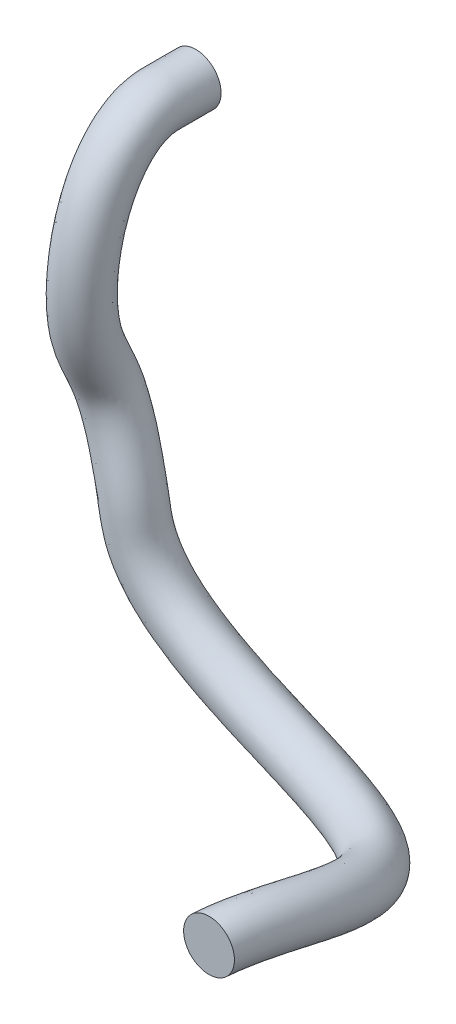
ISO-10303-21;
HEADER;
FILE_DESCRIPTION(('STEP AP214'),'2;1');
FILE_NAME('part.step','',(''),(''),'','','');
FILE_SCHEMA(('AUTOMOTIVE_DESIGN { 1 0 10303 214 1 1 1 1 }'));
ENDSEC;
DATA;
#1=APPLICATION_CONTEXT('core data for automotive mechanical design processes');
#2=APPLICATION_PROTOCOL_DEFINITION('international standard','automotive_design',2000,#1);
#3=PRODUCT_CONTEXT('',#1,'mechanical');
#4=PRODUCT('Part','Part','',(#3));
#5=PRODUCT_RELATED_PRODUCT_CATEGORY('part','',(#4));
#6=PRODUCT_DEFINITION_FORMATION('','',#4);
#7=PRODUCT_DEFINITION_CONTEXT('part definition',#1,'design');
#8=PRODUCT_DEFINITION('design','',#6,#7);
#9=PRODUCT_DEFINITION_SHAPE('','',#8);
#10=(LENGTH_UNIT() NAMED_UNIT(*) SI_UNIT(.MILLI.,.METRE.));
#11=(NAMED_UNIT(*) PLANE_ANGLE_UNIT() SI_UNIT($,.RADIAN.));
#12=(NAMED_UNIT(*) SI_UNIT($,.STERADIAN.) SOLID_ANGLE_UNIT());
#13=UNCERTAINTY_MEASURE_WITH_UNIT(LENGTH_MEASURE(1.E-05),#10,'distance_accuracy_value','');
#14=(GEOMETRIC_REPRESENTATION_CONTEXT(3) GLOBAL_UNCERTAINTY_ASSIGNED_CONTEXT((#13)) GLOBAL_UNIT_ASSIGNED_CONTEXT((#10,
#11,#12)) REPRESENTATION_CONTEXT('',''));
#15=CARTESIAN_POINT('',(0.,0.,0.));
#16=DIRECTION('',(0.,0.,1.));
#17=DIRECTION('',(1.,0.,0.));
#18=AXIS2_PLACEMENT_3D('',#15,#16,#17);
#19=CARTESIAN_POINT('',(3.21,-25.6699893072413,329.980793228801));
#20=CARTESIAN_POINT('',(3.20993277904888,-25.6786941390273,337.770818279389));
#21=CARTESIAN_POINT('',(3.20986602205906,-25.6873388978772,345.724113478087));
#22=CARTESIAN_POINT('',(3.21001154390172,-25.6684944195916,354.196050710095));
#23=CARTESIAN_POINT('',(3.20535832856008,-25.673422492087,354.346789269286));
#24=CARTESIAN_POINT('',(3.1992482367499,-25.7036761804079,355.02079871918));
#25=CARTESIAN_POINT('',(3.19606911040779,-25.7277589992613,355.352439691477));
#26=CARTESIAN_POINT('',(3.18616004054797,-25.8257011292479,356.332395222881));
#27=CARTESIAN_POINT('',(3.17906414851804,-25.9250288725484,356.965427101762));
#28=CARTESIAN_POINT('',(3.15616289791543,-26.3205307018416,358.827026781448));
#29=CARTESIAN_POINT('',(3.13872611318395,-26.7131210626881,360.025616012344));
#30=CARTESIAN_POINT('',(3.07689169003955,-28.3435832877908,363.665509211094));
#31=CARTESIAN_POINT('',(3.02289458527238,-30.0602264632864,366.176266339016));
#32=CARTESIAN_POINT('',(2.79330836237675,-37.5832836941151,373.813349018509));
#33=CARTESIAN_POINT('',(2.54425587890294,-45.8517136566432,378.830776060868));
#34=CARTESIAN_POINT('',(1.78628164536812,-65.8986338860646,386.047942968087));
#35=CARTESIAN_POINT('',(1.27819451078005,-77.5748306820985,388.301705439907));
#36=CARTESIAN_POINT('',(0.106854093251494,-100.267831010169,389.386424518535));
#37=CARTESIAN_POINT('',(-0.553157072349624,-111.291147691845,388.185445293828));
#38=CARTESIAN_POINT('',(-1.82958490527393,-127.994584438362,383.10246544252));
#39=CARTESIAN_POINT('',(-2.5627483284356,-136.083881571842,378.535527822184));
#40=CARTESIAN_POINT('',(-1.55066709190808,-151.52086739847,372.21275107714));
#41=CARTESIAN_POINT('',(-0.667729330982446,-157.518192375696,370.327748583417));
#42=CARTESIAN_POINT('',(1.97531709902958,-168.911949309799,368.28420952));
#43=CARTESIAN_POINT('',(3.6548023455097,-174.435629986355,367.916027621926));
#44=CARTESIAN_POINT('',(8.97696662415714,-190.471677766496,367.811249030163));
#45=CARTESIAN_POINT('',(12.8979884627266,-200.55443307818,369.028116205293));
#46=CARTESIAN_POINT('',(16.5201164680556,-212.411777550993,370.025679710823));
#47=CARTESIAN_POINT('',(17.1815504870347,-214.741991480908,370.202462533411));
#48=CARTESIAN_POINT('',(18.345513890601,-219.30466708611,370.470745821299));
#49=CARTESIAN_POINT('',(18.8314237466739,-221.519048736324,370.557625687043));
#50=CARTESIAN_POINT('',(20.185000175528,-228.301007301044,370.688651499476));
#51=CARTESIAN_POINT('',(20.9269227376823,-232.926724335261,370.610969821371));
#52=CARTESIAN_POINT('',(25.0960451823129,-245.646421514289,370.280943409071));
#53=CARTESIAN_POINT('',(29.6590147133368,-253.105807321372,369.944628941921));
#54=CARTESIAN_POINT('',(41.5910209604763,-266.551550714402,369.328798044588));
#55=CARTESIAN_POINT('',(49.0066926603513,-272.519375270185,369.048276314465));
#56=CARTESIAN_POINT('',(65.9233548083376,-282.786479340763,368.949278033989));
#57=CARTESIAN_POINT('',(75.4283190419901,-287.076726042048,369.133535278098));
#58=CARTESIAN_POINT('',(90.5396461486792,-292.26941108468,370.146803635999));
#59=CARTESIAN_POINT('',(95.7260888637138,-293.771753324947,370.623583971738));
#60=CARTESIAN_POINT('',(106.210062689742,-296.515370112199,371.811920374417));
#61=CARTESIAN_POINT('',(111.355393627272,-298.22840339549,372.196804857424));
#62=CARTESIAN_POINT('',(137.383842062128,-306.510931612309,374.267393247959));
#63=CARTESIAN_POINT('',(159.294182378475,-310.810961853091,377.526366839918));
#64=CARTESIAN_POINT('',(189.280063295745,-313.743506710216,386.962719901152));
#65=CARTESIAN_POINT('',(198.81011586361,-314.135603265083,390.872898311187));
#66=CARTESIAN_POINT('',(216.165136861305,-313.667673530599,400.82393354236));
#67=CARTESIAN_POINT('',(224.006764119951,-312.803278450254,406.879748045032));
#68=CARTESIAN_POINT('',(238.945917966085,-309.103187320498,424.457328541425));
#69=CARTESIAN_POINT('',(244.162862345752,-305.835128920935,436.451431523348));
#70=CARTESIAN_POINT('',(250.13486418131,-299.079617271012,461.942656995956));
#71=CARTESIAN_POINT('',(250.957566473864,-295.565399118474,475.518764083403));
#72=CARTESIAN_POINT('',(250.150658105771,-286.885460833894,517.349363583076));
#73=CARTESIAN_POINT('',(245.192540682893,-283.471071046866,546.83858283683));
#74=CARTESIAN_POINT('',(240.372680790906,-293.882123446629,599.117436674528));
#75=CARTESIAN_POINT('',(240.315254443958,-306.33926232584,620.871735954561));
#76=CARTESIAN_POINT('',(241.031651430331,-322.198583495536,651.508954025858));
#77=CARTESIAN_POINT('',(241.408818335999,-327.043670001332,661.384481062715));
#78=CARTESIAN_POINT('',(242.073366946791,-333.964473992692,680.771920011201));
#79=CARTESIAN_POINT('',(242.360376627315,-336.048988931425,690.23246984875));
#80=CARTESIAN_POINT('',(242.508211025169,-336.079733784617,704.805519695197));
#81=CARTESIAN_POINT('',(242.51218668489,-335.543553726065,710.141151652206));
#82=CARTESIAN_POINT('',(242.480822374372,-334.017047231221,721.411599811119));
#83=CARTESIAN_POINT('',(242.448998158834,-333.061941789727,727.405491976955));
#84=CARTESIAN_POINT('',(242.383867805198,-330.644291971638,745.305952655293));
#85=CARTESIAN_POINT('',(242.359507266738,-329.37324111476,757.193127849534));
#86=CARTESIAN_POINT('',(242.327128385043,-326.317332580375,792.682443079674));
#87=CARTESIAN_POINT('',(242.359638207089,-325.283877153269,816.15377589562));
#88=CARTESIAN_POINT('',(242.489128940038,-323.064874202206,886.214387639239));
#89=CARTESIAN_POINT('',(242.616910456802,-322.741645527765,932.447094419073));
#90=CARTESIAN_POINT('',(242.320091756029,-314.380873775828,1016.36624542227));
#91=CARTESIAN_POINT('',(241.991908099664,-307.724571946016,1054.82630533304));
#92=CARTESIAN_POINT('',(241.727227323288,-300.456562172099,1132.04586594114));
#93=CARTESIAN_POINT('',(241.790455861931,-299.837154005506,1170.89040296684));
#94=CARTESIAN_POINT('',(242.625627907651,-310.655823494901,1217.23637604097));
#95=CARTESIAN_POINT('',(242.797437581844,-312.9725009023,1225.25556168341));
#96=CARTESIAN_POINT('',(242.688172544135,-317.441188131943,1241.25840094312));
#97=CARTESIAN_POINT('',(242.353278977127,-319.531935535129,1249.25762853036));
#98=CARTESIAN_POINT('',(240.477372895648,-324.787599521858,1273.49662593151));
#99=CARTESIAN_POINT('',(238.280560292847,-327.150605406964,1289.8494504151));
#100=CARTESIAN_POINT('',(234.841059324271,-329.739253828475,1321.88034150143));
#101=CARTESIAN_POINT('',(233.608507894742,-329.959785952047,1337.54662091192));
#102=CARTESIAN_POINT('',(234.569270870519,-328.455961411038,1366.97904717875));
#103=CARTESIAN_POINT('',(236.731960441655,-326.749876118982,1380.68354360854));
#104=CARTESIAN_POINT('',(249.260514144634,-320.123012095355,1412.97539361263));
#105=CARTESIAN_POINT('',(264.658344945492,-313.407121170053,1432.05350373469));
#106=CARTESIAN_POINT('',(302.775056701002,-295.087144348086,1467.7946859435));
#107=CARTESIAN_POINT('',(325.265922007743,-283.559940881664,1484.4029502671));
#108=CARTESIAN_POINT('',(351.152394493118,-266.806102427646,1503.86712847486));
#109=CARTESIAN_POINT('',(356.219018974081,-263.337418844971,1507.69848433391));
#110=CARTESIAN_POINT('',(363.532683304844,-257.965131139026,1513.36730342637));
#111=CARTESIAN_POINT('',(365.962758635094,-256.187900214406,1515.23628890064));
#112=CARTESIAN_POINT('',(370.487589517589,-252.346564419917,1518.99326064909));
#113=CARTESIAN_POINT('',(372.533582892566,-250.236130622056,1520.88898740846));
#114=CARTESIAN_POINT('',(382.120199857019,-239.414053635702,1530.38190393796));
#115=CARTESIAN_POINT('',(388.984127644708,-230.9889900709,1537.71787980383));
#116=CARTESIAN_POINT('',(399.447926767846,-213.881803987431,1551.88434280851));
#117=CARTESIAN_POINT('',(403.049412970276,-205.229074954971,1558.73076964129));
#118=CARTESIAN_POINT('',(405.570767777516,-187.588293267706,1572.173341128));
#119=CARTESIAN_POINT('',(404.486717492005,-178.61025088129,1578.76746022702));
#120=CARTESIAN_POINT('',(399.110497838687,-166.558954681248,1587.44521158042));
#121=CARTESIAN_POINT('',(397.518144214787,-163.565670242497,1589.58600969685));
#122=CARTESIAN_POINT('',(395.676234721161,-160.596441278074,1591.69662508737));
#123=CARTESIAN_POINT('',(7.72603943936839,-25.669989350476,329.980832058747));
#124=CARTESIAN_POINT('',(7.72597221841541,-25.678694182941,337.770857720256));
#125=CARTESIAN_POINT('',(7.72590546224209,-25.6873388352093,345.724112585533));
#126=CARTESIAN_POINT('',(7.72605098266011,-25.6684945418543,354.195966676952));
#127=CARTESIAN_POINT('',(7.72139762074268,-25.6746376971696,354.347705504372));
#128=CARTESIAN_POINT('',(7.7152864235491,-25.7064832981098,355.022901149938));
#129=CARTESIAN_POINT('',(7.71210640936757,-25.731391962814,355.355117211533));
#130=CARTESIAN_POINT('',(7.70219361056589,-25.8318966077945,356.33672704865));
#131=CARTESIAN_POINT('',(7.69509381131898,-25.9330454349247,356.970766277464));
#132=CARTESIAN_POINT('',(7.67217624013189,-26.3343168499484,358.834997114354));
#133=CARTESIAN_POINT('',(7.65472245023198,-26.7311775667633,360.034822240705));
#134=CARTESIAN_POINT('',(7.59281539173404,-28.3754636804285,363.676230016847));
#135=CARTESIAN_POINT('',(7.53874345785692,-30.1026247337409,366.18500631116));
#136=CARTESIAN_POINT('',(7.30878240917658,-37.6583929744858,373.804617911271));
#137=CARTESIAN_POINT('',(7.05931858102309,-45.9503619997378,378.794414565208));
#138=CARTESIAN_POINT('',(6.2988086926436,-66.0363733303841,385.925581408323));
#139=CARTESIAN_POINT('',(5.78838557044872,-77.7273850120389,388.120895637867));
#140=CARTESIAN_POINT('',(4.6107523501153,-100.432134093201,389.093690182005));
#141=CARTESIAN_POINT('',(3.94704493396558,-111.452545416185,387.841807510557));
#142=CARTESIAN_POINT('',(2.66511483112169,-128.144494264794,382.688947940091));
#143=CARTESIAN_POINT('',(1.96013285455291,-136.091547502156,378.221508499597));
#144=CARTESIAN_POINT('',(2.93565578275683,-150.973140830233,372.125331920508));
#145=CARTESIAN_POINT('',(3.77759680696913,-156.696877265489,370.324596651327));
#146=CARTESIAN_POINT('',(6.33060117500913,-167.702569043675,368.350488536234));
#147=CARTESIAN_POINT('',(7.96687666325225,-173.09299526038,367.986459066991));
#148=CARTESIAN_POINT('',(13.2099675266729,-188.890805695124,367.883111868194));
#149=CARTESIAN_POINT('',(17.1471510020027,-199.009164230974,369.094554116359));
#150=CARTESIAN_POINT('',(20.8531183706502,-211.140944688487,370.115153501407));
#151=CARTESIAN_POINT('',(21.534083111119,-213.538573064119,370.297048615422));
#152=CARTESIAN_POINT('',(22.7396284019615,-218.264169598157,370.574790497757));
#153=CARTESIAN_POINT('',(23.2496333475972,-220.589402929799,370.665575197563));
#154=CARTESIAN_POINT('',(24.6285849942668,-227.498158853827,370.798349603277));
#155=CARTESIAN_POINT('',(25.3595773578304,-231.996927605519,370.706744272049));
#156=CARTESIAN_POINT('',(29.2430266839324,-243.756631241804,370.510830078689));
#157=CARTESIAN_POINT('',(33.4981993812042,-250.700828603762,370.305647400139));
#158=CARTESIAN_POINT('',(44.8012755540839,-263.401957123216,369.982955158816));
#159=CARTESIAN_POINT('',(51.8978979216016,-269.126987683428,369.876129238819));
#160=CARTESIAN_POINT('',(68.2220021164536,-279.08795190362,370.210157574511));
#161=CARTESIAN_POINT('',(77.4485979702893,-283.313380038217,370.657186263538));
#162=CARTESIAN_POINT('',(92.1388270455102,-288.53252558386,372.125621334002));
#163=CARTESIAN_POINT('',(97.1823099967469,-290.068649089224,372.770253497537));
#164=CARTESIAN_POINT('',(107.381519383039,-292.907569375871,374.272248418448));
#165=CARTESIAN_POINT('',(112.420681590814,-294.604075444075,374.673656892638));
#166=CARTESIAN_POINT('',(137.956030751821,-302.729523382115,376.704721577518));
#167=CARTESIAN_POINT('',(159.478300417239,-306.946923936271,379.91618932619));
#168=CARTESIAN_POINT('',(188.708643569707,-309.805445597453,389.114486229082));
#169=CARTESIAN_POINT('',(197.955109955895,-310.182543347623,392.915287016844));
#170=CARTESIAN_POINT('',(214.674171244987,-309.731705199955,402.501504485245));
#171=CARTESIAN_POINT('',(222.158002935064,-308.901429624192,408.294953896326));
#172=CARTESIAN_POINT('',(236.344218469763,-305.387824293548,424.986618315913));
#173=CARTESIAN_POINT('',(241.390971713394,-302.255637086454,436.49249192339));
#174=CARTESIAN_POINT('',(247.221640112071,-295.6602892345,461.377726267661));
#175=CARTESIAN_POINT('',(248.053564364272,-292.181613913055,474.802456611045));
#176=CARTESIAN_POINT('',(247.249834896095,-283.526237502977,516.511321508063));
#177=CARTESIAN_POINT('',(242.248573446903,-279.962588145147,546.323688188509));
#178=CARTESIAN_POINT('',(237.267986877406,-290.720815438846,600.34587314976));
#179=CARTESIAN_POINT('',(237.232120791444,-303.452822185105,622.471185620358));
#180=CARTESIAN_POINT('',(237.94779927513,-319.291559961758,653.069050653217));
#181=CARTESIAN_POINT('',(238.321263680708,-324.07120553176,662.832236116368));
#182=CARTESIAN_POINT('',(238.968824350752,-330.814248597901,681.721882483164));
#183=CARTESIAN_POINT('',(239.242309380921,-332.788352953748,690.777491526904));
#184=CARTESIAN_POINT('',(239.38239815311,-332.817486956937,704.587001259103));
#185=CARTESIAN_POINT('',(239.386951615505,-332.30434092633,709.766660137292));
#186=CARTESIAN_POINT('',(239.355992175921,-330.797233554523,720.893841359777));
#187=CARTESIAN_POINT('',(239.324063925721,-329.836853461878,726.92674764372));
#188=CARTESIAN_POINT('',(239.258592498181,-327.406553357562,744.920874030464));
#189=CARTESIAN_POINT('',(239.234128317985,-326.129767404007,756.863356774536));
#190=CARTESIAN_POINT('',(239.201619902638,-323.061645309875,792.49451369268));
#191=CARTESIAN_POINT('',(239.234260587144,-322.026321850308,816.028280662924));
#192=CARTESIAN_POINT('',(239.363905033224,-319.804653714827,886.173099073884));
#193=CARTESIAN_POINT('',(239.491115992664,-319.477801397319,932.322249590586));
#194=CARTESIAN_POINT('',(239.195635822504,-311.154733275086,1015.86295986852));
#195=CARTESIAN_POINT('',(238.867393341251,-304.496953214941,1054.32851079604));
#196=CARTESIAN_POINT('',(238.601467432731,-297.194742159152,1131.91144178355));
#197=CARTESIAN_POINT('',(238.66347094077,-296.540853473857,1171.14216940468));
#198=CARTESIAN_POINT('',(239.510555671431,-307.513839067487,1218.14921501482));
#199=CARTESIAN_POINT('',(239.681519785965,-309.838383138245,1226.18754269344));
#200=CARTESIAN_POINT('',(239.573047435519,-314.266931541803,1242.04600308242));
#201=CARTESIAN_POINT('',(239.244994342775,-316.30799450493,1249.85588363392));
#202=CARTESIAN_POINT('',(237.399772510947,-321.477468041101,1273.69693072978));
#203=CARTESIAN_POINT('',(235.227124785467,-323.822219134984,1289.88110264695));
#204=CARTESIAN_POINT('',(231.806372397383,-326.396794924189,1321.73450197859));
#205=CARTESIAN_POINT('',(230.568216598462,-326.622964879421,1337.39269091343));
#206=CARTESIAN_POINT('',(231.534237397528,-325.11083206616,1366.99009105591));
#207=CARTESIAN_POINT('',(233.710226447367,-323.38901771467,1380.8782275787));
#208=CARTESIAN_POINT('',(246.479123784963,-316.635026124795,1413.78955378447));
#209=CARTESIAN_POINT('',(262.027893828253,-309.854428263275,1432.97826517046));
#210=CARTESIAN_POINT('',(300.197489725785,-291.508982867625,1468.76884844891));
#211=CARTESIAN_POINT('',(322.622218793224,-280.006738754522,1485.31961442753));
#212=CARTESIAN_POINT('',(348.29122690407,-263.393624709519,1504.62017736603));
#213=CARTESIAN_POINT('',(353.307383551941,-259.959094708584,1508.41341513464));
#214=CARTESIAN_POINT('',(360.534017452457,-254.650725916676,1514.01471017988));
#215=CARTESIAN_POINT('',(362.937948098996,-252.890066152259,1515.84668938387));
#216=CARTESIAN_POINT('',(367.380311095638,-249.124900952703,1519.59615561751));
#217=CARTESIAN_POINT('',(369.364649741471,-247.082150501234,1521.53616688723));
#218=CARTESIAN_POINT('',(378.624409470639,-236.667276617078,1531.30526163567));
#219=CARTESIAN_POINT('',(385.272389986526,-228.559376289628,1538.67444784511));
#220=CARTESIAN_POINT('',(395.300158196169,-212.214401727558,1552.66589739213));
#221=CARTESIAN_POINT('',(398.683603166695,-204.022026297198,1559.29043741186));
#222=CARTESIAN_POINT('',(401.007853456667,-187.521458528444,1572.09694913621));
#223=CARTESIAN_POINT('',(399.981475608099,-179.218860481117,1578.28090691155));
#224=CARTESIAN_POINT('',(394.908228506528,-167.939446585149,1586.50544475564));
#225=CARTESIAN_POINT('',(393.396590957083,-165.10640069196,1588.53986178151));
#226=CARTESIAN_POINT('',(391.64200287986,-162.279784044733,1590.54971384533));
#227=CARTESIAN_POINT('',(12.2142698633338,-23.8109046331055,329.982940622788));
#228=CARTESIAN_POINT('',(12.2142026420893,-23.8196095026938,337.772999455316));
#229=CARTESIAN_POINT('',(12.2141359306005,-23.8282483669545,345.72406412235));
#230=CARTESIAN_POINT('',(12.2142813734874,-23.8094141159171,354.191403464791));
#231=CARTESIAN_POINT('',(12.2101226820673,-23.8171158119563,354.39825870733));
#232=CARTESIAN_POINT('',(12.20461926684,-23.8535718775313,355.142089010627));
#233=CARTESIAN_POINT('',(12.2017408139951,-23.881748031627,355.508794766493));
#234=CARTESIAN_POINT('',(12.1927234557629,-23.9949616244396,356.59370849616));
#235=CARTESIAN_POINT('',(12.1862076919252,-24.1084768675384,357.296343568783));
#236=CARTESIAN_POINT('',(12.1650062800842,-24.5576286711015,359.361531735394));
#237=CARTESIAN_POINT('',(12.1486499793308,-25.0010054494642,360.689057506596));
#238=CARTESIAN_POINT('',(12.0900916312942,-26.8136151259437,364.676986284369));
#239=CARTESIAN_POINT('',(12.0383390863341,-28.6883371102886,367.364335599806));
#240=CARTESIAN_POINT('',(11.8177033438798,-36.6734151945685,375.369151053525));
#241=CARTESIAN_POINT('',(11.578283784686,-45.224367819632,380.437487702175));
#242=CARTESIAN_POINT('',(10.8462368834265,-65.7414058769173,387.623136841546));
#243=CARTESIAN_POINT('',(10.3539321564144,-77.6147525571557,389.788493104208));
#244=CARTESIAN_POINT('',(9.2045031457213,-100.692744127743,390.664460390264));
#245=CARTESIAN_POINT('',(8.55077486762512,-111.903782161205,389.351622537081));
#246=CARTESIAN_POINT('',(7.26206532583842,-129.084920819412,383.974252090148));
#247=CARTESIAN_POINT('',(6.58431942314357,-136.96219554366,379.56083908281));
#248=CARTESIAN_POINT('',(7.50742629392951,-151.042104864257,373.792125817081));
#249=CARTESIAN_POINT('',(8.28444273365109,-156.322240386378,372.12999200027));
#250=CARTESIAN_POINT('',(10.6891127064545,-166.688333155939,370.270428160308));
#251=CARTESIAN_POINT('',(12.2516611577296,-171.849127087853,369.914817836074));
#252=CARTESIAN_POINT('',(17.3461547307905,-187.199076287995,369.814273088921));
#253=CARTESIAN_POINT('',(21.2832729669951,-197.309058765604,371.010655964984));
#254=CARTESIAN_POINT('',(25.08481429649,-209.753613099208,372.057517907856));
#255=CARTESIAN_POINT('',(25.7891560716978,-212.23140845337,372.245568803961));
#256=CARTESIAN_POINT('',(27.0456945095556,-217.156600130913,372.534928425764));
#257=CARTESIAN_POINT('',(27.5856050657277,-219.618672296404,372.630665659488));
#258=CARTESIAN_POINT('',(29.0026898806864,-226.716545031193,372.766405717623));
#259=CARTESIAN_POINT('',(29.73256088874,-231.115868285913,372.660367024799));
#260=CARTESIAN_POINT('',(33.3016580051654,-241.97616789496,372.595197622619));
#261=CARTESIAN_POINT('',(37.2241132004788,-248.45008323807,372.516995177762));
#262=CARTESIAN_POINT('',(47.8469395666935,-260.509469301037,372.472090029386));
#263=CARTESIAN_POINT('',(54.593621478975,-266.051814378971,372.52776874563));
#264=CARTESIAN_POINT('',(70.2511708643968,-275.864182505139,373.25064988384));
#265=CARTESIAN_POINT('',(79.1561017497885,-280.123474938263,373.927137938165));
#266=CARTESIAN_POINT('',(93.362298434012,-285.547657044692,375.764288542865));
#267=CARTESIAN_POINT('',(98.2414343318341,-287.184462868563,376.540091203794));
#268=CARTESIAN_POINT('',(108.121479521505,-290.246754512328,378.275306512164));
#269=CARTESIAN_POINT('',(113.057644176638,-291.937537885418,378.685484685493));
#270=CARTESIAN_POINT('',(138.106418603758,-299.90786202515,380.677619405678));
#271=CARTESIAN_POINT('',(159.203549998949,-304.029059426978,383.843418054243));
#272=CARTESIAN_POINT('',(187.519395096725,-306.797910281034,392.753698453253));
#273=CARTESIAN_POINT('',(196.410495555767,-307.155480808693,396.418969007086));
#274=CARTESIAN_POINT('',(212.308095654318,-306.726684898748,405.534039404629));
#275=CARTESIAN_POINT('',(219.31782912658,-305.940638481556,410.982504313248));
#276=CARTESIAN_POINT('',(232.488935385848,-302.678452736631,426.479779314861));
#277=CARTESIAN_POINT('',(237.288178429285,-299.735808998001,437.30179413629));
#278=CARTESIAN_POINT('',(242.904209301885,-293.383151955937,461.268852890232));
#279=CARTESIAN_POINT('',(243.74173792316,-289.971762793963,474.416923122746));
#280=CARTESIAN_POINT('',(242.947258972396,-281.408856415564,515.675258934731));
#281=CARTESIAN_POINT('',(237.935246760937,-277.71737981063,545.641140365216));
#282=CARTESIAN_POINT('',(232.829786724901,-288.745337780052,601.017772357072));
#283=CARTESIAN_POINT('',(232.809176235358,-301.699002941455,623.452408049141));
#284=CARTESIAN_POINT('',(233.525804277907,-317.555804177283,654.085761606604));
#285=CARTESIAN_POINT('',(233.897439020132,-322.299433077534,663.790275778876));
#286=CARTESIAN_POINT('',(234.534475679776,-328.932313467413,682.371585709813));
#287=CARTESIAN_POINT('',(234.799074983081,-330.833244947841,691.164107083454));
#288=CARTESIAN_POINT('',(234.934003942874,-330.861305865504,704.464978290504));
#289=CARTESIAN_POINT('',(234.938940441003,-330.363511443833,709.540482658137));
#290=CARTESIAN_POINT('',(234.908252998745,-328.869453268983,720.571260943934));
#291=CARTESIAN_POINT('',(234.876259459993,-327.905686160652,726.629342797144));
#292=CARTESIAN_POINT('',(234.810569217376,-325.467270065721,744.683563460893));
#293=CARTESIAN_POINT('',(234.786038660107,-324.186808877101,756.661499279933));
#294=CARTESIAN_POINT('',(234.753447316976,-321.110867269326,792.383468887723));
#295=CARTESIAN_POINT('',(234.786171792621,-320.074360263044,815.957036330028));
#296=CARTESIAN_POINT('',(234.915912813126,-317.851020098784,886.154729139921));
#297=CARTESIAN_POINT('',(235.042753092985,-317.52183948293,932.248980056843));
#298=CARTESIAN_POINT('',(234.748142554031,-309.223267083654,1015.54382065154));
#299=CARTESIAN_POINT('',(234.419863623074,-302.564562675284,1054.01273720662));
#300=CARTESIAN_POINT('',(234.153131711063,-295.240212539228,1131.83088112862));
#301=CARTESIAN_POINT('',(234.214340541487,-294.563969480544,1171.3118086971));
#302=CARTESIAN_POINT('',(235.069145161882,-305.636958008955,1218.74725510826));
#303=CARTESIAN_POINT('',(235.238858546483,-307.961030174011,1226.77668111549));
#304=CARTESIAN_POINT('',(235.131469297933,-312.3406208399,1242.45890482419));
#305=CARTESIAN_POINT('',(234.810743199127,-314.331503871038,1250.07641610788));
#306=CARTESIAN_POINT('',(232.995228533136,-319.417685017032,1273.53267501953));
#307=CARTESIAN_POINT('',(230.841719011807,-321.752525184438,1289.58933329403));
#308=CARTESIAN_POINT('',(227.423240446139,-324.32564647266,1321.41978847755));
#309=CARTESIAN_POINT('',(226.166940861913,-324.562270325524,1337.18456134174));
#310=CARTESIAN_POINT('',(227.148930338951,-323.025207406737,1367.27339276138));
#311=CARTESIAN_POINT('',(229.36479881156,-321.264234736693,1381.56378943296));
#312=CARTESIAN_POINT('',(242.604681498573,-314.261119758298,1415.68906170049));
#313=CARTESIAN_POINT('',(258.484190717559,-307.338177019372,1435.15794993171));
#314=CARTESIAN_POINT('',(296.929051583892,-288.86030498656,1471.20651030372));
#315=CARTESIAN_POINT('',(319.354341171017,-277.34562513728,1487.74421392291));
#316=CARTESIAN_POINT('',(344.848517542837,-260.845597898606,1506.91324313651));
#317=CARTESIAN_POINT('',(349.820623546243,-257.440718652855,1510.67325227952));
#318=CARTESIAN_POINT('',(356.966761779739,-252.19143821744,1516.21210519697));
#319=CARTESIAN_POINT('',(359.341881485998,-250.441603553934,1518.00929285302));
#320=CARTESIAN_POINT('',(363.719281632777,-246.766560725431,1521.74989947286));
#321=CARTESIAN_POINT('',(365.667424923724,-244.816134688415,1523.72970117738));
#322=CARTESIAN_POINT('',(374.757985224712,-234.947825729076,1533.74295066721));
#323=CARTESIAN_POINT('',(381.277575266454,-227.203535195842,1541.12416320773));
#324=CARTESIAN_POINT('',(391.00852224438,-211.673641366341,1554.92142264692));
#325=CARTESIAN_POINT('',(394.225560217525,-203.94482757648,1561.32443221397));
#326=CARTESIAN_POINT('',(396.433488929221,-188.569774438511,1573.50885010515));
#327=CARTESIAN_POINT('',(395.492784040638,-180.92404053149,1579.29608542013));
#328=CARTESIAN_POINT('',(390.747600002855,-170.389667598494,1587.08588203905));
#329=CARTESIAN_POINT('',(389.317279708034,-167.712207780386,1589.0171795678));
#330=CARTESIAN_POINT('',(387.648018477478,-165.024551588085,1590.92885873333));
#331=CARTESIAN_POINT('',(18.6009140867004,-17.4242644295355,329.990106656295));
#332=CARTESIAN_POINT('',(18.6008468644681,-17.4329694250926,337.780278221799));
#333=CARTESIAN_POINT('',(18.6007803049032,-17.4415886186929,345.72389941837));
#334=CARTESIAN_POINT('',(18.6009254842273,-17.4227884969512,354.175895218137));
#335=CARTESIAN_POINT('',(18.5984664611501,-17.4334141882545,354.570095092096));
#336=CARTESIAN_POINT('',(18.5950532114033,-17.4825250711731,355.547338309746));
#337=CARTESIAN_POINT('',(18.5932125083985,-17.520274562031,356.031378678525));
#338=CARTESIAN_POINT('',(18.5872787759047,-17.6720230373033,357.467870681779));
#339=CARTESIAN_POINT('',(18.5827772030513,-17.8243793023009,358.404143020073));
#340=CARTESIAN_POINT('',(18.5675040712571,-18.426478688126,361.154431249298));
#341=CARTESIAN_POINT('',(18.5549520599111,-19.0211145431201,362.918183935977));
#342=CARTESIAN_POINT('',(18.5080430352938,-21.3843298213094,368.093510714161));
#343=CARTESIAN_POINT('',(18.4644081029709,-23.7449421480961,371.39828573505));
#344=CARTESIAN_POINT('',(18.2765578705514,-33.1394355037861,380.761360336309));
#345=CARTESIAN_POINT('',(18.0724667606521,-42.53301397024,386.154771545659));
#346=CARTESIAN_POINT('',(17.443272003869,-64.4526052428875,393.699587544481));
#347=CARTESIAN_POINT('',(17.0178826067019,-76.922709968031,395.878923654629));
#348=CARTESIAN_POINT('',(15.9779310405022,-101.259429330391,396.646102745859));
#349=CARTESIAN_POINT('',(15.3658772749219,-113.131150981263,395.22566830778));
#350=CARTESIAN_POINT('',(14.0648824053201,-132.015812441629,389.216779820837));
#351=CARTESIAN_POINT('',(13.4243395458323,-139.937860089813,384.789971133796));
#352=CARTESIAN_POINT('',(14.2404945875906,-152.3744748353,379.69301451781));
#353=CARTESIAN_POINT('',(14.8764646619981,-156.677855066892,378.338493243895));
#354=CARTESIAN_POINT('',(16.9516355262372,-165.622820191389,376.733569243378));
#355=CARTESIAN_POINT('',(18.347323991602,-170.261251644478,376.398576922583));
#356=CARTESIAN_POINT('',(23.0894780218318,-184.549107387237,376.304796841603));
#357=CARTESIAN_POINT('',(26.9940488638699,-194.559108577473,377.460295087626));
#358=CARTESIAN_POINT('',(30.9562431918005,-207.52928429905,378.551306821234));
#359=CARTESIAN_POINT('',(31.7018322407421,-210.147653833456,378.750280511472));
#360=CARTESIAN_POINT('',(33.0503871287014,-215.432686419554,379.060634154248));
#361=CARTESIAN_POINT('',(33.6448442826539,-218.143146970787,379.165575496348));
#362=CARTESIAN_POINT('',(35.1421801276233,-225.637110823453,379.308006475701));
#363=CARTESIAN_POINT('',(35.8900592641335,-229.948698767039,379.180231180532));
#364=CARTESIAN_POINT('',(38.9505871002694,-239.639201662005,379.295993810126));
#365=CARTESIAN_POINT('',(42.3456289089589,-245.527902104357,379.391751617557));
#366=CARTESIAN_POINT('',(51.8894070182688,-256.87189642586,379.714870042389));
#367=CARTESIAN_POINT('',(58.0720133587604,-262.272237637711,379.98142036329));
#368=CARTESIAN_POINT('',(72.6248175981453,-272.186403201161,381.174100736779));
#369=CARTESIAN_POINT('',(80.9814477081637,-276.691669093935,382.113323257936));
#370=CARTESIAN_POINT('',(94.3670110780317,-282.767306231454,384.30681398));
#371=CARTESIAN_POINT('',(98.9674738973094,-284.682430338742,385.197531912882));
#372=CARTESIAN_POINT('',(108.320601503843,-288.321477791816,387.106628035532));
#373=CARTESIAN_POINT('',(113.115269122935,-290.02565603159,387.51388537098));
#374=CARTESIAN_POINT('',(137.478678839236,-297.777233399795,389.45132874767));
#375=CARTESIAN_POINT('',(157.891445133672,-301.73319694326,392.555248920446));
#376=CARTESIAN_POINT('',(184.576728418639,-304.342041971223,400.952198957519));
#377=CARTESIAN_POINT('',(192.814188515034,-304.662526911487,404.370628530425));
#378=CARTESIAN_POINT('',(207.161686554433,-304.275271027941,412.596770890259));
#379=CARTESIAN_POINT('',(213.258309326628,-303.572929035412,417.384817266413));
#380=CARTESIAN_POINT('',(224.44801830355,-300.801490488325,430.550757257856));
#381=CARTESIAN_POINT('',(228.737355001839,-298.238255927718,439.999924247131));
#382=CARTESIAN_POINT('',(233.898693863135,-292.399003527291,462.024694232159));
#383=CARTESIAN_POINT('',(234.737031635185,-289.147681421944,474.525088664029));
#384=CARTESIAN_POINT('',(233.96797381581,-280.853319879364,514.479160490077));
#385=CARTESIAN_POINT('',(229.005316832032,-277.021228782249,544.326126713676));
#386=CARTESIAN_POINT('',(223.792323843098,-288.281461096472,600.869120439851));
#387=CARTESIAN_POINT('',(223.78100142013,-301.446868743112,623.62436883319));
#388=CARTESIAN_POINT('',(224.502328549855,-317.406891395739,654.458344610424));
#389=CARTESIAN_POINT('',(224.875082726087,-322.157671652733,664.185984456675));
#390=CARTESIAN_POINT('',(225.509941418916,-328.767624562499,682.703630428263));
#391=CARTESIAN_POINT('',(225.77106428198,-330.638001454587,691.402230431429));
#392=CARTESIAN_POINT('',(225.90375863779,-330.665597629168,704.482821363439));
#393=CARTESIAN_POINT('',(225.908855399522,-330.174473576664,709.512462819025));
#394=CARTESIAN_POINT('',(225.878292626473,-328.686445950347,720.498595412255));
#395=CARTESIAN_POINT('',(225.846282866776,-327.721592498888,726.565136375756));
#396=CARTESIAN_POINT('',(225.780523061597,-325.280595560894,744.638471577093));
#397=CARTESIAN_POINT('',(225.755971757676,-323.998978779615,756.627586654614));
#398=CARTESIAN_POINT('',(225.723354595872,-320.920601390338,792.377847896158));
#399=CARTESIAN_POINT('',(225.75610519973,-319.883764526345,815.963276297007));
#400=CARTESIAN_POINT('',(225.885870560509,-317.660010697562,886.174198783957));
#401=CARTESIAN_POINT('',(226.012578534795,-317.330078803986,932.246961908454));
#402=CARTESIAN_POINT('',(225.718278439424,-309.040250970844,1015.4540311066));
#403=CARTESIAN_POINT('',(225.389991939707,-302.381327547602,1053.92352780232));
#404=CARTESIAN_POINT('',(225.12298137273,-295.049324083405,1131.82297394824));
#405=CARTESIAN_POINT('',(225.183910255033,-294.365246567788,1171.39104920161));
#406=CARTESIAN_POINT('',(226.041410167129,-305.473149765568,1218.97606495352));
#407=CARTESIAN_POINT('',(226.208517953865,-307.779867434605,1226.9366263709));
#408=CARTESIAN_POINT('',(226.103264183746,-312.071547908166,1242.30216996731));
#409=CARTESIAN_POINT('',(225.794028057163,-313.989413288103,1249.63751609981));
#410=CARTESIAN_POINT('',(224.019199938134,-318.96183532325,1272.56778661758));
#411=CARTESIAN_POINT('',(221.883107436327,-321.299137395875,1288.52369374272));
#412=CARTESIAN_POINT('',(218.434943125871,-323.895407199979,1320.63031083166));
#413=CARTESIAN_POINT('',(217.127521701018,-324.156668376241,1336.77741968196));
#414=CARTESIAN_POINT('',(218.1538538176,-322.550577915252,1368.22455060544));
#415=CARTESIAN_POINT('',(220.480123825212,-320.686540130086,1383.52957874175));
#416=CARTESIAN_POINT('',(234.857327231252,-313.081849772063,1420.58625002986));
#417=CARTESIAN_POINT('',(251.571168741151,-305.79931386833,1440.79644630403));
#418=CARTESIAN_POINT('',(290.855897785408,-286.917444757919,1477.63245078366));
#419=CARTESIAN_POINT('',(313.415385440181,-275.310124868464,1494.24027706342));
#420=CARTESIAN_POINT('',(338.743879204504,-258.917143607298,1513.28467009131));
#421=CARTESIAN_POINT('',(343.665590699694,-255.545818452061,1517.00676285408));
#422=CARTESIAN_POINT('',(350.709257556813,-250.371690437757,1522.46615217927));
#423=CARTESIAN_POINT('',(353.037690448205,-248.625901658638,1524.2178306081));
#424=CARTESIAN_POINT('',(357.356855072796,-245.108121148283,1527.94301221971));
#425=CARTESIAN_POINT('',(359.303963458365,-243.339496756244,1529.97093969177));
#426=CARTESIAN_POINT('',(368.466975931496,-234.534433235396,1540.27059412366));
#427=CARTESIAN_POINT('',(374.977391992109,-227.404949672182,1547.62670085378));
#428=CARTESIAN_POINT('',(384.560710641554,-213.150735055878,1561.1068727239));
#429=CARTESIAN_POINT('',(387.642161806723,-206.093718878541,1567.19261728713));
#430=CARTESIAN_POINT('',(389.844692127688,-192.304794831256,1578.51203348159));
#431=CARTESIAN_POINT('',(389.082960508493,-185.564742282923,1583.75670379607));
#432=CARTESIAN_POINT('',(384.858848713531,-176.046094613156,1590.959431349));
#433=CARTESIAN_POINT('',(383.546450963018,-173.582653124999,1592.74923763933));
#434=CARTESIAN_POINT('',(381.995676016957,-171.087152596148,1594.52518342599));
#435=CARTESIAN_POINT('',(20.4599999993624,-12.936036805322,329.995119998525));
#436=CARTESIAN_POINT('',(20.4599327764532,-12.9447418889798,337.785370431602));
#437=CARTESIAN_POINT('',(20.459866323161,-12.9533473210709,345.723784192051));
#438=CARTESIAN_POINT('',(20.4600113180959,-12.9345710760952,354.16504568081));
#439=CARTESIAN_POINT('',(20.4587468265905,-12.9465442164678,354.690320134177));
#440=CARTESIAN_POINT('',(20.4568030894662,-13.0036215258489,355.830904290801));
#441=CARTESIAN_POINT('',(20.455692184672,-13.047617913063,356.397067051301));
#442=CARTESIAN_POINT('',(20.4519276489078,-13.2249550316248,358.079668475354));
#443=CARTESIAN_POINT('',(20.4488438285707,-13.403546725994,359.179543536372));
#444=CARTESIAN_POINT('',(20.4377463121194,-14.1097714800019,362.409755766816));
#445=CARTESIAN_POINT('',(20.4278776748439,-14.8082189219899,364.479348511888));
#446=CARTESIAN_POINT('',(20.3891975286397,-17.5503257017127,370.488240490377));
#447=CARTESIAN_POINT('',(20.3513108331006,-20.2462754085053,374.228066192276));
#448=CARTESIAN_POINT('',(20.1867189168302,-30.6121952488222,384.555832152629));
#449=CARTESIAN_POINT('',(20.0076944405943,-40.584227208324,390.19377617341));
#450=CARTESIAN_POINT('',(19.4522554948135,-63.4667082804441,398.041065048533));
#451=CARTESIAN_POINT('',(19.0752509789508,-76.3475613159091,400.264252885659));
#452=CARTESIAN_POINT('',(18.1158985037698,-101.562014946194,401.020140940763));
#453=CARTESIAN_POINT('',(17.5352834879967,-113.899725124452,399.553727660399));
#454=CARTESIAN_POINT('',(16.2288583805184,-133.98822956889,393.141720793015));
#455=CARTESIAN_POINT('',(15.5980534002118,-142.024552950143,388.647572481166));
#456=CARTESIAN_POINT('',(16.3603312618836,-153.629676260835,383.890772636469));
#457=CARTESIAN_POINT('',(16.9210480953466,-157.405916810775,382.703368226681));
#458=CARTESIAN_POINT('',(18.8170832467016,-165.578104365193,381.236971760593));
#459=CARTESIAN_POINT('',(20.1206662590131,-169.927022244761,380.914051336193));
#460=CARTESIAN_POINT('',(24.6612476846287,-183.607185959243,380.824191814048));
#461=CARTESIAN_POINT('',(28.5335367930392,-193.526197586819,381.954116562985));
#462=CARTESIAN_POINT('',(32.5598208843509,-206.705984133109,383.062743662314));
#463=CARTESIAN_POINT('',(33.3230261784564,-209.383895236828,383.266417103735));
#464=CARTESIAN_POINT('',(34.712037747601,-214.826957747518,383.586017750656));
#465=CARTESIAN_POINT('',(35.3307999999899,-217.647438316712,383.695153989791));
#466=CARTESIAN_POINT('',(36.8697595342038,-225.345937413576,383.841269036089));
#467=CARTESIAN_POINT('',(37.6366572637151,-229.669775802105,383.706324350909));
#468=CARTESIAN_POINT('',(40.5060997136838,-239.097089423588,383.871160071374));
#469=CARTESIAN_POINT('',(43.7096933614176,-244.874460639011,384.012826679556));
#470=CARTESIAN_POINT('',(52.8613176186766,-256.149210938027,384.423915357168));
#471=CARTESIAN_POINT('',(58.8332623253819,-261.591108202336,384.737534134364));
#472=CARTESIAN_POINT('',(72.9546790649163,-271.755040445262,386.008267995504));
#473=CARTESIAN_POINT('',(81.0880497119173,-276.470900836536,386.979147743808));
#474=CARTESIAN_POINT('',(94.1420654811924,-282.988944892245,389.158068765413));
#475=CARTESIAN_POINT('',(98.6299182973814,-285.079991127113,390.031823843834));
#476=CARTESIAN_POINT('',(107.778537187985,-289.068871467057,391.880509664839));
#477=CARTESIAN_POINT('',(112.535576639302,-290.792084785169,392.276094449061));
#478=CARTESIAN_POINT('',(136.704416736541,-298.481386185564,394.198113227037));
#479=CARTESIAN_POINT('',(156.862170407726,-302.369336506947,397.286205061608));
#480=CARTESIAN_POINT('',(182.841430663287,-304.908831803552,405.461002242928));
#481=CARTESIAN_POINT('',(190.7846413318,-305.211986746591,408.769641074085));
#482=CARTESIAN_POINT('',(204.413043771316,-304.843972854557,416.583476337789));
#483=CARTESIAN_POINT('',(210.076276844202,-304.180590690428,421.060155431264));
#484=CARTESIAN_POINT('',(220.311898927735,-301.645457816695,433.103505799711));
#485=CARTESIAN_POINT('',(224.341979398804,-299.269752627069,441.872137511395));
#486=CARTESIAN_POINT('',(229.2660636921,-293.698052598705,462.884754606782));
#487=CARTESIAN_POINT('',(230.099601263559,-290.538525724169,475.018121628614));
#488=CARTESIAN_POINT('',(229.346557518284,-282.418585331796,514.126489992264));
#489=CARTESIAN_POINT('',(224.443702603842,-278.574572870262,543.701758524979));
#490=CARTESIAN_POINT('',(219.248712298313,-289.795918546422,600.049484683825));
#491=CARTESIAN_POINT('',(219.231365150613,-302.950106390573,622.814048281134));
#492=CARTESIAN_POINT('',(219.956412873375,-318.994651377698,653.811922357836));
#493=CARTESIAN_POINT('',(220.332109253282,-323.788555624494,663.621216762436));
#494=CARTESIAN_POINT('',(220.975327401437,-330.485884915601,682.383927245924));
#495=CARTESIAN_POINT('',(221.241880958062,-332.39906824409,691.25227190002));
#496=CARTESIAN_POINT('',(221.377514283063,-332.427275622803,704.622577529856));
#497=CARTESIAN_POINT('',(221.382387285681,-331.927429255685,709.710793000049));
#498=CARTESIAN_POINT('',(221.351676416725,-330.432345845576,720.748957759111));
#499=CARTESIAN_POINT('',(221.319715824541,-329.469799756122,726.79873017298));
#500=CARTESIAN_POINT('',(221.25410570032,-327.034353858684,744.830967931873));
#501=CARTESIAN_POINT('',(221.229600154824,-325.755263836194,756.79574035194));
#502=CARTESIAN_POINT('',(221.197040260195,-322.682285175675,792.483306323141));
#503=CARTESIAN_POINT('',(221.229733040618,-321.646304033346,816.040722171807));
#504=CARTESIAN_POINT('',(221.359426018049,-319.423811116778,886.21191847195));
#505=CARTESIAN_POINT('',(221.486373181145,-319.095460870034,932.318225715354));
#506=CARTESIAN_POINT('',(221.191511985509,-310.789828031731,1015.6839336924));
#507=CARTESIAN_POINT('',(220.863254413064,-304.131611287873,1054.15064132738));
#508=CARTESIAN_POINT('',(220.596772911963,-296.814140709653,1131.89567611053));
#509=CARTESIAN_POINT('',(220.65821824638,-296.144631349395,1171.30016246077));
#510=CARTESIAN_POINT('',(221.510676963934,-307.187231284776,1218.60542573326));
#511=CARTESIAN_POINT('',(221.676445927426,-309.477173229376,1226.50644828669));
#512=CARTESIAN_POINT('',(221.57223138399,-313.730442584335,1241.73349851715));
#513=CARTESIAN_POINT('',(221.267087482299,-315.62591987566,1248.98078629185));
#514=CARTESIAN_POINT('',(219.502988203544,-320.568575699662,1271.77309554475));
#515=CARTESIAN_POINT('',(217.365067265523,-322.918235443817,1287.75638557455));
#516=CARTESIAN_POINT('',(213.885126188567,-325.538965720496,1320.16040815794));
#517=CARTESIAN_POINT('',(212.545041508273,-325.814258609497,1336.58091469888));
#518=CARTESIAN_POINT('',(213.599474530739,-324.164495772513,1368.88654967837));
#519=CARTESIAN_POINT('',(215.995586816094,-322.237185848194,1384.79770119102));
#520=CARTESIAN_POINT('',(231.032122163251,-314.28374789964,1423.55377438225));
#521=CARTESIAN_POINT('',(248.244419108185,-306.786178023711,1444.22053699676));
#522=CARTESIAN_POINT('',(288.088579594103,-287.635226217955,1481.58115954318));
#523=CARTESIAN_POINT('',(310.78087842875,-275.948272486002,1498.27173904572));
#524=CARTESIAN_POINT('',(336.119541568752,-259.548591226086,1517.32379709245));
#525=CARTESIAN_POINT('',(341.035219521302,-256.180962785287,1521.04143558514));
#526=CARTESIAN_POINT('',(348.057541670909,-251.022436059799,1526.48429276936));
#527=CARTESIAN_POINT('',(350.368386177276,-249.26984315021,1528.22553375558));
#528=CARTESIAN_POINT('',(354.694636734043,-245.81823419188,1531.9442449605));
#529=CARTESIAN_POINT('',(356.676911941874,-244.137967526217,1533.98021141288));
#530=CARTESIAN_POINT('',(366.081129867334,-235.843037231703,1544.32035241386));
#531=CARTESIAN_POINT('',(372.710818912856,-228.960964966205,1551.63948159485));
#532=CARTESIAN_POINT('',(382.444239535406,-215.159493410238,1564.99870858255));
#533=CARTESIAN_POINT('',(385.557345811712,-208.306576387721,1570.99067225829));
#534=CARTESIAN_POINT('',(387.870832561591,-194.968499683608,1582.07250712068));
#535=CARTESIAN_POINT('',(387.20129916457,-188.47168731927,1587.1746759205));
#536=CARTESIAN_POINT('',(383.166987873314,-179.217469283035,1594.22869070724));
#537=CARTESIAN_POINT('',(381.890469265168,-176.811142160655,1595.98099653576));
#538=CARTESIAN_POINT('',(380.372124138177,-174.367653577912,1597.72021766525));
#539=CARTESIAN_POINT('',(20.4599999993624,-3.90396352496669,330.005176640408));
#540=CARTESIAN_POINT('',(20.4599327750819,-3.91266878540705,337.795585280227));
#541=CARTESIAN_POINT('',(20.4598665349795,-3.92124661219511,345.723553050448));
#542=CARTESIAN_POINT('',(20.4600111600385,-3.90251826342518,354.143281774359));
#543=CARTESIAN_POINT('',(20.4611506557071,-3.91619639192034,354.93150100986));
#544=CARTESIAN_POINT('',(20.4621650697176,-3.98798649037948,356.399808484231));
#545=CARTESIAN_POINT('',(20.4625235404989,-4.04386992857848,357.130757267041));
#546=CARTESIAN_POINT('',(20.4631273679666,-4.27057857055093,359.307256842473));
#547=CARTESIAN_POINT('',(20.4628998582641,-4.50045759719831,360.735530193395));
#548=CARTESIAN_POINT('',(20.4602188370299,-5.41144372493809,364.929357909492));
#549=CARTESIAN_POINT('',(20.4557642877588,-6.31526309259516,367.613396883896));
#550=CARTESIAN_POINT('',(20.4337040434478,-9.8083960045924,375.298494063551));
#551=CARTESIAN_POINT('',(20.4074470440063,-13.1704626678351,379.915453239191));
#552=CARTESIAN_POINT('',(20.2899704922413,-25.4641746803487,392.199029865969));
#553=CARTESIAN_POINT('',(20.1617306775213,-36.5807814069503,398.351959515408));
#554=CARTESIAN_POINT('',(19.7568179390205,-61.3685900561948,406.879187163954));
#555=CARTESIAN_POINT('',(19.4791179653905,-75.0637566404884,409.239041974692));
#556=CARTESIAN_POINT('',(18.6871755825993,-102.034822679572,410.064929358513));
#557=CARTESIAN_POINT('',(18.1728897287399,-115.312691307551,408.548158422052));
#558=CARTESIAN_POINT('',(16.8600950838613,-137.833316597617,401.382809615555));
#559=CARTESIAN_POINT('',(16.2255402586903,-146.217446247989,396.670720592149));
#560=CARTESIAN_POINT('',(16.9096820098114,-156.609385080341,392.410727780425));
#561=CARTESIAN_POINT('',(17.3529226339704,-159.551462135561,391.489818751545));
#562=CARTESIAN_POINT('',(18.9630598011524,-166.490002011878,390.244675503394));
#563=CARTESIAN_POINT('',(20.1170866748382,-170.366696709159,389.942608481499));
#564=CARTESIAN_POINT('',(24.3175315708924,-183.02130814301,389.859452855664));
#565=CARTESIAN_POINT('',(28.1114684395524,-192.727718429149,390.942407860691));
#566=CARTESIAN_POINT('',(32.1972714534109,-206.101973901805,392.06740043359));
#567=CARTESIAN_POINT('',(32.9797477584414,-208.843858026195,392.276296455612));
#568=CARTESIAN_POINT('',(34.4157264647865,-214.469970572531,392.606669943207));
#569=CARTESIAN_POINT('',(35.063439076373,-217.42002200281,392.721013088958));
#570=CARTESIAN_POINT('',(36.6651402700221,-225.425083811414,392.873093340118));
#571=CARTESIAN_POINT('',(37.4793657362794,-229.87874229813,392.73525576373));
#572=CARTESIAN_POINT('',(40.2009288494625,-239.571700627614,392.887743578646));
#573=CARTESIAN_POINT('',(43.2742410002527,-245.551829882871,393.01316355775));
#574=CARTESIAN_POINT('',(52.1577207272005,-257.304093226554,393.358438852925));
#575=CARTESIAN_POINT('',(57.9700407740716,-263.030754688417,393.622883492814));
#576=CARTESIAN_POINT('',(71.7142278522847,-273.950929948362,394.691960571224));
#577=CARTESIAN_POINT('',(79.6289208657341,-279.144286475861,395.508860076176));
#578=CARTESIAN_POINT('',(92.3645819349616,-286.530706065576,397.281388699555));
#579=CARTESIAN_POINT('',(96.7442510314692,-288.947791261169,397.981954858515));
#580=CARTESIAN_POINT('',(105.71722480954,-293.56172049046,399.449228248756));
#581=CARTESIAN_POINT('',(110.486494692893,-295.336931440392,399.807634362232));
#582=CARTESIAN_POINT('',(134.672281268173,-303.03103874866,401.731355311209));
#583=CARTESIAN_POINT('',(154.638337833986,-306.850572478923,404.826949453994));
#584=CARTESIAN_POINT('',(179.822710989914,-309.311831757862,412.751900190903));
#585=CARTESIAN_POINT('',(187.408706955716,-309.59253736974,415.930208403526));
#586=CARTESIAN_POINT('',(200.116853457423,-309.249086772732,423.216545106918));
#587=CARTESIAN_POINT('',(205.204344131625,-308.635841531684,427.283981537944));
#588=CARTESIAN_POINT('',(214.143723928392,-306.421758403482,437.802158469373));
#589=CARTESIAN_POINT('',(217.793070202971,-304.310876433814,445.605748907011));
#590=CARTESIAN_POINT('',(222.356789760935,-299.144912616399,465.083537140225));
#591=CARTESIAN_POINT('',(223.173027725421,-296.140669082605,476.603705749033));
#592=CARTESIAN_POINT('',(222.449577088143,-288.351384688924,514.111035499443));
#593=CARTESIAN_POINT('',(217.702809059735,-284.607032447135,542.871837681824));
#594=CARTESIAN_POINT('',(212.677197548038,-295.462513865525,597.382386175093));
#595=CARTESIAN_POINT('',(212.629865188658,-308.366415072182,619.858338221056));
#596=CARTESIAN_POINT('',(213.362995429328,-324.598103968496,651.218641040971));
#597=CARTESIAN_POINT('',(213.747679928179,-329.533003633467,661.285323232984));
#598=CARTESIAN_POINT('',(214.421793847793,-336.553430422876,680.953584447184));
#599=CARTESIAN_POINT('',(214.710480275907,-338.644224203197,690.498985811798));
#600=CARTESIAN_POINT('',(214.858444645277,-338.674996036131,705.084848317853));
#601=CARTESIAN_POINT('',(214.862388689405,-338.13851493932,710.420149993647));
#602=CARTESIAN_POINT('',(214.831044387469,-336.613161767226,721.681710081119));
#603=CARTESIAN_POINT('',(214.799268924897,-335.659628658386,727.665417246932));
#604=CARTESIAN_POINT('',(214.73424257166,-333.245833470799,745.537355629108));
#605=CARTESIAN_POINT('',(214.709914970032,-331.976579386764,757.40732280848));
#606=CARTESIAN_POINT('',(214.677577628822,-328.924583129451,792.851215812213));
#607=CARTESIAN_POINT('',(214.710045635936,-327.891871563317,816.300537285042));
#608=CARTESIAN_POINT('',(214.839465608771,-325.674124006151,886.322029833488));
#609=CARTESIAN_POINT('',(214.967366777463,-325.351958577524,932.5650612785));
#610=CARTESIAN_POINT('',(214.670267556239,-316.983285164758,1016.56352320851));
#611=CARTESIAN_POINT('',(214.342116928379,-310.327715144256,1055.0200692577));
#612=CARTESIAN_POINT('',(214.077731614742,-303.06782369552,1132.15334197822));
#613=CARTESIAN_POINT('',(214.141231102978,-302.456195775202,1170.90869258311));
#614=CARTESIAN_POINT('',(214.973676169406,-313.239540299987,1217.10333377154));
#615=CARTESIAN_POINT('',(215.137451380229,-315.489205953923,1224.86868301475));
#616=CARTESIAN_POINT('',(215.034671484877,-319.698429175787,1239.9366376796));
#617=CARTESIAN_POINT('',(214.732095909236,-321.590012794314,1247.16357774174));
#618=CARTESIAN_POINT('',(212.964167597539,-326.54416984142,1270.00792768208));
#619=CARTESIAN_POINT('',(210.802548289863,-328.933820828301,1286.18603920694));
#620=CARTESIAN_POINT('',(207.243128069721,-331.615433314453,1319.33559720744));
#621=CARTESIAN_POINT('',(205.841954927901,-331.914292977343,1336.31298943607));
#622=CARTESIAN_POINT('',(206.948582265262,-330.183526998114,1370.20960224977));
#623=CARTESIAN_POINT('',(209.47422694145,-328.141919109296,1387.18837915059));
#624=CARTESIAN_POINT('',(225.638489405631,-319.591980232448,1428.85112419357));
#625=CARTESIAN_POINT('',(243.728831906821,-311.715282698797,1450.34505216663));
#626=CARTESIAN_POINT('',(284.654977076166,-292.043929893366,1488.72048670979));
#627=CARTESIAN_POINT('',(307.669333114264,-280.176044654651,1505.62523132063));
#628=CARTESIAN_POINT('',(333.208614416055,-263.64630044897,1524.82825772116));
#629=CARTESIAN_POINT('',(338.153959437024,-260.257817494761,1528.56851053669));
#630=CARTESIAN_POINT('',(345.20542603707,-255.077734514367,1534.0340373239));
#631=CARTESIAN_POINT('',(347.502534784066,-253.297721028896,1535.78493108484));
#632=CARTESIAN_POINT('',(351.911363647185,-249.916173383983,1539.4968390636));
#633=CARTESIAN_POINT('',(354.015484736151,-248.357646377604,1541.51229660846));
#634=CARTESIAN_POINT('',(364.175879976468,-240.751965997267,1551.70511892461));
#635=CARTESIAN_POINT('',(371.224489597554,-234.105035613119,1558.92232243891));
#636=CARTESIAN_POINT('',(381.62119406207,-220.58322385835,1572.18314680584));
#637=CARTESIAN_POINT('',(384.978634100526,-213.759664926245,1578.1702036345));
#638=CARTESIAN_POINT('',(387.678695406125,-200.384285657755,1589.30086088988));
#639=CARTESIAN_POINT('',(387.146923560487,-193.817411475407,1594.45604955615));
#640=CARTESIAN_POINT('',(383.243574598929,-184.455881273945,1601.58625032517));
#641=CARTESIAN_POINT('',(381.972391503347,-182.031744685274,1603.35121950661));
#642=CARTESIAN_POINT('',(380.446968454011,-179.574780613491,1605.10001130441));
#643=CARTESIAN_POINT('',(18.6009140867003,0.584264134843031,330.010158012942));
#644=CARTESIAN_POINT('',(18.6008468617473,0.575558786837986,337.800645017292));
#645=CARTESIAN_POINT('',(18.6007807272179,0.566994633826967,345.723438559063));
#646=CARTESIAN_POINT('',(18.6009251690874,0.585699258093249,354.132501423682));
#647=CARTESIAN_POINT('',(18.6032593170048,0.571674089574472,355.050971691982));
#648=CARTESIAN_POINT('',(18.6057441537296,0.493228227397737,356.681643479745));
#649=CARTESIAN_POINT('',(18.6068331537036,0.431777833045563,357.494241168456));
#650=CARTESIAN_POINT('',(18.6096092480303,0.181590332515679,359.915488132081));
#651=CARTESIAN_POINT('',(18.6108027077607,-0.0730247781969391,361.506534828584));
#652=CARTESIAN_POINT('',(18.6123107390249,-1.08338602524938,366.178120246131));
#653=CARTESIAN_POINT('',(18.6105535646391,-2.08750108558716,369.166981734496));
#654=CARTESIAN_POINT('',(18.5967820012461,-5.94814393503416,377.684397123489));
#655=CARTESIAN_POINT('',(18.5763348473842,-9.63688833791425,382.738037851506));
#656=CARTESIAN_POINT('',(18.4824252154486,-22.8750950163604,396.000690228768));
#657=CARTESIAN_POINT('',(18.3795907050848,-34.5507749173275,402.420901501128));
#658=CARTESIAN_POINT('',(18.0505214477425,-60.269288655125,411.321408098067));
#659=CARTESIAN_POINT('',(17.8231296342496,-74.3630060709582,413.773236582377));
#660=CARTESIAN_POINT('',(17.1169673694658,-102.20213332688,414.679983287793));
#661=CARTESIAN_POINT('',(16.6371634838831,-115.948382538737,413.159143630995));
#662=CARTESIAN_POINT('',(15.3234687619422,-139.682309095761,405.648210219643));
#663=CARTESIAN_POINT('',(14.6754493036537,-148.297827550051,400.786862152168));
#664=CARTESIAN_POINT('',(15.3358132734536,-158.315543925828,396.680460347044));
#665=CARTESIAN_POINT('',(15.7375543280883,-160.955733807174,395.857288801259));
#666=CARTESIAN_POINT('',(17.2426897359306,-167.441000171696,394.693508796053));
#667=CARTESIAN_POINT('',(18.3401868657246,-171.13789313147,394.400094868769));
#668=CARTESIAN_POINT('',(22.4041623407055,-183.380959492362,394.319681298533));
#669=CARTESIAN_POINT('',(26.1525111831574,-192.967067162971,395.38152928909));
#670=CARTESIAN_POINT('',(30.2333768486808,-206.324983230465,396.505171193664));
#671=CARTESIAN_POINT('',(31.0173892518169,-209.070904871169,396.714557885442));
#672=CARTESIAN_POINT('',(32.459589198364,-214.720910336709,397.046390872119));
#673=CARTESIAN_POINT('',(33.1117687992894,-217.689714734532,397.161713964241));
#674=CARTESIAN_POINT('',(34.7342016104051,-225.794916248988,397.316038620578));
#675=CARTESIAN_POINT('',(35.5764447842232,-230.365344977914,397.182495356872));
#676=CARTESIAN_POINT('',(38.3421245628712,-240.585501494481,397.273638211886));
#677=CARTESIAN_POINT('',(41.477405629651,-246.878469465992,397.337002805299));
#678=CARTESIAN_POINT('',(50.4865458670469,-259.174549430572,397.528899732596));
#679=CARTESIAN_POINT('',(56.3508858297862,-265.142665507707,397.69740458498));
#680=CARTESIAN_POINT('',(70.1515536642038,-276.564660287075,398.488013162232));
#681=CARTESIAN_POINT('',(78.0721750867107,-282.021978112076,399.120223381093));
#682=CARTESIAN_POINT('',(90.8229894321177,-289.829019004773,400.503431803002));
#683=CARTESIAN_POINT('',(95.2077509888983,-292.394213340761,401.048838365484));
#684=CARTESIAN_POINT('',(104.21066996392,-297.279509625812,402.197458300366));
#685=CARTESIAN_POINT('',(109.029723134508,-299.087362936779,402.530587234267));
#686=CARTESIAN_POINT('',(133.426921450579,-306.848522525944,404.471424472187));
#687=CARTESIAN_POINT('',(153.457473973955,-310.668074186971,407.59030306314));
#688=CARTESIAN_POINT('',(178.557877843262,-313.120928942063,415.489098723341));
#689=CARTESIAN_POINT('',(186.083108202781,-313.396653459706,418.64766961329));
#690=CARTESIAN_POINT('',(198.595761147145,-313.058372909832,425.822063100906));
#691=CARTESIAN_POINT('',(203.544444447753,-312.455996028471,429.794144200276));
#692=CARTESIAN_POINT('',(212.149650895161,-310.324680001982,439.919129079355));
#693=CARTESIAN_POINT('',(215.67986369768,-308.289461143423,447.444156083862));
#694=CARTESIAN_POINT('',(220.122692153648,-303.259182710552,466.408719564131));
#695=CARTESIAN_POINT('',(220.926537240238,-300.31747107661,477.686493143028));
#696=CARTESIAN_POINT('',(220.216483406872,-292.682385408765,514.448346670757));
#697=CARTESIAN_POINT('',(215.565039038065,-289.049001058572,542.671395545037));
#698=CARTESIAN_POINT('',(210.689760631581,-299.579757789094,595.55134696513));
#699=CARTESIAN_POINT('',(210.618652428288,-312.246133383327,617.731149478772));
#700=CARTESIAN_POINT('',(211.356094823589,-328.579291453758,649.28775097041));
#701=CARTESIAN_POINT('',(211.746769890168,-333.611194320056,659.528581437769));
#702=CARTESIAN_POINT('',(212.443229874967,-340.865352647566,679.851752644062));
#703=CARTESIAN_POINT('',(212.748482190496,-343.089856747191,689.900296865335));
#704=CARTESIAN_POINT('',(212.90576270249,-343.122566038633,705.404516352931));
#705=CARTESIAN_POINT('',(212.909007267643,-342.558398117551,710.926808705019));
#706=CARTESIAN_POINT('',(212.877181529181,-341.010017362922,722.358356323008));
#707=CARTESIAN_POINT('',(212.845540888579,-340.063134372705,728.29317361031));
#708=CARTESIAN_POINT('',(212.78094503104,-337.665305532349,746.046897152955));
#709=CARTESIAN_POINT('',(212.756748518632,-336.403300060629,757.846985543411));
#710=CARTESIAN_POINT('',(212.724575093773,-333.366758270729,793.111401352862));
#711=CARTESIAN_POINT('',(212.756877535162,-332.336440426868,816.48130662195));
#712=CARTESIAN_POINT('',(212.886098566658,-330.122148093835,886.393743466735));
#713=CARTESIAN_POINT('',(213.014708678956,-329.804547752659,932.739113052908));
#714=CARTESIAN_POINT('',(212.715946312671,-321.389026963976,1017.2077937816));
#715=CARTESIAN_POINT('',(212.387873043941,-314.735380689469,1055.65702986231));
#716=CARTESIAN_POINT('',(212.1250419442,-307.518180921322,1132.3367190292));
#717=CARTESIAN_POINT('',(212.190066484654,-306.949509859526,1170.6105200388));
#718=CARTESIAN_POINT('',(213.007662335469,-317.540498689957,1215.981130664));
#719=CARTESIAN_POINT('',(213.170794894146,-319.766911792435,1223.6711809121));
#720=CARTESIAN_POINT('',(213.068401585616,-323.97077122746,1238.71951306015));
#721=CARTESIAN_POINT('',(212.764286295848,-325.880873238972,1246.01428906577));
#722=CARTESIAN_POINT('',(210.981823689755,-330.876226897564,1269.04832050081));
#723=CARTESIAN_POINT('',(208.798480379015,-333.293265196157,1285.3926709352));
#724=CARTESIAN_POINT('',(205.191847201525,-336.010924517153,1318.98576798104));
#725=CARTESIAN_POINT('',(203.762625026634,-336.319174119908,1336.24321899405));
#726=CARTESIAN_POINT('',(204.893024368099,-334.551576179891,1370.86250861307));
#727=CARTESIAN_POINT('',(207.477561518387,-332.459646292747,1388.29621326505));
#728=CARTESIAN_POINT('',(224.103274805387,-323.66562723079,1431.14832945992));
#729=CARTESIAN_POINT('',(242.567800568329,-315.627170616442,1453.00776290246));
#730=CARTESIAN_POINT('',(284.009836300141,-295.707704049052,1491.86714233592));
#731=CARTESIAN_POINT('',(307.211455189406,-283.73963529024,1508.90198003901));
#732=CARTESIAN_POINT('',(332.939949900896,-267.087329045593,1528.24738013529));
#733=CARTESIAN_POINT('',(337.920812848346,-263.674423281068,1532.01456228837));
#734=CARTESIAN_POINT('',(345.022589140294,-258.457315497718,1537.51915122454));
#735=CARTESIAN_POINT('',(347.323635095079,-256.656854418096,1539.29007576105));
#736=CARTESIAN_POINT('',(351.80744782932,-253.278765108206,1543.00169281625));
#737=CARTESIAN_POINT('',(353.997497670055,-251.752870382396,1544.98872876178));
#738=CARTESIAN_POINT('',(364.668208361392,-244.322062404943,1554.99465299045));
#739=CARTESIAN_POINT('',(372.013885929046,-237.661414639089,1562.14753602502));
#740=CARTESIAN_POINT('',(382.919687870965,-223.964797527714,1575.43150860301));
#741=CARTESIAN_POINT('',(386.488301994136,-216.966316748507,1581.50746968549));
#742=CARTESIAN_POINT('',(389.461600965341,-203.10301727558,1592.92423002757));
#743=CARTESIAN_POINT('',(388.974544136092,-196.223272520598,1598.27461358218));
#744=CARTESIAN_POINT('',(385.011550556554,-186.490661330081,1605.62924396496));
#745=CARTESIAN_POINT('',(383.709790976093,-183.991710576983,1607.44429898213));
#746=CARTESIAN_POINT('',(382.144903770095,-181.469342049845,1609.23932717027));
#747=CARTESIAN_POINT('',(12.2142698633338,6.97090446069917,330.017214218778));
#748=CARTESIAN_POINT('',(12.2142026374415,6.96219898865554,337.807812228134));
#749=CARTESIAN_POINT('',(12.2141366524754,6.95365420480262,345.723276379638));
#750=CARTESIAN_POINT('',(12.2142808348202,6.9723252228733,354.117230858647));
#751=CARTESIAN_POINT('',(12.2183150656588,6.95881283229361,355.220216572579));
#752=CARTESIAN_POINT('',(12.2228931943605,6.87221476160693,357.080946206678));
#753=CARTESIAN_POINT('',(12.2250224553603,6.80352687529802,358.009251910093));
#754=CARTESIAN_POINT('',(12.2308927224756,6.52205237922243,360.777398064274));
#755=CARTESIAN_POINT('',(12.2341114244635,6.23374704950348,362.599232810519));
#756=CARTESIAN_POINT('',(12.2415938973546,5.08675707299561,367.948476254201));
#757=CARTESIAN_POINT('',(12.2436891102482,3.94346132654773,371.370069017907));
#758=CARTESIAN_POINT('',(12.2417723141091,-0.428687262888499,381.070598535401));
#759=CARTESIAN_POINT('',(12.2296544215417,-4.57357295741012,386.747267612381));
#760=CARTESIAN_POINT('',(12.1695904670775,-19.1286741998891,401.417594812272));
#761=CARTESIAN_POINT('',(12.1032478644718,-31.580401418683,408.24103118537));
#762=CARTESIAN_POINT('',(11.8842026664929,-58.5909020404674,417.743949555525));
#763=CARTESIAN_POINT('',(11.7303333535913,-73.239474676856,420.375074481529));
#764=CARTESIAN_POINT('',(11.1514472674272,-102.304099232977,421.489603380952));
#765=CARTESIAN_POINT('',(10.7237724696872,-116.719249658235,420.005143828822));
#766=CARTESIAN_POINT('',(9.41335518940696,-142.189191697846,412.060342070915));
#767=CARTESIAN_POINT('',(8.72282960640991,-151.251809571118,406.904174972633));
#768=CARTESIAN_POINT('',(9.37964425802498,-161.197118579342,402.828607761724));
#769=CARTESIAN_POINT('',(9.75629522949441,-163.634378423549,402.074705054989));
#770=CARTESIAN_POINT('',(11.1866089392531,-169.796131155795,400.96918451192));
#771=CARTESIAN_POINT('',(12.2394617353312,-173.347562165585,400.68464374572));
#772=CARTESIAN_POINT('',(16.1747510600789,-185.202372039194,400.606946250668));
#773=CARTESIAN_POINT('',(19.8448404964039,-194.58779729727,401.643253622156));
#774=CARTESIAN_POINT('',(23.8492256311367,-207.695112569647,402.745890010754));
#775=CARTESIAN_POINT('',(24.6192440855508,-210.390931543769,402.951739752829));
#776=CARTESIAN_POINT('',(26.0358491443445,-215.93996794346,403.277813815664));
#777=CARTESIAN_POINT('',(26.6744241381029,-218.843624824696,403.391296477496));
#778=CARTESIAN_POINT('',(28.3053360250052,-226.98628036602,403.547366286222));
#779=CARTESIAN_POINT('',(29.196502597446,-231.828037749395,403.43146845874));
#780=CARTESIAN_POINT('',(32.2616186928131,-243.593669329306,403.324216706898));
#781=CARTESIAN_POINT('',(35.7400672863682,-250.75859537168,403.19064484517));
#782=CARTESIAN_POINT('',(45.4490421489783,-264.445372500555,402.921444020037));
#783=CARTESIAN_POINT('',(51.6517143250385,-270.958209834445,402.809534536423));
#784=CARTESIAN_POINT('',(66.023644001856,-283.347896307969,402.845158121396));
#785=CARTESIAN_POINT('',(74.1833093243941,-289.234522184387,402.996872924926));
#786=CARTESIAN_POINT('',(87.3045354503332,-297.618176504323,403.449015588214));
#787=CARTESIAN_POINT('',(91.8149752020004,-300.366141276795,403.634580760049));
#788=CARTESIAN_POINT('',(101.096412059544,-305.558634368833,404.069921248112));
#789=CARTESIAN_POINT('',(106.074258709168,-307.426628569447,404.353392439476));
#790=CARTESIAN_POINT('',(131.180787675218,-315.413331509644,406.351328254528));
#791=CARTESIAN_POINT('',(151.624604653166,-319.301361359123,409.542695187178));
#792=CARTESIAN_POINT('',(177.231430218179,-321.803579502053,417.601484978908));
#793=CARTESIAN_POINT('',(184.905123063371,-322.084641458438,420.822581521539));
#794=CARTESIAN_POINT('',(197.666439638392,-321.739558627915,428.139907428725));
#795=CARTESIAN_POINT('',(202.714010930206,-321.124381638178,432.193650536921));
#796=CARTESIAN_POINT('',(211.467451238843,-318.956351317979,442.493049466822));
#797=CARTESIAN_POINT('',(214.969130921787,-316.916239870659,450.026149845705));
#798=CARTESIAN_POINT('',(219.357018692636,-311.946354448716,468.762426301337));
#799=CARTESIAN_POINT('',(220.135589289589,-309.064179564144,479.820682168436));
#800=CARTESIAN_POINT('',(219.441965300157,-301.628167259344,515.622589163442));
#801=CARTESIAN_POINT('',(214.961905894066,-298.276338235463,542.812723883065));
#802=CARTESIAN_POINT('',(210.433698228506,-308.057410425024,591.928152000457));
#803=CARTESIAN_POINT('',(210.310896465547,-320.158084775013,613.379183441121));
#804=CARTESIAN_POINT('',(211.055070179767,-336.652682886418,645.247714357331));
#805=CARTESIAN_POINT('',(211.457336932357,-341.876832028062,655.829420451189));
#806=CARTESIAN_POINT('',(212.199668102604,-349.610846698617,677.496897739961));
#807=CARTESIAN_POINT('',(212.53969746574,-352.117084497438,688.596866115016));
#808=CARTESIAN_POINT('',(212.716651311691,-352.153885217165,706.040422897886));
#809=CARTESIAN_POINT('',(212.718421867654,-351.531237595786,711.958010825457));
#810=CARTESIAN_POINT('',(212.6855756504,-349.934018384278,723.75013283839));
#811=CARTESIAN_POINT('',(212.654213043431,-349.000968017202,729.58306064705));
#812=CARTESIAN_POINT('',(212.59051232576,-346.63633874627,747.090972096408));
#813=CARTESIAN_POINT('',(212.566588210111,-345.389398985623,758.745806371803));
#814=CARTESIAN_POINT('',(212.534755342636,-342.384966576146,793.637324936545));
#815=CARTESIAN_POINT('',(212.566713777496,-341.359602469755,816.842500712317));
#816=CARTESIAN_POINT('',(212.695524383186,-339.152434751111,886.529994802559));
#817=CARTESIAN_POINT('',(212.82561596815,-338.844332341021,933.090209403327));
#818=CARTESIAN_POINT('',(212.523378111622,-330.330914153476,1018.54151074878));
#819=CARTESIAN_POINT('',(212.19546365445,-323.681229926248,1056.9757960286));
#820=CARTESIAN_POINT('',(211.935875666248,-316.55311266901,1132.70902078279));
#821=CARTESIAN_POINT('',(212.004085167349,-316.074132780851,1169.97765752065));
#822=CARTESIAN_POINT('',(212.790682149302,-326.2635644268,1213.62804199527));
#823=CARTESIAN_POINT('',(212.953600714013,-328.450372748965,1221.195085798));
#824=CARTESIAN_POINT('',(212.851100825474,-332.679851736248,1236.33510294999));
#825=CARTESIAN_POINT('',(212.539127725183,-334.65746491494,1243.88326809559));
#826=CARTESIAN_POINT('',(210.710563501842,-339.782842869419,1267.51688457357));
#827=CARTESIAN_POINT('',(208.476288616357,-342.253975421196,1284.23750535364));
#828=CARTESIAN_POINT('',(204.786940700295,-345.0345866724,1318.6087867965));
#829=CARTESIAN_POINT('',(203.322448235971,-345.351527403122,1336.27145711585));
#830=CARTESIAN_POINT('',(204.482318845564,-343.538401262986,1371.78242965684));
#831=CARTESIAN_POINT('',(207.139640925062,-341.387894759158,1389.71135315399));
#832=CARTESIAN_POINT('',(224.222880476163,-332.351871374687,1433.74272507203));
#833=CARTESIAN_POINT('',(243.094817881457,-324.136840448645,1456.03063894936));
#834=CARTESIAN_POINT('',(285.227142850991,-303.885412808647,1495.53773515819));
#835=CARTESIAN_POINT('',(308.750021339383,-291.754108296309,1512.80532540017));
#836=CARTESIAN_POINT('',(334.927915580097,-274.810819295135,1532.48886318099));
#837=CARTESIAN_POINT('',(340.001128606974,-271.33486670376,1536.32594319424));
#838=CARTESIAN_POINT('',(347.246592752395,-266.012121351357,1541.94205538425));
#839=CARTESIAN_POINT('',(349.57490022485,-264.168835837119,1543.77214023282));
#840=CARTESIAN_POINT('',(354.233731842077,-260.7325658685,1547.48956108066));
#841=CARTESIAN_POINT('',(356.597132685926,-259.197035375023,1549.39946728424));
#842=CARTESIAN_POINT('',(368.264787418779,-251.677728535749,1558.91064648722));
#843=CARTESIAN_POINT('',(376.212082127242,-244.734814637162,1565.94449067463));
#844=CARTESIAN_POINT('',(388.203537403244,-230.158016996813,1579.40638849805));
#845=CARTESIAN_POINT('',(392.253278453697,-222.52925721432,1585.79267525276));
#846=CARTESIAN_POINT('',(395.778674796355,-207.02707485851,1598.14348258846));
#847=CARTESIAN_POINT('',(395.307468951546,-199.14256637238,1604.11141255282));
#848=CARTESIAN_POINT('',(391.008611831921,-188.24246759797,1612.16085525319));
#849=CARTESIAN_POINT('',(389.596475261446,-185.504312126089,1614.13531019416));
#850=CARTESIAN_POINT('',(387.903092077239,-182.770730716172,1616.07960672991));
#851=CARTESIAN_POINT('',(7.7260394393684,8.82998926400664,330.019245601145));
#852=CARTESIAN_POINT('',(7.72597221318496,8.82128375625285,337.809875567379));
#853=CARTESIAN_POINT('',(7.72590627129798,8.81274454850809,345.72322969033));
#854=CARTESIAN_POINT('',(7.72605037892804,8.83140589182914,354.11283467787));
#855=CARTESIAN_POINT('',(7.73057957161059,8.81875016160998,355.268948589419));
#856=CARTESIAN_POINT('',(7.73576767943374,8.73070584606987,357.195955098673));
#857=CARTESIAN_POINT('',(7.73820026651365,8.66039199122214,358.157607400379));
#858=CARTESIAN_POINT('',(7.74497338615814,8.37130201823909,361.025769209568));
#859=CARTESIAN_POINT('',(7.74878388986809,8.07425001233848,362.914197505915));
#860=CARTESIAN_POINT('',(7.75801496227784,6.8908477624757,368.459168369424));
#861=CARTESIAN_POINT('',(7.7612414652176,5.70952407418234,372.00600520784));
#862=CARTESIAN_POINT('',(7.762817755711,1.19652944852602,382.050045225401));
#863=CARTESIAN_POINT('',(7.75316798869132,-3.07501095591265,387.909224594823));
#864=CARTESIAN_POINT('',(7.70317437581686,-17.9944028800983,402.999482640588));
#865=CARTESIAN_POINT('',(7.64769366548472,-30.6583254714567,409.95637949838));
#866=CARTESIAN_POINT('',(7.4621515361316,-58.0221520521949,419.684721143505));
#867=CARTESIAN_POINT('',(7.33104382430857,-72.8236123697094,422.402064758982));
#868=CARTESIAN_POINT('',(6.79287005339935,-102.238126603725,423.642237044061));
#869=CARTESIAN_POINT('',(6.38252137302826,-116.849678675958,422.198002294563));
#870=CARTESIAN_POINT('',(5.0762614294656,-142.831644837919,414.167588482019));
#871=CARTESIAN_POINT('',(4.35695610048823,-152.10722016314,408.867676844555));
#872=CARTESIAN_POINT('',(5.03402107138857,-162.354790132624,404.669163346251));
#873=CARTESIAN_POINT('',(5.42723602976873,-164.892256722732,403.886365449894));
#874=CARTESIAN_POINT('',(6.88819054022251,-171.185761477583,402.757382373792));
#875=CARTESIAN_POINT('',(7.953203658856,-174.772428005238,402.473007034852));
#876=CARTESIAN_POINT('',(11.8970686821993,-186.652917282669,402.395266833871));
#877=CARTESIAN_POINT('',(15.5349686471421,-195.959198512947,403.427297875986));
#878=CARTESIAN_POINT('',(19.4682815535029,-208.833795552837,404.510408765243));
#879=CARTESIAN_POINT('',(20.2228561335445,-211.47578286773,404.712252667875));
#880=CARTESIAN_POINT('',(21.6078026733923,-216.900579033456,405.03114377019));
#881=CARTESIAN_POINT('',(22.2283898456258,-219.720736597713,405.141817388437));
#882=CARTESIAN_POINT('',(23.846996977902,-227.800475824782,405.297377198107));
#883=CARTESIAN_POINT('',(24.7587679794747,-232.795120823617,405.194721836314));
#884=CARTESIAN_POINT('',(28.0773598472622,-245.569512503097,404.951642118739));
#885=CARTESIAN_POINT('',(31.8348938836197,-253.288188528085,404.684401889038));
#886=CARTESIAN_POINT('',(42.1137333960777,-267.813282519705,404.110321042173));
#887=CARTESIAN_POINT('',(48.6006344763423,-274.626032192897,403.815663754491));
#888=CARTESIAN_POINT('',(63.4838275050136,-287.475631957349,403.379419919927));
#889=CARTESIAN_POINT('',(71.8751363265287,-293.524960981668,403.238287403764));
#890=CARTESIAN_POINT('',(85.3493400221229,-302.061056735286,403.154417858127));
#891=CARTESIAN_POINT('',(89.9795916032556,-304.842557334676,403.137517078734));
#892=CARTESIAN_POINT('',(99.5078860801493,-310.068988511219,403.18262383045));
#893=CARTESIAN_POINT('',(104.593765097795,-311.964110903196,403.442020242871));
#894=CARTESIAN_POINT('',(130.193845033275,-320.107916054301,405.479586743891));
#895=CARTESIAN_POINT('',(150.983885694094,-324.063984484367,408.719711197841));
#896=CARTESIAN_POINT('',(177.177983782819,-326.623666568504,416.963664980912));
#897=CARTESIAN_POINT('',(185.059990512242,-326.91501419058,420.266639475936));
#898=CARTESIAN_POINT('',(198.26393304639,-326.558000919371,427.837960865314));
#899=CARTESIAN_POINT('',(203.548590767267,-325.919234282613,432.068218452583));
#900=CARTESIAN_POINT('',(212.783525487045,-323.631948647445,442.934149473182));
#901=CARTESIAN_POINT('',(216.375981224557,-321.511311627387,450.753836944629));
#902=CARTESIAN_POINT('',(220.830157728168,-316.465761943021,469.776456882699));
#903=CARTESIAN_POINT('',(221.596002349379,-313.580225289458,480.858941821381));
#904=CARTESIAN_POINT('',(220.905310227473,-306.18786176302,516.452289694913));
#905=CARTESIAN_POINT('',(216.500256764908,-303.004886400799,543.153624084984));
#906=CARTESIAN_POINT('',(212.166649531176,-312.365615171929,590.158307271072));
#907=CARTESIAN_POINT('',(212.01624837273,-324.141597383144,611.181204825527));
#908=CARTESIAN_POINT('',(212.762799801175,-340.695172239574,643.163445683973));
#909=CARTESIAN_POINT('',(213.170596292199,-346.013380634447,653.909780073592));
#910=CARTESIAN_POINT('',(213.93617011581,-353.990565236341,676.258375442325));
#911=CARTESIAN_POINT('',(214.294196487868,-356.643091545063,687.900150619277));
#912=CARTESIAN_POINT('',(214.481386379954,-356.682021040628,706.35274560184));
#913=CARTESIAN_POINT('',(214.482391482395,-356.028940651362,712.476204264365));
#914=CARTESIAN_POINT('',(214.449012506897,-354.406211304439,724.456692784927));
#915=CARTESIAN_POINT('',(214.417791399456,-353.480258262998,730.237248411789));
#916=CARTESIAN_POINT('',(214.354549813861,-351.132657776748,747.619076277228));
#917=CARTESIAN_POINT('',(214.330765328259,-349.893442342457,759.199429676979));
#918=CARTESIAN_POINT('',(214.299107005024,-346.905467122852,793.899824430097));
#919=CARTESIAN_POINT('',(214.33088911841,-345.882632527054,817.020701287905));
#920=CARTESIAN_POINT('',(214.459490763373,-343.679090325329,886.59369350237));
#921=CARTESIAN_POINT('',(214.590345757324,-343.375862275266,933.265091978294));
#922=CARTESIAN_POINT('',(214.286316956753,-334.811996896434,1019.22274434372));
#923=CARTESIAN_POINT('',(213.958482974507,-328.16432657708,1057.64948084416));
#924=CARTESIAN_POINT('',(213.700563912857,-321.082051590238,1132.89565291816));
#925=CARTESIAN_POINT('',(213.77041370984,-320.649253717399,1169.6468646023));
#926=CARTESIAN_POINT('',(214.541051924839,-330.631956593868,1212.41164636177));
#927=CARTESIAN_POINT('',(214.704400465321,-332.802656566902,1219.93174016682));
#928=CARTESIAN_POINT('',(214.601408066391,-337.062961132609,1235.18250025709));
#929=CARTESIAN_POINT('',(214.283165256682,-339.089151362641,1242.91465827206));
#930=CARTESIAN_POINT('',(212.423317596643,-344.302556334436,1266.95448615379));
#931=CARTESIAN_POINT('',(210.160148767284,-346.800062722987,1283.88282135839));
#932=CARTESIAN_POINT('',(206.435808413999,-349.607191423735,1318.58395622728));
#933=CARTESIAN_POINT('',(204.964311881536,-349.92337982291,1336.36929179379));
#934=CARTESIAN_POINT('',(206.129700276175,-348.10183779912,1372.04377961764));
#935=CARTESIAN_POINT('',(208.800466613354,-345.943437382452,1390.00994473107));
#936=CARTESIAN_POINT('',(225.87696423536,-336.910980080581,1434.02393956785));
#937=CARTESIAN_POINT('',(244.779621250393,-328.682221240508,1456.37218988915));
#938=CARTESIAN_POINT('',(287.082094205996,-308.348990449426,1496.03906946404));
#939=CARTESIAN_POINT('',(310.73699117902,-296.155638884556,1513.40788589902));
#940=CARTESIAN_POINT('',(337.172304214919,-279.045720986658,1533.28510546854));
#941=CARTESIAN_POINT('',(342.301780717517,-275.531532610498,1537.1647235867));
#942=CARTESIAN_POINT('',(349.639738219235,-270.140824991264,1542.85261013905));
#943=CARTESIAN_POINT('',(351.991202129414,-268.275426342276,1544.72146022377));
#944=CARTESIAN_POINT('',(356.748991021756,-264.777875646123,1548.44494005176));
#945=CARTESIAN_POINT('',(359.198746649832,-263.200136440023,1550.30661306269));
#946=CARTESIAN_POINT('',(371.346890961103,-255.418003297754,1559.51299188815));
#947=CARTESIAN_POINT('',(379.595030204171,-248.208278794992,1566.49285072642));
#948=CARTESIAN_POINT('',(392.156356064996,-232.931525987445,1580.10842995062));
#949=CARTESIAN_POINT('',(396.473087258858,-224.851290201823,1586.71422719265));
#950=CARTESIAN_POINT('',(400.273943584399,-208.208237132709,1599.70722672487));
#951=CARTESIAN_POINT('',(399.773776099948,-199.638022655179,1606.09370546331));
#952=CARTESIAN_POINT('',(395.200768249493,-187.948706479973,1614.60925233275));
#953=CARTESIAN_POINT('',(393.709510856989,-185.0476334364,1616.69203980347));
#954=CARTESIAN_POINT('',(391.927887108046,-182.169544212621,1618.73844912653));
#955=CARTESIAN_POINT('',(-1.30603943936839,8.82998935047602,330.019167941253));
#956=CARTESIAN_POINT('',(-1.30610666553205,8.82128384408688,337.809796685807));
#957=CARTESIAN_POINT('',(-1.30617260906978,8.81274442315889,345.723231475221));
#958=CARTESIAN_POINT('',(-1.30602849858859,8.8314061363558,354.113002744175));
#959=CARTESIAN_POINT('',(-1.3014990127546,8.82118057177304,355.267116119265));
#960=CARTESIAN_POINT('',(-1.29630869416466,8.73632008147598,357.191750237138));
#961=CARTESIAN_POINT('',(-1.29387433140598,8.6676579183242,358.152252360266));
#962=CARTESIAN_POINT('',(-1.28709375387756,8.38369297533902,361.01710555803));
#963=CARTESIAN_POINT('',(-1.28327543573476,8.090283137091,362.903519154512));
#964=CARTESIAN_POINT('',(-1.27401172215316,6.91842005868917,368.443227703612));
#965=CARTESIAN_POINT('',(-1.27075120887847,5.74563708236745,371.987592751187));
#966=CARTESIAN_POINT('',(-1.26902964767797,1.26029023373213,382.028603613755));
#967=CARTESIAN_POINT('',(-1.27852975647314,-2.9902144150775,387.891744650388));
#968=CARTESIAN_POINT('',(-1.32777371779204,-17.8441843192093,403.016944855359));
#969=CARTESIAN_POINT('',(-1.38243173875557,-30.4610287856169,410.029102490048));
#970=CARTESIAN_POINT('',(-1.56290255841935,-57.7466731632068,419.929444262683));
#971=CARTESIAN_POINT('',(-1.68933829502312,-72.5185037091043,422.763684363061));
#972=CARTESIAN_POINT('',(-2.21492646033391,-101.909520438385,424.227705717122));
#973=CARTESIAN_POINT('',(-2.61788263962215,-116.526883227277,422.885277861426));
#974=CARTESIAN_POINT('',(-3.91313804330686,-142.531825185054,414.994623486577));
#975=CARTESIAN_POINT('',(-4.68880626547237,-152.091888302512,409.495715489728));
#976=CARTESIAN_POINT('',(-3.93862467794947,-163.450243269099,404.844001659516));
#977=CARTESIAN_POINT('',(-3.46341624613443,-166.534886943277,403.892669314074));
#978=CARTESIAN_POINT('',(-1.82237761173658,-173.604522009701,402.624824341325));
#979=CARTESIAN_POINT('',(-0.670944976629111,-177.457697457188,402.332144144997));
#980=CARTESIAN_POINT('',(3.43106687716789,-189.814661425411,402.251541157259));
#981=CARTESIAN_POINT('',(7.03664356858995,-199.049736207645,403.294422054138));
#982=CARTESIAN_POINT('',(10.8022777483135,-211.375461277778,404.331461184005));
#983=CARTESIAN_POINT('',(11.5177908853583,-213.882619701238,404.523080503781));
#984=CARTESIAN_POINT('',(12.8195736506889,-218.981574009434,404.823054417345));
#985=CARTESIAN_POINT('',(13.3919706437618,-221.580028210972,404.925918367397));
#986=CARTESIAN_POINT('',(14.9598273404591,-229.406172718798,405.077980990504));
#987=CARTESIAN_POINT('',(15.8934587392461,-234.654714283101,405.003172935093));
#988=CARTESIAN_POINT('',(19.7833968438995,-249.349093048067,404.491868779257));
#989=CARTESIAN_POINT('',(24.15652454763,-258.098145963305,403.962364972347));
#990=CARTESIAN_POINT('',(35.6932242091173,-274.112469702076,402.802006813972));
#991=CARTESIAN_POINT('',(42.8182239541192,-281.410807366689,402.159957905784));
#992=CARTESIAN_POINT('',(58.886532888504,-294.872686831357,400.857660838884));
#993=CARTESIAN_POINT('',(67.8345784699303,-301.051652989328,400.190985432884));
#994=CARTESIAN_POINT('',(82.1509782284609,-309.534827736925,399.19678246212));
#995=CARTESIAN_POINT('',(87.0671493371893,-312.248765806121,398.84417802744));
#996=CARTESIAN_POINT('',(97.1649726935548,-317.284589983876,398.261967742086));
#997=CARTESIAN_POINT('',(102.463189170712,-319.212766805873,398.488316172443));
#998=CARTESIAN_POINT('',(129.049467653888,-327.670732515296,400.604930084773));
#999=CARTESIAN_POINT('',(150.615649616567,-331.792060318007,403.940066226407));
#1000=CARTESIAN_POINT('',(178.320823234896,-334.499788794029,412.660132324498));
#1001=CARTESIAN_POINT('',(186.77000232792,-334.821134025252,416.181862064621));
#1002=CARTESIAN_POINT('',(201.245864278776,-334.429937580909,424.482818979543));
#1003=CARTESIAN_POINT('',(207.246113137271,-333.722931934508,429.237806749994));
#1004=CARTESIAN_POINT('',(217.986924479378,-331.062674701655,441.875569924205));
#1005=CARTESIAN_POINT('',(221.919762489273,-328.670295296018,450.671716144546));
#1006=CARTESIAN_POINT('',(226.656605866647,-323.304418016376,470.906318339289));
#1007=CARTESIAN_POINT('',(227.404006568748,-320.347795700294,482.291556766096));
#1008=CARTESIAN_POINT('',(226.706956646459,-312.906308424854,518.128373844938));
#1009=CARTESIAN_POINT('',(222.388191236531,-310.021852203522,544.183413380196));
#1010=CARTESIAN_POINT('',(218.376037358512,-318.688231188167,587.701434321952));
#1011=CARTESIAN_POINT('',(218.182515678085,-329.914477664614,607.982305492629));
#1012=CARTESIAN_POINT('',(218.930504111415,-346.50921930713,640.043252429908));
#1013=CARTESIAN_POINT('',(219.345705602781,-351.958309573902,651.014269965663));
#1014=CARTESIAN_POINT('',(220.145255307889,-360.291016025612,674.358450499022));
#1015=CARTESIAN_POINT('',(220.530330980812,-363.164363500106,686.81010726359));
#1016=CARTESIAN_POINT('',(220.733012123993,-363.206514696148,706.78978247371));
#1017=CARTESIAN_POINT('',(220.732861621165,-362.507366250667,713.225187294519));
#1018=CARTESIAN_POINT('',(220.6986729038,-360.845838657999,725.492209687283));
#1019=CARTESIAN_POINT('',(220.667659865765,-359.930434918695,731.194737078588));
#1020=CARTESIAN_POINT('',(220.605100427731,-357.6081350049,748.389233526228));
#1021=CARTESIAN_POINT('',(220.581523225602,-356.380389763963,759.858971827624));
#1022=CARTESIAN_POINT('',(220.55012397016,-353.416841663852,794.275683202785));
#1023=CARTESIAN_POINT('',(220.581644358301,-352.397743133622,817.271691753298));
#1024=CARTESIAN_POINT('',(220.709938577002,-350.199531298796,886.67627063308));
#1025=CARTESIAN_POINT('',(220.841934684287,-349.903550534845,933.514781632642));
#1026=CARTESIAN_POINT('',(220.535228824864,-341.264277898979,1020.22931545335));
#1027=CARTESIAN_POINT('',(220.207512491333,-334.619564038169,1058.64506991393));
#1028=CARTESIAN_POINT('',(219.952083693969,-327.605691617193,1133.16450123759));
#1029=CARTESIAN_POINT('',(220.024383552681,-327.241854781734,1169.14333172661));
#1030=CARTESIAN_POINT('',(220.771196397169,-336.915925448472,1210.58596841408));
#1031=CARTESIAN_POINT('',(220.936236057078,-339.070892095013,1218.06777814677));
#1032=CARTESIAN_POINT('',(220.831658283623,-343.411474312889,1233.60729597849));
#1033=CARTESIAN_POINT('',(220.499734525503,-345.53703342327,1241.71814806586));
#1034=CARTESIAN_POINT('',(218.578518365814,-350.922819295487,1266.5538765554));
#1035=CARTESIAN_POINT('',(216.267019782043,-353.456835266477,1283.81951689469));
#1036=CARTESIAN_POINT('',(212.505182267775,-356.292109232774,1318.87563527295));
#1037=CARTESIAN_POINT('',(211.044894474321,-356.597021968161,1336.67715179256));
#1038=CARTESIAN_POINT('',(212.19976722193,-354.792096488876,1372.0216918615));
#1039=CARTESIAN_POINT('',(214.843934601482,-352.665154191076,1389.62057679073));
#1040=CARTESIAN_POINT('',(231.439744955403,-343.886952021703,1432.39561922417));
#1041=CARTESIAN_POINT('',(250.04052348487,-335.787607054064,1454.5226670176));
#1042=CARTESIAN_POINT('',(292.23722815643,-315.505313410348,1494.09074445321));
#1043=CARTESIAN_POINT('',(316.024397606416,-303.262043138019,1511.5745575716));
#1044=CARTESIAN_POINT('',(342.894639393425,-285.870676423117,1531.77900768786));
#1045=CARTESIAN_POINT('',(348.125051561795,-282.288180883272,1535.73486198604));
#1046=CARTESIAN_POINT('',(355.637069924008,-276.769635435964,1541.55779663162));
#1047=CARTESIAN_POINT('',(358.040823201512,-274.871094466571,1543.50065925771));
#1048=CARTESIAN_POINT('',(362.963547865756,-271.22120258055,1547.23915011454));
#1049=CARTESIAN_POINT('',(365.536612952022,-269.508096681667,1549.01225410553));
#1050=CARTESIAN_POINT('',(378.338471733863,-260.911557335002,1557.66627649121));
#1051=CARTESIAN_POINT('',(387.018505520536,-253.067506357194,1564.57971464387));
#1052=CARTESIAN_POINT('',(400.45189320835,-236.266330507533,1578.54532078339));
#1053=CARTESIAN_POINT('',(405.204706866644,-227.265387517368,1585.59489165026));
#1054=CARTESIAN_POINT('',(409.399772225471,-208.341906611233,1599.86001070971));
#1055=CARTESIAN_POINT('',(408.784259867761,-198.42080345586,1607.06681209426));
#1056=CARTESIAN_POINT('',(403.605306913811,-185.187722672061,1616.48878598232));
#1057=CARTESIAN_POINT('',(401.952617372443,-181.96617253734,1618.78433563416));
#1058=CARTESIAN_POINT('',(399.996350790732,-178.802858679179,1621.03227161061));
#1059=CARTESIAN_POINT('',(-5.79426986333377,6.97090463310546,330.017059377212));
#1060=CARTESIAN_POINT('',(-5.79433708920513,6.96219916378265,337.807654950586));
#1061=CARTESIAN_POINT('',(-5.79440307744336,6.95365395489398,345.72327993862));
#1062=CARTESIAN_POINT('',(-5.79425888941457,6.97232571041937,354.117565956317));
#1063=CARTESIAN_POINT('',(-5.79022407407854,6.96365868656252,355.216562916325));
#1064=CARTESIAN_POINT('',(-5.78564153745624,6.88340866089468,357.072562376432));
#1065=CARTESIAN_POINT('',(-5.78350873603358,6.81801398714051,357.998574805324));
#1066=CARTESIAN_POINT('',(-5.77762359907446,6.54675799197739,360.760124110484));
#1067=CARTESIAN_POINT('',(-5.77438931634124,6.26571456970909,362.577941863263));
#1068=CARTESIAN_POINT('',(-5.76684176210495,5.14173187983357,367.916693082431));
#1069=CARTESIAN_POINT('',(-5.76467873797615,4.01546496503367,371.333357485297));
#1070=CARTESIAN_POINT('',(-5.76630588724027,-0.30155832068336,381.027847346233));
#1071=CARTESIAN_POINT('',(-5.77812538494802,-4.40450203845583,386.71241536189));
#1072=CARTESIAN_POINT('',(-5.8366946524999,-18.8291620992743,401.45241171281));
#1073=CARTESIAN_POINT('',(-5.9013969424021,-31.1870229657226,408.386029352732));
#1074=CARTESIAN_POINT('',(-6.11033074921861,-58.0416406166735,418.23188882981));
#1075=CARTESIAN_POINT('',(-6.25488488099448,-72.6311361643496,421.096086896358));
#1076=CARTESIAN_POINT('',(-6.80867725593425,-101.648910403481,422.656935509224));
#1077=CARTESIAN_POINT('',(-7.22161257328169,-116.075646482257,421.375462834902));
#1078=CARTESIAN_POINT('',(-8.51008853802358,-141.591398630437,413.70931933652));
#1079=CARTESIAN_POINT('',(-9.31299283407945,-151.221240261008,408.156384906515));
#1080=CARTESIAN_POINT('',(-8.51039518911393,-163.381279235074,403.177207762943));
#1081=CARTESIAN_POINT('',(-7.97026217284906,-166.909523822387,402.087273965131));
#1082=CARTESIAN_POINT('',(-6.18088914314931,-174.618757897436,400.70488471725));
#1083=CARTESIAN_POINT('',(-4.95572947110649,-178.701565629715,400.403785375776));
#1084=CARTESIAN_POINT('',(-0.705120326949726,-191.50639083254,400.320379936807));
#1085=CARTESIAN_POINT('',(2.90052160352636,-200.749841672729,401.378320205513));
#1086=CARTESIAN_POINT('',(6.57058182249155,-212.762792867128,402.389096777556));
#1087=CARTESIAN_POINT('',(7.26271792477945,-215.189784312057,402.574560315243));
#1088=CARTESIAN_POINT('',(8.51350754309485,-220.089143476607,402.862916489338));
#1089=CARTESIAN_POINT('',(9.05599892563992,-222.550758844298,402.960827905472));
#1090=CARTESIAN_POINT('',(10.5857224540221,-230.187786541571,403.109924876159));
#1091=CARTESIAN_POINT('',(11.5204752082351,-235.535773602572,403.049550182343));
#1092=CARTESIAN_POINT('',(15.7247655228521,-251.129556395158,402.407501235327));
#1093=CARTESIAN_POINT('',(20.4306107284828,-260.348891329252,401.751017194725));
#1094=CARTESIAN_POINT('',(32.6475601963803,-277.004957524,400.312871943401));
#1095=CARTESIAN_POINT('',(40.1225003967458,-284.485980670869,399.508318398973));
#1096=CARTESIAN_POINT('',(56.8573641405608,-298.096456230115,397.817168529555));
#1097=CARTESIAN_POINT('',(66.127074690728,-304.241558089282,396.921033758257));
#1098=CARTESIAN_POINT('',(80.9275068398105,-312.519696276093,395.558115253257));
#1099=CARTESIAN_POINT('',(86.0080250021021,-315.132952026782,395.074340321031));
#1100=CARTESIAN_POINT('',(96.425012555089,-319.945404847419,394.258909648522));
#1101=CARTESIAN_POINT('',(101.826226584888,-321.87930436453,394.476488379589));
#1102=CARTESIAN_POINT('',(128.899079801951,-330.492393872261,396.632032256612));
#1103=CARTESIAN_POINT('',(150.890400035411,-334.709924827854,400.012837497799));
#1104=CARTESIAN_POINT('',(179.510071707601,-337.50732411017,409.020920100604));
#1105=CARTESIAN_POINT('',(188.314616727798,-337.848196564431,412.678180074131));
#1106=CARTESIAN_POINT('',(203.611939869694,-337.434957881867,421.450284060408));
#1107=CARTESIAN_POINT('',(210.08628694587,-336.683723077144,426.550256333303));
#1108=CARTESIAN_POINT('',(221.842207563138,-333.772046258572,440.382408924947));
#1109=CARTESIAN_POINT('',(226.022555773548,-331.190123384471,449.86241393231));
#1110=CARTESIAN_POINT('',(230.974036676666,-325.581555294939,471.015191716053));
#1111=CARTESIAN_POINT('',(231.71583300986,-322.55764681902,482.677090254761));
#1112=CARTESIAN_POINT('',(231.009532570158,-315.023689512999,518.964436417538));
#1113=CARTESIAN_POINT('',(226.701517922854,-312.267060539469,544.86596120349));
#1114=CARTESIAN_POINT('',(222.814237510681,-320.663708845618,587.02953511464));
#1115=CARTESIAN_POINT('',(222.605460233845,-331.668296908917,607.001083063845));
#1116=CARTESIAN_POINT('',(223.352499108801,-348.244975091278,639.02654147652));
#1117=CARTESIAN_POINT('',(223.769530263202,-353.730082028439,650.056230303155));
#1118=CARTESIAN_POINT('',(224.579603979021,-362.172951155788,673.708747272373));
#1119=CARTESIAN_POINT('',(224.973565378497,-365.119471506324,686.423491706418));
#1120=CARTESIAN_POINT('',(225.181406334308,-365.162695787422,706.911805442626));
#1121=CARTESIAN_POINT('',(225.180872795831,-364.448195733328,713.451364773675));
#1122=CARTESIAN_POINT('',(225.146412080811,-362.773618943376,725.814790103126));
#1123=CARTESIAN_POINT('',(225.115464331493,-361.861602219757,731.492141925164));
#1124=CARTESIAN_POINT('',(225.053123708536,-359.547418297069,748.626544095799));
#1125=CARTESIAN_POINT('',(225.029612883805,-358.323348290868,760.060829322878));
#1126=CARTESIAN_POINT('',(224.998296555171,-355.367619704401,794.386728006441));
#1127=CARTESIAN_POINT('',(225.029733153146,-354.349704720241,817.342936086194));
#1128=CARTESIAN_POINT('',(225.157930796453,-352.15316491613,886.694640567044));
#1129=CARTESIAN_POINT('',(225.290297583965,-351.859512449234,933.588051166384));
#1130=CARTESIAN_POINT('',(224.982722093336,-343.195744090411,1020.54845467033));
#1131=CARTESIAN_POINT('',(224.65504220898,-336.551954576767,1058.96084350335));
#1132=CARTESIAN_POINT('',(224.400419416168,-329.560221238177,1133.24506189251));
#1133=CARTESIAN_POINT('',(224.473513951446,-329.218738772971,1168.97369243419));
#1134=CARTESIAN_POINT('',(225.212606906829,-338.79280650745,1209.98792832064));
#1135=CARTESIAN_POINT('',(225.378897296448,-340.948245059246,1217.47863972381));
#1136=CARTESIAN_POINT('',(225.273236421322,-345.337785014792,1233.19439423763));
#1137=CARTESIAN_POINT('',(224.93398566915,-347.513524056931,1241.49761559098));
#1138=CARTESIAN_POINT('',(222.983062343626,-352.982602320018,1266.71813226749));
#1139=CARTESIAN_POINT('',(220.652425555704,-355.526529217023,1284.11128624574));
#1140=CARTESIAN_POINT('',(216.888314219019,-358.363257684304,1319.19034877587));
#1141=CARTESIAN_POINT('',(215.44617021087,-358.657716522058,1336.88528136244));
#1142=CARTESIAN_POINT('',(216.585074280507,-356.8777211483,1371.73839015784));
#1143=CARTESIAN_POINT('',(219.189362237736,-354.7899371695,1388.93501493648));
#1144=CARTESIAN_POINT('',(235.314187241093,-346.260858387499,1430.49611130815));
#1145=CARTESIAN_POINT('',(253.584226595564,-338.303858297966,1452.34298225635));
#1146=CARTESIAN_POINT('',(295.505666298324,-318.153991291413,1491.6530825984));
#1147=CARTESIAN_POINT('',(319.292275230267,-305.92315675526,1509.14995808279));
#1148=CARTESIAN_POINT('',(346.337348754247,-288.41870323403,1529.48594191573));
#1149=CARTESIAN_POINT('',(351.611811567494,-284.8065569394,1533.47502484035));
#1150=CARTESIAN_POINT('',(359.204325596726,-279.228923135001,1539.36040161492));
#1151=CARTESIAN_POINT('',(361.636889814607,-277.319557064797,1541.33805578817));
#1152=CARTESIAN_POINT('',(366.624577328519,-273.57954280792,1545.08540625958));
#1153=CARTESIAN_POINT('',(369.233837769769,-271.774112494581,1546.81871981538));
#1154=CARTESIAN_POINT('',(382.204895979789,-262.631008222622,1555.22858745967));
#1155=CARTESIAN_POINT('',(391.01332024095,-254.423347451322,1562.12999927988));
#1156=CARTESIAN_POINT('',(404.743529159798,-236.807090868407,1576.28979552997));
#1157=CARTESIAN_POINT('',(409.662749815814,-227.342586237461,1583.5608968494));
#1158=CARTESIAN_POINT('',(413.974136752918,-207.293590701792,1598.44810973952));
#1159=CARTESIAN_POINT('',(413.272951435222,-196.715623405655,1606.05163358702));
#1160=CARTESIAN_POINT('',(407.765935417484,-182.737501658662,1615.90834869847));
#1161=CARTESIAN_POINT('',(406.031928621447,-179.360365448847,1618.30701784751));
#1162=CARTESIAN_POINT('',(403.99033519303,-176.058091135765,1620.65312672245));
#1163=CARTESIAN_POINT('',(-12.1809140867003,0.584264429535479,330.009893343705));
#1164=CARTESIAN_POINT('',(-12.1809813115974,0.575559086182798,337.800376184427));
#1165=CARTESIAN_POINT('',(-12.1810474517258,0.566994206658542,345.723444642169));
#1166=CARTESIAN_POINT('',(-12.1809030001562,0.585700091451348,354.133074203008));
#1167=CARTESIAN_POINT('',(-12.1785678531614,0.579957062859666,355.044726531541));
#1168=CARTESIAN_POINT('',(-12.1760754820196,0.512361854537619,356.66731307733));
#1169=CARTESIAN_POINT('',(-12.1749804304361,0.456540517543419,357.475990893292));
#1170=CARTESIAN_POINT('',(-12.1721789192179,0.223819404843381,359.885961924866));
#1171=CARTESIAN_POINT('',(-12.1709588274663,-0.0183829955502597,361.470142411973));
#1172=CARTESIAN_POINT('',(-12.16933955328,-0.989418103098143,366.123793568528));
#1173=CARTESIAN_POINT('',(-12.1709808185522,-1.96442594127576,369.104231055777));
#1174=CARTESIAN_POINT('',(-12.1842572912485,-5.73084362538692,377.611322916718));
#1175=CARTESIAN_POINT('',(-12.2041944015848,-9.34789700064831,382.678465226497));
#1176=CARTESIAN_POINT('',(-12.2955491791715,-22.3631417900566,396.060202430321));
#1177=CARTESIAN_POINT('',(-12.3955799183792,-33.8783768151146,402.668745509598));
#1178=CARTESIAN_POINT('',(-12.7073658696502,-59.3304412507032,412.155438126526));
#1179=CARTESIAN_POINT('',(-12.9188353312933,-73.3231787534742,415.005656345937));
#1180=CARTESIAN_POINT('',(-13.5821051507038,-101.082225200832,416.67529315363));
#1181=CARTESIAN_POINT('',(-14.0367149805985,-114.848277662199,415.501417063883));
#1182=CARTESIAN_POINT('',(-15.3129056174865,-138.66050700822,408.466791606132));
#1183=CARTESIAN_POINT('',(-16.1530129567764,-148.245575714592,402.927252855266));
#1184=CARTESIAN_POINT('',(-15.2434634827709,-162.048909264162,397.276319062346));
#1185=CARTESIAN_POINT('',(-14.5622841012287,-166.553909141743,395.878772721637));
#1186=CARTESIAN_POINT('',(-12.4434119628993,-175.684270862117,394.24174363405));
#1187=CARTESIAN_POINT('',(-11.0513923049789,-180.28944107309,393.92002628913));
#1188=CARTESIAN_POINT('',(-6.44844361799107,-194.156359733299,393.829856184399));
#1189=CARTESIAN_POINT('',(-2.8102542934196,-203.499791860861,394.928681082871));
#1190=CARTESIAN_POINT('',(0.699152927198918,-214.987121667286,395.895307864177));
#1191=CARTESIAN_POINT('',(1.35004175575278,-217.273538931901,396.069848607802));
#1192=CARTESIAN_POINT('',(2.50881492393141,-221.813057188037,396.337210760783));
#1193=CARTESIAN_POINT('',(2.99675970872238,-224.026284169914,396.425918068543));
#1194=CARTESIAN_POINT('',(4.44623220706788,-231.267220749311,396.56832411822));
#1195=CARTESIAN_POINT('',(5.36297683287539,-236.702943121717,396.529686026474));
#1196=CARTESIAN_POINT('',(10.0758364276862,-253.466522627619,395.706705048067));
#1197=CARTESIAN_POINT('',(15.3090950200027,-263.27107246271,394.876260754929));
#1198=CARTESIAN_POINT('',(28.6050927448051,-280.642530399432,393.070091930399));
#1199=CARTESIAN_POINT('',(36.6441085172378,-288.265557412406,392.054666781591));
#1200=CARTESIAN_POINT('',(54.4837174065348,-301.774235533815,389.893717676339));
#1201=CARTESIAN_POINT('',(64.3017287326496,-307.673363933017,388.734848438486));
#1202=CARTESIAN_POINT('',(79.9227941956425,-315.300047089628,387.015589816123));
#1203=CARTESIAN_POINT('',(85.281985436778,-317.634984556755,386.416899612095));
#1204=CARTESIAN_POINT('',(96.2258905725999,-321.87068156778,385.427588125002));
#1205=CARTESIAN_POINT('',(101.768601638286,-323.791186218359,385.648087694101));
#1206=CARTESIAN_POINT('',(129.52681956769,-332.623022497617,387.858322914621));
#1207=CARTESIAN_POINT('',(152.202504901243,-337.005787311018,391.301006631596));
#1208=CARTESIAN_POINT('',(182.452738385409,-339.963192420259,400.822419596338));
#1209=CARTESIAN_POINT('',(191.910923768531,-340.341150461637,404.726520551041));
#1210=CARTESIAN_POINT('',(208.758348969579,-339.886371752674,414.387552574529));
#1211=CARTESIAN_POINT('',(216.145806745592,-339.051432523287,420.147943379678));
#1212=CARTESIAN_POINT('',(229.883124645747,-335.649008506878,436.311430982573));
#1213=CARTESIAN_POINT('',(234.573379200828,-332.687676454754,447.164283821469));
#1214=CARTESIAN_POINT('',(239.979552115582,-326.565703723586,470.259350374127));
#1215=CARTESIAN_POINT('',(240.720539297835,-323.381728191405,482.568924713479));
#1216=CARTESIAN_POINT('',(239.988817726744,-315.579226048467,520.160534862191));
#1217=CARTESIAN_POINT('',(235.63144785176,-312.96321156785,546.180974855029));
#1218=CARTESIAN_POINT('',(231.851700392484,-321.127585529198,587.17818703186));
#1219=CARTESIAN_POINT('',(231.633635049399,-331.920431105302,606.829122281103));
#1220=CARTESIAN_POINT('',(232.37597483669,-348.393887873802,638.653958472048));
#1221=CARTESIAN_POINT('',(232.791886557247,-353.87184345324,649.660521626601));
#1222=CARTESIAN_POINT('',(233.60413823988,-362.337640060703,673.376702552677));
#1223=CARTESIAN_POINT('',(234.001576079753,-365.314714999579,686.185368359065));
#1224=CARTESIAN_POINT('',(234.211651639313,-365.358404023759,706.893962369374));
#1225=CARTESIAN_POINT('',(234.21095783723,-364.637233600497,713.479384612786));
#1226=CARTESIAN_POINT('',(234.176372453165,-362.956626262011,725.887455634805));
#1227=CARTESIAN_POINT('',(234.14544092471,-362.045695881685,731.55634834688));
#1228=CARTESIAN_POINT('',(234.083169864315,-359.734092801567,748.671635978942));
#1229=CARTESIAN_POINT('',(234.059679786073,-358.511178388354,760.094741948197));
#1230=CARTESIAN_POINT('',(234.0283892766,-355.557885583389,794.392348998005));
#1231=CARTESIAN_POINT('',(234.059799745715,-354.540300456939,817.336696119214));
#1232=CARTESIAN_POINT('',(234.187973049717,-352.344174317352,886.675170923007));
#1233=CARTESIAN_POINT('',(234.320472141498,-352.051273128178,933.5900693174));
#1234=CARTESIAN_POINT('',(234.012586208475,-343.378760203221,1020.63824421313));
#1235=CARTESIAN_POINT('',(233.684913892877,-336.735189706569,1059.05005290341));
#1236=CARTESIAN_POINT('',(233.43056975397,-329.75110969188,1133.25296907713));
#1237=CARTESIAN_POINT('',(233.503944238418,-329.417461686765,1168.89445193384));
#1238=CARTESIAN_POINT('',(234.24034190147,-338.956614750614,1209.75911847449));
#1239=CARTESIAN_POINT('',(234.409237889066,-341.129407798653,1217.31869446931));
#1240=CARTESIAN_POINT('',(234.301441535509,-345.606857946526,1233.3511290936));
#1241=CARTESIAN_POINT('',(233.950700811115,-347.855614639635,1241.93651559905));
#1242=CARTESIAN_POINT('',(231.959090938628,-353.438452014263,1267.68302066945));
#1243=CARTESIAN_POINT('',(229.611037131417,-355.979917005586,1285.17692579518));
#1244=CARTESIAN_POINT('',(225.876611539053,-358.793496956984,1319.97982642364));
#1245=CARTESIAN_POINT('',(224.485589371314,-359.063318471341,1337.29242302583));
#1246=CARTESIAN_POINT('',(225.58015080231,-357.352350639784,1370.78723231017));
#1247=CARTESIAN_POINT('',(228.07403722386,-355.367631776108,1386.96922562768));
#1248=CARTESIAN_POINT('',(243.061541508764,-347.440128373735,1425.59892297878));
#1249=CARTESIAN_POINT('',(260.497248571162,-339.842721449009,1446.70448588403));
#1250=CARTESIAN_POINT('',(301.578820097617,-320.096851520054,1485.22714211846));
#1251=CARTESIAN_POINT('',(325.231230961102,-307.958657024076,1502.65389493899));
#1252=CARTESIAN_POINT('',(352.44198709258,-290.347157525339,1523.11451496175));
#1253=CARTESIAN_POINT('',(357.766844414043,-286.701457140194,1527.1415142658));
#1254=CARTESIAN_POINT('',(365.461829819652,-281.048670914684,1533.10635463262));
#1255=CARTESIAN_POINT('',(367.941080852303,-279.135258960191,1535.12951803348));
#1256=CARTESIAN_POINT('',(372.987003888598,-275.237982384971,1538.89229351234));
#1257=CARTESIAN_POINT('',(375.597299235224,-273.250750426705,1540.57748130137));
#1258=CARTESIAN_POINT('',(388.495905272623,-263.044400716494,1548.70094400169));
#1259=CARTESIAN_POINT('',(397.313503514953,-254.221932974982,1555.62746163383));
#1260=CARTESIAN_POINT('',(411.191340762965,-235.32999717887,1570.10434545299));
#1261=CARTESIAN_POINT('',(416.246148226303,-225.193694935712,1577.692711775));
#1262=CARTESIAN_POINT('',(420.562933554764,-203.558570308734,1593.44492636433));
#1263=CARTESIAN_POINT('',(419.682774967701,-192.074921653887,1601.59101521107));
#1264=CARTESIAN_POINT('',(413.6546867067,-177.081074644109,1612.03479938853));
#1265=CARTESIAN_POINT('',(411.802757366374,-173.489920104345,1614.57495977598));
#1266=CARTESIAN_POINT('',(409.64267765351,-169.995490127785,1617.05680202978));
#1267=CARTESIAN_POINT('',(-14.0399999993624,-3.90396319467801,330.004880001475));
#1268=CARTESIAN_POINT('',(-14.0400672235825,-3.91266844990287,337.7952839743));
#1269=CARTESIAN_POINT('',(-14.0401334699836,-3.92124709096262,345.723559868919));
#1270=CARTESIAN_POINT('',(-14.0399888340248,-3.90251732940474,354.143923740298));
#1271=CARTESIAN_POINT('',(-14.0388482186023,-3.9069129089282,354.924501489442));
#1272=CARTESIAN_POINT('',(-14.0378253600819,-3.9665416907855,356.383747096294));
#1273=CARTESIAN_POINT('',(-14.0374601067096,-4.01611613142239,357.110302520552));
#1274=CARTESIAN_POINT('',(-14.036827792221,-4.22324860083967,359.274164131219));
#1275=CARTESIAN_POINT('',(-14.0370254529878,-4.43921557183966,360.694741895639));
#1276=CARTESIAN_POINT('',(-14.039581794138,-5.30612531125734,364.868469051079));
#1277=CARTESIAN_POINT('',(-14.0439064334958,-6.17732156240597,367.543066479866));
#1278=CARTESIAN_POINT('',(-14.0654117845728,-9.56484774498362,375.216593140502));
#1279=CARTESIAN_POINT('',(-14.0910971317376,-12.8465637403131,379.848684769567));
#1280=CARTESIAN_POINT('',(-14.2057102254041,-24.8903820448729,392.265730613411));
#1281=CARTESIAN_POINT('',(-14.3308075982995,-35.82716357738,398.629740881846));
#1282=CARTESIAN_POINT('',(-14.7163493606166,-60.3163382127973,407.813960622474));
#1283=CARTESIAN_POINT('',(-14.9762037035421,-73.8983274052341,410.620327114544));
#1284=CARTESIAN_POINT('',(-15.7200726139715,-100.779639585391,412.301254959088));
#1285=CARTESIAN_POINT('',(-16.2061211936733,-114.07970351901,411.173357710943));
#1286=CARTESIAN_POINT('',(-17.4768815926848,-136.688089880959,404.541850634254));
#1287=CARTESIAN_POINT('',(-18.3267268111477,-146.158882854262,399.069651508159));
#1288=CARTESIAN_POINT('',(-17.363300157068,-160.793707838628,393.078560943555));
#1289=CARTESIAN_POINT('',(-16.6068675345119,-165.825847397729,391.513897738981));
#1290=CARTESIAN_POINT('',(-14.3088596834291,-175.728986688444,389.738341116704));
#1291=CARTESIAN_POINT('',(-12.8247345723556,-180.623670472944,389.40455187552));
#1292=CARTESIAN_POINT('',(-8.02021328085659,-195.098281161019,389.310461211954));
#1293=CARTESIAN_POINT('',(-4.34974222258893,-204.532702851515,390.434859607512));
#1294=CARTESIAN_POINT('',(-0.904424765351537,-215.810421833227,391.383871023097));
#1295=CARTESIAN_POINT('',(-0.271152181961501,-218.037297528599,391.553712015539));
#1296=CARTESIAN_POINT('',(0.847164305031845,-222.418785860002,391.811827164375));
#1297=CARTESIAN_POINT('',(1.31080399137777,-224.521992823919,391.8963395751));
#1298=CARTESIAN_POINT('',(2.71865280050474,-231.558394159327,392.035061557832));
#1299=CARTESIAN_POINT('',(3.61637883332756,-236.98186608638,392.003592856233));
#1300=CARTESIAN_POINT('',(8.52032381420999,-254.00863486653,391.131538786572));
#1301=CARTESIAN_POINT('',(13.9450305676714,-263.924513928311,390.255185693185));
#1302=CARTESIAN_POINT('',(27.6331821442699,-281.36521588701,388.361046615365));
#1303=CARTESIAN_POINT('',(35.8828595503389,-288.946686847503,387.298553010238));
#1304=CARTESIAN_POINT('',(54.1538559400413,-302.205598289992,385.059550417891));
#1305=CARTESIAN_POINT('',(64.1951267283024,-307.894132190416,383.869023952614));
#1306=CARTESIAN_POINT('',(80.1477397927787,-315.078408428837,382.16433503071));
#1307=CARTESIAN_POINT('',(85.6195410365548,-317.237423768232,381.582607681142));
#1308=CARTESIAN_POINT('',(96.767954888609,-321.12328789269,380.653706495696));
#1309=CARTESIAN_POINT('',(102.348294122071,-323.024757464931,380.88587861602));
#1310=CARTESIAN_POINT('',(130.301081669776,-331.918869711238,383.111538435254));
#1311=CARTESIAN_POINT('',(153.231779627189,-336.36964774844,386.570050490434));
#1312=CARTESIAN_POINT('',(184.188036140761,-339.396402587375,396.313616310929));
#1313=CARTESIAN_POINT('',(193.940470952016,-339.791690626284,400.327508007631));
#1314=CARTESIAN_POINT('',(211.506991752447,-339.317669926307,410.40084712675));
#1315=CARTESIAN_POINT('',(219.327839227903,-338.443770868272,416.472605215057));
#1316=CARTESIAN_POINT('',(234.019244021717,-334.805041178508,433.758682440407));
#1317=CARTESIAN_POINT('',(238.968754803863,-331.65617975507,445.292070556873));
#1318=CARTESIAN_POINT('',(244.612182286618,-325.266654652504,469.399289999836));
#1319=CARTESIAN_POINT('',(245.357969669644,-321.990883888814,482.075891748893));
#1320=CARTESIAN_POINT('',(244.610234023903,-314.013960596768,520.513205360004));
#1321=CARTESIAN_POINT('',(240.193062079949,-311.409867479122,546.805343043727));
#1322=CARTESIAN_POINT('',(236.395311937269,-319.613128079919,587.997822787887));
#1323=CARTESIAN_POINT('',(236.183271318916,-330.417193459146,607.639442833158));
#1324=CARTESIAN_POINT('',(236.92189051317,-346.80612789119,639.300380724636));
#1325=CARTESIAN_POINT('',(237.334860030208,-352.240959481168,650.225289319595));
#1326=CARTESIAN_POINT('',(238.138752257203,-360.619379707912,673.696405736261));
#1327=CARTESIAN_POINT('',(238.530759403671,-363.553648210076,686.335326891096));
#1328=CARTESIAN_POINT('',(238.73789599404,-363.596726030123,706.754206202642));
#1329=CARTESIAN_POINT('',(238.737425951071,-362.884277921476,713.281054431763));
#1330=CARTESIAN_POINT('',(238.702988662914,-361.210726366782,725.637093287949));
#1331=CARTESIAN_POINT('',(238.672007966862,-360.297488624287,731.322754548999));
#1332=CARTESIAN_POINT('',(238.609587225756,-357.980334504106,748.479139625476));
#1333=CARTESIAN_POINT('',(238.586051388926,-356.754893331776,759.926588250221));
#1334=CARTESIAN_POINT('',(238.554703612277,-353.796201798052,794.286890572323));
#1335=CARTESIAN_POINT('',(238.586171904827,-352.777760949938,817.259250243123));
#1336=CARTESIAN_POINT('',(238.714417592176,-350.580373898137,886.637451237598));
#1337=CARTESIAN_POINT('',(238.846677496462,-350.285891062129,933.5188055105));
#1338=CARTESIAN_POINT('',(238.539352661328,-341.629183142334,1020.40834162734));
#1339=CARTESIAN_POINT('',(238.21165141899,-334.984905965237,1058.82293938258));
#1340=CARTESIAN_POINT('',(237.956778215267,-327.986293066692,1133.18026691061));
#1341=CARTESIAN_POINT('',(238.029636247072,-327.638076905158,1168.98533866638));
#1342=CARTESIAN_POINT('',(238.771075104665,-337.242533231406,1210.12975769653));
#1343=CARTESIAN_POINT('',(238.941309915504,-339.432102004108,1217.74887255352));
#1344=CARTESIAN_POINT('',(238.832474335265,-343.947963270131,1233.91980054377));
#1345=CARTESIAN_POINT('',(238.477641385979,-346.219108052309,1242.59324540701));
#1346=CARTESIAN_POINT('',(236.475302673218,-351.831711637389,1268.47771174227));
#1347=CARTESIAN_POINT('',(234.129077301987,-354.360818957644,1285.94423396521));
#1348=CARTESIAN_POINT('',(230.426428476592,-357.149938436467,1320.44972909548));
#1349=CARTESIAN_POINT('',(229.068069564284,-357.405728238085,1337.48892800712));
#1350=CARTESIAN_POINT('',(230.134530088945,-355.738432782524,1370.12523323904));
#1351=CARTESIAN_POINT('',(232.558574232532,-353.816986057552,1385.70110317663));
#1352=CARTESIAN_POINT('',(246.886746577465,-346.238230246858,1422.63139862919));
#1353=CARTESIAN_POINT('',(263.823998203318,-338.855857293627,1443.2803951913));
#1354=CARTESIAN_POINT('',(304.346138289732,-319.379070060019,1481.27843335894));
#1355=CARTESIAN_POINT('',(327.865737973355,-307.320509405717,1498.62243295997));
#1356=CARTESIAN_POINT('',(355.066324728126,-289.715709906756,1519.07538795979));
#1357=CARTESIAN_POINT('',(360.397215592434,-286.066312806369,1523.10684153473));
#1358=CARTESIAN_POINT('',(368.113545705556,-280.397925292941,1529.08821404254));
#1359=CARTESIAN_POINT('',(370.610385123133,-278.491317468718,1531.12181488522));
#1360=CARTESIAN_POINT('',(375.649222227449,-274.527869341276,1534.89106077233));
#1361=CARTESIAN_POINT('',(378.224350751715,-272.452279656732,1536.5682095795));
#1362=CARTESIAN_POINT('',(390.881751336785,-261.735796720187,1544.65118571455));
#1363=CARTESIAN_POINT('',(399.580076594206,-252.665917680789,1551.61468089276));
#1364=CARTESIAN_POINT('',(413.307811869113,-233.321238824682,1566.21250959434));
#1365=CARTESIAN_POINT('',(418.330964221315,-222.980837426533,1573.89465680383));
#1366=CARTESIAN_POINT('',(422.53679312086,-200.894865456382,1589.88445272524));
#1367=CARTESIAN_POINT('',(421.564436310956,-189.167976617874,1598.1730430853));
#1368=CARTESIAN_POINT('',(415.346547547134,-173.909699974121,1608.76554003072));
#1369=CARTESIAN_POINT('',(413.458739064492,-170.261431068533,1611.3432008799));
#1370=CARTESIAN_POINT('',(411.266229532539,-166.714989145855,1613.86176779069));
#1371=CARTESIAN_POINT('',(-14.0399999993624,-12.9360364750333,329.994823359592));
#1372=CARTESIAN_POINT('',(-14.0400672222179,-12.9447415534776,337.785069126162));
#1373=CARTESIAN_POINT('',(-14.0401336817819,-12.9533477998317,345.723791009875));
#1374=CARTESIAN_POINT('',(-14.0399886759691,-12.9345701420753,354.165687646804));
#1375=CARTESIAN_POINT('',(-14.0412520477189,-12.9372607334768,354.683320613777));
#1376=CARTESIAN_POINT('',(-14.0431873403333,-12.9821767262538,355.814842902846));
#1377=CARTESIAN_POINT('',(-14.044291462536,-13.0198641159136,356.376612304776));
#1378=CARTESIAN_POINT('',(-14.0480275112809,-13.1776250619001,358.046575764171));
#1379=CARTESIAN_POINT('',(-14.0510814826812,-13.3423047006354,359.138755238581));
#1380=CARTESIAN_POINT('',(-14.0620543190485,-14.0044530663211,362.348866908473));
#1381=CARTESIAN_POINT('',(-14.0717930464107,-14.6702773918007,364.409018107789));
#1382=CARTESIAN_POINT('',(-14.1099182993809,-17.306777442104,370.406339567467));
#1383=CARTESIAN_POINT('',(-14.1472333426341,-19.9223764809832,374.161297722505));
#1384=CARTESIAN_POINT('',(-14.3089618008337,-30.0384026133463,384.622532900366));
#1385=CARTESIAN_POINT('',(-14.4848438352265,-39.8306093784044,390.471557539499));
#1386=CARTESIAN_POINT('',(-15.0209118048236,-62.414456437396,398.975838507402));
#1387=CARTESIAN_POINT('',(-15.3800706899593,-75.182132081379,401.645538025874));
#1388=CARTESIAN_POINT('',(-16.2913496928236,-100.30683185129,403.256466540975));
#1389=CARTESIAN_POINT('',(-16.8437274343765,-112.666737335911,402.178926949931));
#1390=CARTESIAN_POINT('',(-18.1081182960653,-132.843002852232,396.300761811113));
#1391=CARTESIAN_POINT('',(-18.9542136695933,-141.965989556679,391.046503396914));
#1392=CARTESIAN_POINT('',(-17.9126509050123,-157.81399901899,384.55860579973));
#1393=CARTESIAN_POINT('',(-17.0387420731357,-163.680302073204,382.727447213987));
#1394=CARTESIAN_POINT('',(-14.4548362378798,-174.817089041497,380.730637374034));
#1395=CARTESIAN_POINT('',(-12.8211549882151,-180.183996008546,380.375994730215));
#1396=CARTESIAN_POINT('',(-7.67649716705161,-195.684158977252,380.275200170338));
#1397=CARTESIAN_POINT('',(-3.92767386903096,-205.331182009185,381.446568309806));
#1398=CARTESIAN_POINT('',(-0.541875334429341,-216.414432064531,382.379214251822));
#1399=CARTESIAN_POINT('',(0.0721262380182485,-218.577334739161,382.543832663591));
#1400=CARTESIAN_POINT('',(1.14347558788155,-222.775773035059,382.791174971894));
#1401=CARTESIAN_POINT('',(1.57816491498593,-224.749409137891,382.870480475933));
#1402=CARTESIAN_POINT('',(2.92327206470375,-231.47924776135,383.003237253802));
#1403=CARTESIAN_POINT('',(3.77367036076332,-236.77289959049,382.974661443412));
#1404=CARTESIAN_POINT('',(8.8254946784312,-253.534023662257,382.1149552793));
#1405=CARTESIAN_POINT('',(14.3804829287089,-263.247144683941,381.254848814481));
#1406=CARTESIAN_POINT('',(28.3367790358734,-280.210333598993,379.426523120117));
#1407=CARTESIAN_POINT('',(36.7460811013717,-287.507040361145,378.413203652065));
#1408=CARTESIAN_POINT('',(55.3943071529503,-300.00970878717,376.375857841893));
#1409=CARTESIAN_POINT('',(65.6542555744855,-305.220746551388,375.339311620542));
#1410=CARTESIAN_POINT('',(81.9252233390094,-311.536647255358,374.041015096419));
#1411=CARTESIAN_POINT('',(87.505208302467,-313.369623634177,373.63247666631));
#1412=CARTESIAN_POINT('',(98.8292672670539,-316.630438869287,373.08498791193));
#1413=CARTESIAN_POINT('',(104.397376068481,-318.479910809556,373.354338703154));
#1414=CARTESIAN_POINT('',(132.333217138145,-327.369217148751,375.578296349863));
#1415=CARTESIAN_POINT('',(155.455612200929,-331.888411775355,379.029306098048));
#1416=CARTESIAN_POINT('',(187.206755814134,-334.99340263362,389.022718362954));
#1417=CARTESIAN_POINT('',(197.316405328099,-335.411140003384,393.16694067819));
#1418=CARTESIAN_POINT('',(215.803182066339,-334.912556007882,403.76777835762));
#1419=CARTESIAN_POINT('',(224.19977194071,-333.988520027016,410.248779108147));
#1420=CARTESIAN_POINT('',(240.187419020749,-330.028740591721,429.060029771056));
#1421=CARTESIAN_POINT('',(245.51766399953,-326.61505594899,441.558459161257));
#1422=CARTESIAN_POINT('',(251.521456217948,-319.819794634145,467.200507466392));
#1423=CARTESIAN_POINT('',(252.284543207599,-316.388740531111,480.490307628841));
#1424=CARTESIAN_POINT('',(251.507214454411,-308.081161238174,520.528659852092));
#1425=CARTESIAN_POINT('',(246.933955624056,-305.377407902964,547.635263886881));
#1426=CARTESIAN_POINT('',(242.966826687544,-313.946532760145,590.664921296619));
#1427=CARTESIAN_POINT('',(242.784771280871,-325.00088477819,610.595152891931));
#1428=CARTESIAN_POINT('',(243.515307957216,-341.202675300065,641.893662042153));
#1429=CARTESIAN_POINT('',(243.919289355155,-346.496511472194,652.561182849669));
#1430=CARTESIAN_POINT('',(244.692285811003,-354.551834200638,675.126748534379));
#1431=CARTESIAN_POINT('',(245.062160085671,-357.308492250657,687.088612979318));
#1432=CARTESIAN_POINT('',(245.256965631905,-357.349005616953,706.291935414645));
#1433=CARTESIAN_POINT('',(245.257424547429,-356.673192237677,712.571697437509));
#1434=CARTESIAN_POINT('',(245.223620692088,-355.029910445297,724.704340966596));
#1435=CARTESIAN_POINT('',(245.192454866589,-354.107659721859,730.456067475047));
#1436=CARTESIAN_POINT('',(245.129450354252,-351.76885489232,747.772751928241));
#1437=CARTESIAN_POINT('',(245.105736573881,-350.533577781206,759.315005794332));
#1438=CARTESIAN_POINT('',(245.074166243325,-347.553903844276,793.918981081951));
#1439=CARTESIAN_POINT('',(245.105859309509,-346.532193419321,816.99943513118));
#1440=CARTESIAN_POINT('',(245.234378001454,-344.330061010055,886.527339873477));
#1441=CARTESIAN_POINT('',(245.365683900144,-344.029393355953,933.271969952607));
#1442=CARTESIAN_POINT('',(245.060597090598,-335.435726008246,1019.52875210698));
#1443=CARTESIAN_POINT('',(244.732788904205,-328.788802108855,1057.95351145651));
#1444=CARTESIAN_POINT('',(244.475819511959,-321.732610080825,1132.92260103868));
#1445=CARTESIAN_POINT('',(244.546623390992,-321.326512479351,1169.37680854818));
#1446=CARTESIAN_POINT('',(245.308075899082,-331.190224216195,1211.63184965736));
#1447=CARTESIAN_POINT('',(245.480304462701,-333.420069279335,1219.38663782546));
#1448=CARTESIAN_POINT('',(245.370034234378,-337.979976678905,1235.71666138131));
#1449=CARTESIAN_POINT('',(245.012632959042,-340.255015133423,1244.41045395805));
#1450=CARTESIAN_POINT('',(243.014123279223,-345.856117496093,1270.24287960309));
#1451=CARTESIAN_POINT('',(240.691596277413,-348.34523357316,1287.51458033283));
#1452=CARTESIAN_POINT('',(237.068426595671,-351.073470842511,1321.27454004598));
#1453=CARTESIAN_POINT('',(235.77115614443,-351.305693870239,1337.75685326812));
#1454=CARTESIAN_POINT('',(236.785422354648,-349.719401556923,1368.80218066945));
#1455=CARTESIAN_POINT('',(239.079934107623,-347.912252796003,1383.31042521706));
#1456=CARTESIAN_POINT('',(252.280379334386,-340.92999791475,1417.33404881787));
#1457=CARTESIAN_POINT('',(268.339585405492,-333.926752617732,1437.15588002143));
#1458=CARTESIAN_POINT('',(307.779740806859,-314.970366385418,1474.13910619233));
#1459=CARTESIAN_POINT('',(330.977283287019,-303.092737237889,1491.26894068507));
#1460=CARTESIAN_POINT('',(357.977251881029,-285.618000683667,1511.57092733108));
#1461=CARTESIAN_POINT('',(363.278475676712,-281.989458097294,1515.57976658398));
#1462=CARTESIAN_POINT('',(370.965661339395,-276.342626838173,1521.5384694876));
#1463=CARTESIAN_POINT('',(373.47623651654,-274.463439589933,1523.56241755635));
#1464=CARTESIAN_POINT('',(378.432495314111,-270.429930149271,1527.33846666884));
#1465=CARTESIAN_POINT('',(380.885777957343,-268.232600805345,1529.0361243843));
#1466=CARTESIAN_POINT('',(392.787001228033,-256.826867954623,1537.26641920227));
#1467=CARTESIAN_POINT('',(401.066405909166,-247.521847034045,1544.33184004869));
#1468=CARTESIAN_POINT('',(414.130857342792,-227.897508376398,1559.02807137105));
#1469=CARTESIAN_POINT('',(418.909675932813,-217.527748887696,1566.71512542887));
#1470=CARTESIAN_POINT('',(422.728930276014,-195.479079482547,1582.65609895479));
#1471=CARTESIAN_POINT('',(421.618811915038,-183.822252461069,1590.89166945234));
#1472=CARTESIAN_POINT('',(415.269960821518,-168.671287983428,1601.40798041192));
#1473=CARTESIAN_POINT('',(413.376816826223,-165.040828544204,1603.97297790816));
#1474=CARTESIAN_POINT('',(411.191385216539,-161.507862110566,1606.48197415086));
#1475=CARTESIAN_POINT('',(-12.1809140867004,-17.424264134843,329.989841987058));
#1476=CARTESIAN_POINT('',(-12.1809813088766,-17.4329691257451,337.780009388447));
#1477=CARTESIAN_POINT('',(-12.1810478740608,-17.4415890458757,345.723905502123));
#1478=CARTESIAN_POINT('',(-12.1809026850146,-17.4227876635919,354.176467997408));
#1479=CARTESIAN_POINT('',(-12.1833607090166,-17.4251312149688,354.563849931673));
#1480=CARTESIAN_POINT('',(-12.1867664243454,-17.4633914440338,355.533007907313));
#1481=CARTESIAN_POINT('',(-12.1886010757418,-17.4955118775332,356.013128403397));
#1482=CARTESIAN_POINT('',(-12.1945093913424,-17.6297939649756,357.438344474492));
#1483=CARTESIAN_POINT('',(-12.1989843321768,-17.7697375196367,358.367750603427));
#1484=CARTESIAN_POINT('',(-12.2141462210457,-18.3325107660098,361.100104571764));
#1485=CARTESIAN_POINT('',(-12.2265823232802,-18.898039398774,362.855433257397));
#1486=CARTESIAN_POINT('',(-12.2729962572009,-21.1670295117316,368.020436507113));
#1487=CARTESIAN_POINT('',(-12.3161211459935,-23.4559508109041,371.338713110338));
#1488=CARTESIAN_POINT('',(-12.5014165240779,-32.6274822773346,380.820872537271));
#1489=CARTESIAN_POINT('',(-12.7027038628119,-41.8606158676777,386.402615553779));
#1490=CARTESIAN_POINT('',(-13.3146153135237,-63.5137578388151,394.533617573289));
#1491=CARTESIAN_POINT('',(-13.724082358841,-75.882882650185,397.111343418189));
#1492=CARTESIAN_POINT('',(-14.7211414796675,-100.139521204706,398.641412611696));
#1493=CARTESIAN_POINT('',(-15.3080011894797,-112.031046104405,397.567941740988));
#1494=CARTESIAN_POINT('',(-16.5714919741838,-130.994010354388,392.035361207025));
#1495=CARTESIAN_POINT('',(-17.4041227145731,-139.885608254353,386.930361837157));
#1496=CARTESIAN_POINT('',(-16.3387821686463,-156.107840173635,380.28887323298));
#1497=CARTESIAN_POINT('',(-15.42337376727,-162.276030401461,378.359977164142));
#1498=CARTESIAN_POINT('',(-12.7344661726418,-173.86609088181,376.281804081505));
#1499=CARTESIAN_POINT('',(-11.0442551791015,-179.412799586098,375.918508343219));
#1500=CARTESIAN_POINT('',(-5.76312793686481,-195.324507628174,375.81497172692));
#1501=CARTESIAN_POINT('',(-1.96871661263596,-205.091833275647,377.007446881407));
#1502=CARTESIAN_POINT('',(1.42201927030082,-216.191422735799,377.941443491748));
#1503=CARTESIAN_POINT('',(2.03448474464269,-218.350287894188,378.105571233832));
#1504=CARTESIAN_POINT('',(3.09961285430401,-222.524833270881,378.351454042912));
#1505=CARTESIAN_POINT('',(3.52983519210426,-224.4797164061,378.42977960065));
#1506=CARTESIAN_POINT('',(4.85421072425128,-231.109415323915,378.560291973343));
#1507=CARTESIAN_POINT('',(5.67659131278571,-236.286296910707,378.52742185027));
#1508=CARTESIAN_POINT('',(10.6842989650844,-252.520222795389,377.72906064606));
#1509=CARTESIAN_POINT('',(16.1773182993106,-261.92050510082,376.931009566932));
#1510=CARTESIAN_POINT('',(30.0079538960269,-278.339877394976,375.256062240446));
#1511=CARTESIAN_POINT('',(38.3652360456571,-285.395129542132,374.3386825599));
#1512=CARTESIAN_POINT('',(56.9569813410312,-297.395978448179,372.579805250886));
#1513=CARTESIAN_POINT('',(67.2110013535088,-302.343054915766,371.727948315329));
#1514=CARTESIAN_POINT('',(83.4668158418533,-308.238334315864,370.81897199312));
#1515=CARTESIAN_POINT('',(89.0417083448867,-309.923201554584,370.565593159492));
#1516=CARTESIAN_POINT('',(100.335822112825,-312.912649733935,370.336757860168));
#1517=CARTESIAN_POINT('',(105.854147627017,-314.729479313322,370.631385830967));
#1518=CARTESIAN_POINT('',(133.57857695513,-323.551733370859,372.838227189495));
#1519=CARTESIAN_POINT('',(156.636476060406,-328.070910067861,376.265952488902));
#1520=CARTESIAN_POINT('',(188.471588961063,-331.184305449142,386.285519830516));
#1521=CARTESIAN_POINT('',(198.642004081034,-331.607023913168,390.449479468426));
#1522=CARTESIAN_POINT('',(217.324274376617,-331.103269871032,401.162260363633));
#1523=CARTESIAN_POINT('',(225.859671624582,-330.168365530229,407.738616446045));
#1524=CARTESIAN_POINT('',(242.18149205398,-326.125818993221,426.943059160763));
#1525=CARTESIAN_POINT('',(247.630870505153,-322.636471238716,439.720051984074));
#1526=CARTESIAN_POINT('',(253.755553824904,-315.705524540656,465.875325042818));
#1527=CARTESIAN_POINT('',(254.531033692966,-312.211938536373,479.407520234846));
#1528=CARTESIAN_POINT('',(253.740308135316,-303.750160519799,520.191348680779));
#1529=CARTESIAN_POINT('',(249.071725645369,-300.935439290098,547.835706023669));
#1530=CARTESIAN_POINT('',(244.954263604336,-309.829288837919,592.495960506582));
#1531=CARTESIAN_POINT('',(244.795984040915,-321.121166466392,612.722341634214));
#1532=CARTESIAN_POINT('',(245.522208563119,-337.22148781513,643.824552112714));
#1533=CARTESIAN_POINT('',(245.920199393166,-342.418320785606,654.317924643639));
#1534=CARTESIAN_POINT('',(246.670849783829,-350.239911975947,676.228580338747));
#1535=CARTESIAN_POINT('',(247.024158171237,-352.862859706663,687.687301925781));
#1536=CARTESIAN_POINT('',(247.209647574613,-352.901435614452,705.972267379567));
#1537=CARTESIAN_POINT('',(247.210805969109,-352.253309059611,712.06503872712));
#1538=CARTESIAN_POINT('',(247.177483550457,-350.633054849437,724.027694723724));
#1539=CARTESIAN_POINT('',(247.146182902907,-349.70415400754,729.828311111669));
#1540=CARTESIAN_POINT('',(247.082747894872,-347.34938283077,747.263210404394));
#1541=CARTESIAN_POINT('',(247.058903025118,-346.106857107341,758.8753430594));
#1542=CARTESIAN_POINT('',(247.0271687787,-343.111728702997,793.658795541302));
#1543=CARTESIAN_POINT('',(247.059027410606,-342.087624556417,816.818665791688));
#1544=CARTESIAN_POINT('',(247.187745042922,-339.882036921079,886.455626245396));
#1545=CARTESIAN_POINT('',(247.318341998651,-339.576804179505,933.097918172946));
#1546=CARTESIAN_POINT('',(247.014918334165,-331.02998421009,1018.88448153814));
#1547=CARTESIAN_POINT('',(246.687032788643,-324.381136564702,1057.31655084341));
#1548=CARTESIAN_POINT('',(246.428509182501,-317.282252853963,1132.73922399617));
#1549=CARTESIAN_POINT('',(246.497788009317,-316.833198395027,1169.67498108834));
#1550=CARTESIAN_POINT('',(247.274089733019,-326.889265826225,1212.75405276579));
#1551=CARTESIAN_POINT('',(247.446960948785,-329.142363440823,1220.58413992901));
#1552=CARTESIAN_POINT('',(247.336304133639,-333.707634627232,1236.93378599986));
#1553=CARTESIAN_POINT('',(246.980442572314,-335.964154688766,1245.55974263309));
#1554=CARTESIAN_POINT('',(244.996467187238,-341.524060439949,1271.20248678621));
#1555=CARTESIAN_POINT('',(242.695664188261,-343.985789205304,1288.30794860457));
#1556=CARTESIAN_POINT('',(239.119707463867,-346.677979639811,1321.62436927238));
#1557=CARTESIAN_POINT('',(237.850486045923,-346.900812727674,1337.82662371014));
#1558=CARTESIAN_POINT('',(238.840980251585,-345.351352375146,1368.14927430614));
#1559=CARTESIAN_POINT('',(241.076599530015,-343.594525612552,1382.2025911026));
#1560=CARTESIAN_POINT('',(253.815593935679,-336.856350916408,1415.03684355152));
#1561=CARTESIAN_POINT('',(269.500616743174,-330.014864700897,1434.49316928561));
#1562=CARTESIAN_POINT('',(308.424881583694,-311.306592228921,1470.9924505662));
#1563=CARTESIAN_POINT('',(331.435161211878,-299.529146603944,1487.9921919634));
#1564=CARTESIAN_POINT('',(358.245916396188,-282.176972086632,1508.15180491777));
#1565=CARTESIAN_POINT('',(363.51162226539,-278.572852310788,1512.1337148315));
#1566=CARTESIAN_POINT('',(371.148498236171,-272.963045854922,1518.05335558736));
#1567=CARTESIAN_POINT('',(373.655136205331,-271.104306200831,1520.05727288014));
#1568=CARTESIAN_POINT('',(378.536411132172,-267.067338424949,1523.83361291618));
#1569=CARTESIAN_POINT('',(380.903765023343,-264.837376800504,1525.55969223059));
#1570=CARTESIAN_POINT('',(392.294672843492,-253.256771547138,1533.97688513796));
#1571=CARTESIAN_POINT('',(400.277009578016,-243.965468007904,1541.10662646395));
#1572=CARTESIAN_POINT('',(412.832363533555,-224.515934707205,1555.77970957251));
#1573=CARTESIAN_POINT('',(417.400008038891,-214.321097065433,1563.37785937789));
#1574=CARTESIAN_POINT('',(420.94602471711,-192.760347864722,1579.0327298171));
#1575=CARTESIAN_POINT('',(419.791191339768,-181.416391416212,1587.07310542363));
#1576=CARTESIAN_POINT('',(413.501984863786,-166.636507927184,1597.364986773));
#1577=CARTESIAN_POINT('',(411.639417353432,-163.080862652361,1599.87989843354));
#1578=CARTESIAN_POINT('',(409.493449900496,-159.613300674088,1602.34265828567));
#1579=CARTESIAN_POINT('',(-5.79426986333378,-23.8109044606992,329.982785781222));
#1580=CARTESIAN_POINT('',(-5.79433708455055,-23.8196093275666,337.772842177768));
#1581=CARTESIAN_POINT('',(-5.79440379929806,-23.8282486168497,345.724067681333));
#1582=CARTESIAN_POINT('',(-5.79425835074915,-23.8094136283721,354.191738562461));
#1583=CARTESIAN_POINT('',(-5.79841645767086,-23.8122699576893,354.39460505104));
#1584=CARTESIAN_POINT('',(-5.8039154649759,-23.8423779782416,355.133705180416));
#1585=CARTESIAN_POINT('',(-5.80679037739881,-23.8672609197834,355.498117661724));
#1586=CARTESIAN_POINT('',(-5.81579286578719,-23.9702560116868,356.57643454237));
#1587=CARTESIAN_POINT('',(-5.822293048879,-24.0765093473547,357.275052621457));
#1588=CARTESIAN_POINT('',(-5.84342937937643,-24.5026538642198,359.329748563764));
#1589=CARTESIAN_POINT('',(-5.85971786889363,-24.9290018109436,360.652345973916));
#1590=CARTESIAN_POINT('',(-5.91798657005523,-26.6864861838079,364.63423509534));
#1591=CARTESIAN_POINT('',(-5.96944072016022,-28.5192661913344,367.329483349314));
#1592=CARTESIAN_POINT('',(-6.18858177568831,-36.3739030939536,375.403967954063));
#1593=CARTESIAN_POINT('',(-6.42636102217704,-44.8309893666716,380.582485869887));
#1594=CARTESIAN_POINT('',(-7.14829653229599,-65.1921444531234,388.111076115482));
#1595=CARTESIAN_POINT('',(-7.63128607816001,-77.0064140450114,390.509505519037));
#1596=CARTESIAN_POINT('',(-8.75562137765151,-100.037555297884,391.831792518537));
#1597=CARTESIAN_POINT('',(-9.39461017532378,-111.260178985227,390.721941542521));
#1598=CARTESIAN_POINT('',(-10.6613784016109,-128.487127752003,385.623229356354));
#1599=CARTESIAN_POINT('',(-11.4515030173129,-136.931626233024,380.813049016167));
#1600=CARTESIAN_POINT('',(-10.3826131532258,-153.226265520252,374.140725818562));
#1601=CARTESIAN_POINT('',(-9.44211466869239,-159.597385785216,372.142560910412));
#1602=CARTESIAN_POINT('',(-6.67838537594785,-171.51095989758,370.006128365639));
#1603=CARTESIAN_POINT('',(-4.94353004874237,-177.203130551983,369.633959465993));
#1604=CARTESIAN_POINT('',(0.466283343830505,-193.503095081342,369.527706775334));
#1605=CARTESIAN_POINT('',(4.33895407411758,-203.471103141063,370.745722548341));
#1606=CARTESIAN_POINT('',(7.8061704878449,-214.821293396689,371.700724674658));
#1607=CARTESIAN_POINT('',(8.43262991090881,-217.030261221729,371.868389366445));
#1608=CARTESIAN_POINT('',(9.52335290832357,-221.305775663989,372.120031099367));
#1609=CARTESIAN_POINT('',(9.96717985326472,-223.325806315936,372.200197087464));
#1610=CARTESIAN_POINT('',(11.2830763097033,-229.918051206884,372.328964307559));
#1611=CARTESIAN_POINT('',(12.056533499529,-234.823604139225,372.278448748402));
#1612=CARTESIAN_POINT('',(16.7648048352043,-249.512054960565,371.678482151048));
#1613=CARTESIAN_POINT('',(21.914656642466,-258.040379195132,371.077367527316));
#1614=CARTESIAN_POINT('',(35.0454576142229,-273.069054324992,369.86351795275));
#1615=CARTESIAN_POINT('',(43.0644075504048,-279.579585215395,369.22655260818));
#1616=CARTESIAN_POINT('',(61.084891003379,-290.612742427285,368.222660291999));
#1617=CARTESIAN_POINT('',(71.0998671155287,-295.130510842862,367.851298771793));
#1618=CARTESIAN_POINT('',(86.9852698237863,-300.44917681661,367.87338820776));
#1619=CARTESIAN_POINT('',(92.4344841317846,-301.951273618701,367.979850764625));
#1620=CARTESIAN_POINT('',(103.450080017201,-304.633524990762,368.464294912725));
#1621=CARTESIAN_POINT('',(108.809612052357,-306.390213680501,368.808580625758));
#1622=CARTESIAN_POINT('',(135.824710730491,-314.986924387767,370.958323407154));
#1623=CARTESIAN_POINT('',(158.469345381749,-319.43762289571,374.313560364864));
#1624=CARTESIAN_POINT('',(189.798036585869,-322.501654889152,384.173133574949));
#1625=CARTESIAN_POINT('',(199.819989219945,-322.919035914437,388.274567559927));
#1626=CARTESIAN_POINT('',(218.25359588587,-322.422084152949,398.844416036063));
#1627=CARTESIAN_POINT('',(226.690105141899,-321.499979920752,405.339110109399));
#1628=CARTESIAN_POINT('',(242.863691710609,-317.494147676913,424.369138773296));
#1629=CARTESIAN_POINT('',(248.341603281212,-314.009692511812,437.138058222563));
#1630=CARTESIAN_POINT('',(254.52122728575,-307.01835280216,463.521618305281));
#1631=CARTESIAN_POINT('',(255.321981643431,-303.465230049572,477.273331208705));
#1632=CARTESIAN_POINT('',(254.514826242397,-294.804378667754,519.017106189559));
#1633=CARTESIAN_POINT('',(249.674858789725,-291.708102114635,547.694377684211));
#1634=CARTESIAN_POINT('',(245.210326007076,-301.351636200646,596.119155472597));
#1635=CARTESIAN_POINT('',(245.103740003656,-313.209215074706,617.074307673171));
#1636=CARTESIAN_POINT('',(245.823233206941,-329.14809638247,647.86458872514));
#1637=CARTESIAN_POINT('',(246.209632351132,-334.152683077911,658.017085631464));
#1638=CARTESIAN_POINT('',(246.914411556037,-341.494417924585,678.583435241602));
#1639=CARTESIAN_POINT('',(247.232942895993,-343.835631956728,688.990732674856));
#1640=CARTESIAN_POINT('',(247.398758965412,-343.870116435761,705.336360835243));
#1641=CARTESIAN_POINT('',(247.401391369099,-343.280469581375,711.033836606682));
#1642=CARTESIAN_POINT('',(247.369089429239,-341.709053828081,722.635918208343));
#1643=CARTESIAN_POINT('',(247.337510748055,-340.766320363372,728.538424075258));
#1644=CARTESIAN_POINT('',(247.273180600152,-338.378349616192,746.219135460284));
#1645=CARTESIAN_POINT('',(247.249063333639,-337.120758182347,757.976522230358));
#1646=CARTESIAN_POINT('',(247.216988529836,-334.093520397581,793.132871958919));
#1647=CARTESIAN_POINT('',(247.249191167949,-333.064462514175,816.457471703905));
#1648=CARTESIAN_POINT('',(247.37831922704,-330.851750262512,886.319374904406));
#1649=CARTESIAN_POINT('',(247.5074347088,-330.537019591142,932.746821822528));
#1650=CARTESIAN_POINT('',(247.207486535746,-322.088097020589,1017.55076457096));
#1651=CARTESIAN_POINT('',(246.879442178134,-315.435287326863,1055.99778468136));
#1652=CARTESIAN_POINT('',(246.617675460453,-308.247321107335,1132.36692223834));
#1653=CARTESIAN_POINT('',(246.683769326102,-307.708575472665,1170.30784361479));
#1654=CARTESIAN_POINT('',(247.491069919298,-318.166200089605,1215.10714143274));
#1655=CARTESIAN_POINT('',(247.664155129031,-320.458902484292,1223.06023504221));
#1656=CARTESIAN_POINT('',(247.553604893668,-324.998554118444,1239.31819611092));
#1657=CARTESIAN_POINT('',(247.205601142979,-327.187563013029,1247.69076360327));
#1658=CARTESIAN_POINT('',(245.267727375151,-332.617444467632,1272.73392271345));
#1659=CARTESIAN_POINT('',(243.017855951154,-335.025078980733,1289.46311418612));
#1660=CARTESIAN_POINT('',(239.524613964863,-337.654317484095,1322.00135045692));
#1661=CARTESIAN_POINT('',(238.290662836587,-337.86845944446,1337.79838558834));
#1662=CARTESIAN_POINT('',(239.25168577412,-336.36452729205,1367.22935326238));
#1663=CARTESIAN_POINT('',(241.41452012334,-334.666277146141,1380.78745121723));
#1664=CARTESIAN_POINT('',(253.695988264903,-328.17010677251,1412.44244793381));
#1665=CARTESIAN_POINT('',(268.973599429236,-321.505194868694,1431.47029324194));
#1666=CARTESIAN_POINT('',(307.207575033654,-303.128883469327,1467.32185774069));
#1667=CARTESIAN_POINT('',(329.896595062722,-291.514673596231,1484.08884660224));
#1668=CARTESIAN_POINT('',(356.257950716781,-274.453481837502,1503.91032187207));
#1669=CARTESIAN_POINT('',(361.431306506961,-270.912408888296,1507.82233392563));
#1670=CARTESIAN_POINT('',(368.924494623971,-265.408240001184,1513.63045142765));
#1671=CARTESIAN_POINT('',(371.40387107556,-263.59232478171,1515.57520840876));
#1672=CARTESIAN_POINT('',(376.110127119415,-259.613537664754,1519.34574465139));
#1673=CARTESIAN_POINT('',(378.304130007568,-257.393211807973,1521.1489537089));
#1674=CARTESIAN_POINT('',(388.698093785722,-245.90110541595,1530.06089163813));
#1675=CARTESIAN_POINT('',(396.07881337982,-236.892068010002,1537.30967181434));
#1676=CARTESIAN_POINT('',(407.548514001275,-218.322715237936,1551.80482967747));
#1677=CARTESIAN_POINT('',(411.635031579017,-208.758156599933,1559.09265380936));
#1678=CARTESIAN_POINT('',(414.628950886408,-188.83629028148,1573.81347725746));
#1679=CARTESIAN_POINT('',(413.458266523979,-178.49709756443,1581.23630645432));
#1680=CARTESIAN_POINT('',(407.504923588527,-164.884701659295,1590.83337548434));
#1681=CARTESIAN_POINT('',(405.752733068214,-161.568261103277,1593.18888722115));
#1682=CARTESIAN_POINT('',(403.735261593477,-158.311912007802,1595.50237872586));
#1683=CARTESIAN_POINT('',(-1.30603943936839,-25.6699892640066,329.980754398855));
#1684=CARTESIAN_POINT('',(-1.30610666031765,-25.6786940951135,337.770778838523));
#1685=CARTESIAN_POINT('',(-1.30617341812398,-25.687338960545,345.72411437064));
#1686=CARTESIAN_POINT('',(-1.30602789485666,-25.6684942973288,354.196134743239));
#1687=CARTESIAN_POINT('',(-1.31068096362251,-25.6722072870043,354.3458730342));
#1688=CARTESIAN_POINT('',(-1.3167899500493,-25.7008690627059,355.018696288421));
#1689=CARTESIAN_POINT('',(-1.31996818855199,-25.7241260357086,355.34976217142));
#1690=CARTESIAN_POINT('',(-1.32987352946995,-25.8195056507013,356.328063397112));
#1691=CARTESIAN_POINT('',(-1.33696551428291,-25.9170123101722,356.960087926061));
#1692=CARTESIAN_POINT('',(-1.35985044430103,-26.3067445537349,358.819056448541));
#1693=CARTESIAN_POINT('',(-1.37727022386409,-26.6950645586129,360.016409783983));
#1694=CARTESIAN_POINT('',(-1.43903201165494,-28.3117028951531,363.65478840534));
#1695=CARTESIAN_POINT('',(-1.49295428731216,-30.0178281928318,366.167526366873));
#1696=CARTESIAN_POINT('',(-1.72216568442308,-37.5081744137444,373.822080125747));
#1697=CARTESIAN_POINT('',(-1.97080682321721,-45.7530653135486,378.867137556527));
#1698=CARTESIAN_POINT('',(-2.72624540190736,-65.7608944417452,386.170304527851));
#1699=CARTESIAN_POINT('',(-3.23199654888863,-77.422276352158,388.482515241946));
#1700=CARTESIAN_POINT('',(-4.39704416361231,-100.103527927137,389.679158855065));
#1701=CARTESIAN_POINT('',(-5.05335907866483,-111.129749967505,388.5290830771));
#1702=CARTESIAN_POINT('',(-6.32428464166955,-127.84467461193,383.515982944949));
#1703=CARTESIAN_POINT('',(-7.08562951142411,-136.076215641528,378.84954714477));
#1704=CARTESIAN_POINT('',(-6.036989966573,-152.068593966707,372.300170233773));
#1705=CARTESIAN_POINT('',(-5.11305546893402,-158.339507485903,370.330900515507));
#1706=CARTESIAN_POINT('',(-2.37996697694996,-170.121329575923,368.217930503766));
#1707=CARTESIAN_POINT('',(-0.657271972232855,-175.77826471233,367.845596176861));
#1708=CARTESIAN_POINT('',(4.74396572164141,-192.052549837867,367.739386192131));
#1709=CARTESIAN_POINT('',(8.64882592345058,-202.099701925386,368.961678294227));
#1710=CARTESIAN_POINT('',(12.1871145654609,-213.682610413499,369.93620592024));
#1711=CARTESIAN_POINT('',(12.8290178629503,-215.945409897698,370.107876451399));
#1712=CARTESIAN_POINT('',(13.9513993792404,-220.345164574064,370.366701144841));
#1713=CARTESIAN_POINT('',(14.4132141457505,-222.448694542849,370.449676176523));
#1714=CARTESIAN_POINT('',(15.7414153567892,-229.10385574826,370.578953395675));
#1715=CARTESIAN_POINT('',(16.4942681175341,-233.856521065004,370.515195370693));
#1716=CARTESIAN_POINT('',(20.9490636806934,-247.536211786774,370.051056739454));
#1717=CARTESIAN_POINT('',(25.8198300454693,-255.510786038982,369.583610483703));
#1718=CARTESIAN_POINT('',(38.3807663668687,-269.701144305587,368.674640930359));
#1719=CARTESIAN_POINT('',(46.115487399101,-275.911762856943,368.220423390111));
#1720=CARTESIAN_POINT('',(63.6247075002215,-286.485006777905,367.688398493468));
#1721=CARTESIAN_POINT('',(73.4080401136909,-290.840072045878,367.609884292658));
#1722=CARTESIAN_POINT('',(88.9404652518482,-296.006296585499,368.167985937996));
#1723=CARTESIAN_POINT('',(94.2698677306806,-297.474857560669,368.476914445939));
#1724=CARTESIAN_POINT('',(105.038605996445,-300.123170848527,369.351592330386));
#1725=CARTESIAN_POINT('',(110.290105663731,-301.852731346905,369.71995282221));
#1726=CARTESIAN_POINT('',(136.811653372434,-310.292339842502,371.8300649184));
#1727=CARTESIAN_POINT('',(159.110064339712,-314.674999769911,375.136544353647));
#1728=CARTESIAN_POINT('',(189.851483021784,-317.681567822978,384.810953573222));
#1729=CARTESIAN_POINT('',(199.665121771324,-318.088663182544,388.83050960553));
#1730=CARTESIAN_POINT('',(217.656102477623,-317.603641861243,399.146362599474));
#1731=CARTESIAN_POINT('',(225.855525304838,-316.705127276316,405.464542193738));
#1732=CARTESIAN_POINT('',(241.547617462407,-312.818550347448,423.928038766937));
#1733=CARTESIAN_POINT('',(246.93475297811,-309.414620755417,436.410371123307));
#1734=CARTESIAN_POINT('',(253.04808825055,-302.498945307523,462.50758772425));
#1735=CARTESIAN_POINT('',(253.861568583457,-298.949184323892,476.23507155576));
#1736=CARTESIAN_POINT('',(253.051481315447,-290.244684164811,518.187405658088));
#1737=CARTESIAN_POINT('',(248.136507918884,-286.979553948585,547.35347748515));
#1738=CARTESIAN_POINT('',(243.477374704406,-297.043431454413,597.889000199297));
#1739=CARTESIAN_POINT('',(243.398388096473,-309.225702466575,619.272286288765));
#1740=CARTESIAN_POINT('',(244.115503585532,-325.105607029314,649.948857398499));
#1741=CARTESIAN_POINT('',(244.496372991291,-330.016134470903,659.936726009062));
#1742=CARTESIAN_POINT('',(245.17790954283,-337.114699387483,679.821957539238));
#1743=CARTESIAN_POINT('',(245.478443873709,-339.309624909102,689.687448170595));
#1744=CARTESIAN_POINT('',(245.634023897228,-339.341980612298,705.02403813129));
#1745=CARTESIAN_POINT('',(245.637421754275,-338.782766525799,710.515643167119));
#1746=CARTESIAN_POINT('',(245.605652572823,-337.236860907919,721.929358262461));
#1747=CARTESIAN_POINT('',(245.573932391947,-336.287030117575,727.884236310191));
#1748=CARTESIAN_POINT('',(245.509143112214,-333.882030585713,745.691031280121));
#1749=CARTESIAN_POINT('',(245.484886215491,-332.616714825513,757.522898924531));
#1750=CARTESIAN_POINT('',(245.452636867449,-329.573019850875,792.870372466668));
#1751=CARTESIAN_POINT('',(245.485015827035,-328.541432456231,816.279271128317));
#1752=CARTESIAN_POINT('',(245.614352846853,-326.325094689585,886.255676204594));
#1753=CARTESIAN_POINT('',(245.74270492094,-326.005489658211,932.57193924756));
#1754=CARTESIAN_POINT('',(245.444547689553,-317.60701427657,1016.86953097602));
#1755=CARTESIAN_POINT('',(245.116422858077,-310.952190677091,1055.32409987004));
#1756=CARTESIAN_POINT('',(244.852987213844,-303.718382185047,1132.18029009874));
#1757=CARTESIAN_POINT('',(244.917440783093,-303.133454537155,1170.638636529));
#1758=CARTESIAN_POINT('',(245.740700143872,-313.797807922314,1216.32353706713));
#1759=CARTESIAN_POINT('',(245.913355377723,-316.106618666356,1224.32358067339));
#1760=CARTESIAN_POINT('',(245.803297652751,-320.615444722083,1240.47079880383));
#1761=CARTESIAN_POINT('',(245.46156361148,-322.755876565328,1248.6593734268));
#1762=CARTESIAN_POINT('',(243.55497328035,-328.097731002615,1273.29632113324));
#1763=CARTESIAN_POINT('',(241.333995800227,-330.478991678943,1289.81779818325));
#1764=CARTESIAN_POINT('',(237.875746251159,-333.081712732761,1322.02618102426));
#1765=CARTESIAN_POINT('',(236.648799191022,-333.296607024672,1337.7005509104));
#1766=CARTESIAN_POINT('',(237.604304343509,-331.801090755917,1366.96800330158));
#1767=CARTESIAN_POINT('',(239.753694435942,-330.110734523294,1380.48885963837));
#1768=CARTESIAN_POINT('',(252.041904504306,-323.610998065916,1412.16123344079));
#1769=CARTESIAN_POINT('',(267.28879606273,-316.959814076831,1431.12874229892));
#1770=CARTESIAN_POINT('',(305.352623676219,-298.665305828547,1466.82052343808));
#1771=CARTESIAN_POINT('',(327.909625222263,-287.113143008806,1483.48628610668));
#1772=CARTESIAN_POINT('',(354.013562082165,-270.218580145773,1503.1140795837));
#1773=CARTESIAN_POINT('',(359.13065439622,-266.715742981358,1506.98355353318));
#1774=CARTESIAN_POINT('',(366.53134915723,-261.279536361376,1512.71989667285));
#1775=CARTESIAN_POINT('',(368.987569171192,-259.485734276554,1514.62588841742));
#1776=CARTESIAN_POINT('',(373.59486793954,-255.56822788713,1518.39036568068));
#1777=CARTESIAN_POINT('',(375.702516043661,-253.390110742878,1520.24180792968));
#1778=CARTESIAN_POINT('',(385.615990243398,-242.160830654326,1529.45854624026));
#1779=CARTESIAN_POINT('',(392.695865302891,-233.418603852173,1536.76131176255));
#1780=CARTESIAN_POINT('',(403.595695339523,-215.549206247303,1551.1027882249));
#1781=CARTESIAN_POINT('',(407.415222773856,-206.436123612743,1558.17110187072));
#1782=CARTESIAN_POINT('',(410.133682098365,-187.655128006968,1572.2497331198));
#1783=CARTESIAN_POINT('',(408.991959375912,-178.001641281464,1579.25401354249));
#1784=CARTESIAN_POINT('',(403.312767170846,-165.178462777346,1588.3849784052));
#1785=CARTESIAN_POINT('',(401.639697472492,-162.024939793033,1590.63215761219));
#1786=CARTESIAN_POINT('',(399.710466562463,-158.913098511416,1592.84353632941));
#1787=CARTESIAN_POINT('',(3.21,-25.6699893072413,329.980793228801));
#1788=CARTESIAN_POINT('',(3.20993277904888,-25.6786941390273,337.770818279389));
#1789=CARTESIAN_POINT('',(3.20986602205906,-25.6873388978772,345.724113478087));
#1790=CARTESIAN_POINT('',(3.21001154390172,-25.6684944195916,354.196050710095));
#1791=CARTESIAN_POINT('',(3.20535832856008,-25.673422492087,354.346789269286));
#1792=CARTESIAN_POINT('',(3.1992482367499,-25.7036761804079,355.02079871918));
#1793=CARTESIAN_POINT('',(3.19606911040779,-25.7277589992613,355.352439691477));
#1794=CARTESIAN_POINT('',(3.18616004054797,-25.8257011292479,356.332395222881));
#1795=CARTESIAN_POINT('',(3.17906414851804,-25.9250288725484,356.965427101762));
#1796=CARTESIAN_POINT('',(3.15616289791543,-26.3205307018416,358.827026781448));
#1797=CARTESIAN_POINT('',(3.13872611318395,-26.7131210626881,360.025616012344));
#1798=CARTESIAN_POINT('',(3.07689169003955,-28.3435832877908,363.665509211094));
#1799=CARTESIAN_POINT('',(3.02289458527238,-30.0602264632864,366.176266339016));
#1800=CARTESIAN_POINT('',(2.79330836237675,-37.5832836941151,373.813349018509));
#1801=CARTESIAN_POINT('',(2.54425587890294,-45.8517136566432,378.830776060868));
#1802=CARTESIAN_POINT('',(1.78628164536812,-65.8986338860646,386.047942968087));
#1803=CARTESIAN_POINT('',(1.27819451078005,-77.5748306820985,388.301705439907));
#1804=CARTESIAN_POINT('',(0.106854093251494,-100.267831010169,389.386424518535));
#1805=CARTESIAN_POINT('',(-0.553157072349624,-111.291147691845,388.185445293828));
#1806=CARTESIAN_POINT('',(-1.82958490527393,-127.994584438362,383.10246544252));
#1807=CARTESIAN_POINT('',(-2.5627483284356,-136.083881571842,378.535527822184));
#1808=CARTESIAN_POINT('',(-1.55066709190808,-151.52086739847,372.21275107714));
#1809=CARTESIAN_POINT('',(-0.667729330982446,-157.518192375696,370.327748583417));
#1810=CARTESIAN_POINT('',(1.97531709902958,-168.911949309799,368.28420952));
#1811=CARTESIAN_POINT('',(3.6548023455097,-174.435629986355,367.916027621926));
#1812=CARTESIAN_POINT('',(8.97696662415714,-190.471677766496,367.811249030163));
#1813=CARTESIAN_POINT('',(12.8979884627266,-200.55443307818,369.028116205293));
#1814=CARTESIAN_POINT('',(16.5201164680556,-212.411777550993,370.025679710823));
#1815=CARTESIAN_POINT('',(17.1815504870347,-214.741991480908,370.202462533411));
#1816=CARTESIAN_POINT('',(18.345513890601,-219.30466708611,370.470745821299));
#1817=CARTESIAN_POINT('',(18.8314237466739,-221.519048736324,370.557625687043));
#1818=CARTESIAN_POINT('',(20.185000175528,-228.301007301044,370.688651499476));
#1819=CARTESIAN_POINT('',(20.9269227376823,-232.926724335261,370.610969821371));
#1820=CARTESIAN_POINT('',(25.0960451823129,-245.646421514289,370.280943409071));
#1821=CARTESIAN_POINT('',(29.6590147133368,-253.105807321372,369.944628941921));
#1822=CARTESIAN_POINT('',(41.5910209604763,-266.551550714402,369.328798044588));
#1823=CARTESIAN_POINT('',(49.0066926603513,-272.519375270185,369.048276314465));
#1824=CARTESIAN_POINT('',(65.9233548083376,-282.786479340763,368.949278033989));
#1825=CARTESIAN_POINT('',(75.4283190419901,-287.076726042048,369.133535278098));
#1826=CARTESIAN_POINT('',(90.5396461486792,-292.26941108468,370.146803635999));
#1827=CARTESIAN_POINT('',(95.7260888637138,-293.771753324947,370.623583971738));
#1828=CARTESIAN_POINT('',(106.210062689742,-296.515370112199,371.811920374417));
#1829=CARTESIAN_POINT('',(111.355393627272,-298.22840339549,372.196804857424));
#1830=CARTESIAN_POINT('',(137.383842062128,-306.510931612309,374.267393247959));
#1831=CARTESIAN_POINT('',(159.294182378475,-310.810961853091,377.526366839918));
#1832=CARTESIAN_POINT('',(189.280063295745,-313.743506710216,386.962719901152));
#1833=CARTESIAN_POINT('',(198.81011586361,-314.135603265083,390.872898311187));
#1834=CARTESIAN_POINT('',(216.165136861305,-313.667673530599,400.82393354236));
#1835=CARTESIAN_POINT('',(224.006764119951,-312.803278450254,406.879748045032));
#1836=CARTESIAN_POINT('',(238.945917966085,-309.103187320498,424.457328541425));
#1837=CARTESIAN_POINT('',(244.162862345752,-305.835128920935,436.451431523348));
#1838=CARTESIAN_POINT('',(250.13486418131,-299.079617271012,461.942656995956));
#1839=CARTESIAN_POINT('',(250.957566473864,-295.565399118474,475.518764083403));
#1840=CARTESIAN_POINT('',(250.150658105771,-286.885460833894,517.349363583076));
#1841=CARTESIAN_POINT('',(245.192540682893,-283.471071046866,546.83858283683));
#1842=CARTESIAN_POINT('',(240.372680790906,-293.882123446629,599.117436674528));
#1843=CARTESIAN_POINT('',(240.315254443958,-306.33926232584,620.871735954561));
#1844=CARTESIAN_POINT('',(241.031651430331,-322.198583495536,651.508954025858));
#1845=CARTESIAN_POINT('',(241.408818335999,-327.043670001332,661.384481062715));
#1846=CARTESIAN_POINT('',(242.073366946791,-333.964473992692,680.771920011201));
#1847=CARTESIAN_POINT('',(242.360376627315,-336.048988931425,690.23246984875));
#1848=CARTESIAN_POINT('',(242.508211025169,-336.079733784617,704.805519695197));
#1849=CARTESIAN_POINT('',(242.51218668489,-335.543553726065,710.141151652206));
#1850=CARTESIAN_POINT('',(242.480822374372,-334.017047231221,721.411599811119));
#1851=CARTESIAN_POINT('',(242.448998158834,-333.061941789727,727.405491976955));
#1852=CARTESIAN_POINT('',(242.383867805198,-330.644291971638,745.305952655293));
#1853=CARTESIAN_POINT('',(242.359507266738,-329.37324111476,757.193127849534));
#1854=CARTESIAN_POINT('',(242.327128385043,-326.317332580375,792.682443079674));
#1855=CARTESIAN_POINT('',(242.359638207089,-325.283877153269,816.15377589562));
#1856=CARTESIAN_POINT('',(242.489128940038,-323.064874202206,886.214387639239));
#1857=CARTESIAN_POINT('',(242.616910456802,-322.741645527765,932.447094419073));
#1858=CARTESIAN_POINT('',(242.320091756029,-314.380873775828,1016.36624542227));
#1859=CARTESIAN_POINT('',(241.991908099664,-307.724571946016,1054.82630533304));
#1860=CARTESIAN_POINT('',(241.727227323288,-300.456562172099,1132.04586594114));
#1861=CARTESIAN_POINT('',(241.790455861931,-299.837154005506,1170.89040296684));
#1862=CARTESIAN_POINT('',(242.625627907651,-310.655823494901,1217.23637604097));
#1863=CARTESIAN_POINT('',(242.797437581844,-312.9725009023,1225.25556168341));
#1864=CARTESIAN_POINT('',(242.688172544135,-317.441188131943,1241.25840094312));
#1865=CARTESIAN_POINT('',(242.353278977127,-319.531935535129,1249.25762853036));
#1866=CARTESIAN_POINT('',(240.477372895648,-324.787599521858,1273.49662593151));
#1867=CARTESIAN_POINT('',(238.280560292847,-327.150605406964,1289.8494504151));
#1868=CARTESIAN_POINT('',(234.841059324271,-329.739253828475,1321.88034150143));
#1869=CARTESIAN_POINT('',(233.608507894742,-329.959785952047,1337.54662091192));
#1870=CARTESIAN_POINT('',(234.569270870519,-328.455961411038,1366.97904717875));
#1871=CARTESIAN_POINT('',(236.731960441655,-326.749876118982,1380.68354360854));
#1872=CARTESIAN_POINT('',(249.260514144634,-320.123012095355,1412.97539361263));
#1873=CARTESIAN_POINT('',(264.658344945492,-313.407121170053,1432.05350373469));
#1874=CARTESIAN_POINT('',(302.775056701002,-295.087144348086,1467.7946859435));
#1875=CARTESIAN_POINT('',(325.265922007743,-283.559940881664,1484.4029502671));
#1876=CARTESIAN_POINT('',(351.152394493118,-266.806102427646,1503.86712847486));
#1877=CARTESIAN_POINT('',(356.219018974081,-263.337418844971,1507.69848433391));
#1878=CARTESIAN_POINT('',(363.532683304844,-257.965131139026,1513.36730342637));
#1879=CARTESIAN_POINT('',(365.962758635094,-256.187900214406,1515.23628890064));
#1880=CARTESIAN_POINT('',(370.487589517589,-252.346564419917,1518.99326064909));
#1881=CARTESIAN_POINT('',(372.533582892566,-250.236130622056,1520.88898740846));
#1882=CARTESIAN_POINT('',(382.120199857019,-239.414053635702,1530.38190393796));
#1883=CARTESIAN_POINT('',(388.984127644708,-230.9889900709,1537.71787980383));
#1884=CARTESIAN_POINT('',(399.447926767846,-213.881803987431,1551.88434280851));
#1885=CARTESIAN_POINT('',(403.049412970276,-205.229074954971,1558.73076964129));
#1886=CARTESIAN_POINT('',(405.570767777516,-187.588293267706,1572.173341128));
#1887=CARTESIAN_POINT('',(404.486717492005,-178.61025088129,1578.76746022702));
#1888=CARTESIAN_POINT('',(399.110497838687,-166.558954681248,1587.44521158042));
#1889=CARTESIAN_POINT('',(397.518144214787,-163.565670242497,1589.58600969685));
#1890=CARTESIAN_POINT('',(395.676234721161,-160.596441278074,1591.69662508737));
#1891=B_SPLINE_SURFACE_WITH_KNOTS('',3,3,((#19,#20,#21,#22,#23,#24,#25,#26,#27,#28,#29,#30,#31,
#32,#33,#34,#35,#36,#37,#38,#39,#40,#41,#42,#43,#44,#45,#46,#47,#48,#49,#50,#51,#52,#53,#54,#55,
#56,#57,#58,#59,#60,#61,#62,#63,#64,#65,#66,#67,#68,#69,#70,#71,#72,#73,#74,#75,#76,#77,#78,#79,
#80,#81,#82,#83,#84,#85,#86,#87,#88,#89,#90,#91,#92,#93,#94,#95,#96,#97,#98,#99,#100,#101,#102,
#103,#104,#105,#106,#107,#108,#109,#110,#111,#112,#113,#114,#115,#116,#117,#118,#119,#120,#121,
#122),(#123,#124,#125,#126,#127,#128,#129,#130,#131,#132,#133,#134,#135,#136,#137,#138,#139,
#140,#141,#142,#143,#144,#145,#146,#147,#148,#149,#150,#151,#152,#153,#154,#155,#156,#157,#158,
#159,#160,#161,#162,#163,#164,#165,#166,#167,#168,#169,#170,#171,#172,#173,#174,#175,#176,#177,
#178,#179,#180,#181,#182,#183,#184,#185,#186,#187,#188,#189,#190,#191,#192,#193,#194,#195,#196,
#197,#198,#199,#200,#201,#202,#203,#204,#205,#206,#207,#208,#209,#210,#211,#212,#213,#214,#215,
#216,#217,#218,#219,#220,#221,#222,#223,#224,#225,#226),(#227,#228,#229,#230,#231,#232,#233,
#234,#235,#236,#237,#238,#239,#240,#241,#242,#243,#244,#245,#246,#247,#248,#249,#250,#251,#252,
#253,#254,#255,#256,#257,#258,#259,#260,#261,#262,#263,#264,#265,#266,#267,#268,#269,#270,#271,
#272,#273,#274,#275,#276,#277,#278,#279,#280,#281,#282,#283,#284,#285,#286,#287,#288,#289,#290,
#291,#292,#293,#294,#295,#296,#297,#298,#299,#300,#301,#302,#303,#304,#305,#306,#307,#308,#309,
#310,#311,#312,#313,#314,#315,#316,#317,#318,#319,#320,#321,#322,#323,#324,#325,#326,#327,#328,
#329,#330),(#331,#332,#333,#334,#335,#336,#337,#338,#339,#340,#341,#342,#343,#344,#345,#346,
#347,#348,#349,#350,#351,#352,#353,#354,#355,#356,#357,#358,#359,#360,#361,#362,#363,#364,#365,
#366,#367,#368,#369,#370,#371,#372,#373,#374,#375,#376,#377,#378,#379,#380,#381,#382,#383,#384,
#385,#386,#387,#388,#389,#390,#391,#392,#393,#394,#395,#396,#397,#398,#399,#400,#401,#402,#403,
#404,#405,#406,#407,#408,#409,#410,#411,#412,#413,#414,#415,#416,#417,#418,#419,#420,#421,#422,
#423,#424,#425,#426,#427,#428,#429,#430,#431,#432,#433,#434),(#435,#436,#437,#438,#439,#440,
#441,#442,#443,#444,#445,#446,#447,#448,#449,#450,#451,#452,#453,#454,#455,#456,#457,#458,#459,
#460,#461,#462,#463,#464,#465,#466,#467,#468,#469,#470,#471,#472,#473,#474,#475,#476,#477,#478,
#479,#480,#481,#482,#483,#484,#485,#486,#487,#488,#489,#490,#491,#492,#493,#494,#495,#496,#497,
#498,#499,#500,#501,#502,#503,#504,#505,#506,#507,#508,#509,#510,#511,#512,#513,#514,#515,#516,
#517,#518,#519,#520,#521,#522,#523,#524,#525,#526,#527,#528,#529,#530,#531,#532,#533,#534,#535,
#536,#537,#538),(#539,#540,#541,#542,#543,#544,#545,#546,#547,#548,#549,#550,#551,#552,#553,
#554,#555,#556,#557,#558,#559,#560,#561,#562,#563,#564,#565,#566,#567,#568,#569,#570,#571,#572,
#573,#574,#575,#576,#577,#578,#579,#580,#581,#582,#583,#584,#585,#586,#587,#588,#589,#590,#591,
#592,#593,#594,#595,#596,#597,#598,#599,#600,#601,#602,#603,#604,#605,#606,#607,#608,#609,#610,
#611,#612,#613,#614,#615,#616,#617,#618,#619,#620,#621,#622,#623,#624,#625,#626,#627,#628,#629,
#630,#631,#632,#633,#634,#635,#636,#637,#638,#639,#640,#641,#642),(#643,#644,#645,#646,#647,
#648,#649,#650,#651,#652,#653,#654,#655,#656,#657,#658,#659,#660,#661,#662,#663,#664,#665,#666,
#667,#668,#669,#670,#671,#672,#673,#674,#675,#676,#677,#678,#679,#680,#681,#682,#683,#684,#685,
#686,#687,#688,#689,#690,#691,#692,#693,#694,#695,#696,#697,#698,#699,#700,#701,#702,#703,#704,
#705,#706,#707,#708,#709,#710,#711,#712,#713,#714,#715,#716,#717,#718,#719,#720,#721,#722,#723,
#724,#725,#726,#727,#728,#729,#730,#731,#732,#733,#734,#735,#736,#737,#738,#739,#740,#741,#742,
#743,#744,#745,#746),(#747,#748,#749,#750,#751,#752,#753,#754,#755,#756,#757,#758,#759,#760,
#761,#762,#763,#764,#765,#766,#767,#768,#769,#770,#771,#772,#773,#774,#775,#776,#777,#778,#779,
#780,#781,#782,#783,#784,#785,#786,#787,#788,#789,#790,#791,#792,#793,#794,#795,#796,#797,#798,
#799,#800,#801,#802,#803,#804,#805,#806,#807,#808,#809,#810,#811,#812,#813,#814,#815,#816,#817,
#818,#819,#820,#821,#822,#823,#824,#825,#826,#827,#828,#829,#830,#831,#832,#833,#834,#835,#836,
#837,#838,#839,#840,#841,#842,#843,#844,#845,#846,#847,#848,#849,#850),(#851,#852,#853,#854,
#855,#856,#857,#858,#859,#860,#861,#862,#863,#864,#865,#866,#867,#868,#869,#870,#871,#872,#873,
#874,#875,#876,#877,#878,#879,#880,#881,#882,#883,#884,#885,#886,#887,#888,#889,#890,#891,#892,
#893,#894,#895,#896,#897,#898,#899,#900,#901,#902,#903,#904,#905,#906,#907,#908,#909,#910,#911,
#912,#913,#914,#915,#916,#917,#918,#919,#920,#921,#922,#923,#924,#925,#926,#927,#928,#929,#930,
#931,#932,#933,#934,#935,#936,#937,#938,#939,#940,#941,#942,#943,#944,#945,#946,#947,#948,#949,
#950,#951,#952,#953,#954),(#955,#956,#957,#958,#959,#960,#961,#962,#963,#964,#965,#966,#967,
#968,#969,#970,#971,#972,#973,#974,#975,#976,#977,#978,#979,#980,#981,#982,#983,#984,#985,#986,
#987,#988,#989,#990,#991,#992,#993,#994,#995,#996,#997,#998,#999,#1000,#1001,#1002,#1003,#1004,
#1005,#1006,#1007,#1008,#1009,#1010,#1011,#1012,#1013,#1014,#1015,#1016,#1017,#1018,#1019,#1020,
#1021,#1022,#1023,#1024,#1025,#1026,#1027,#1028,#1029,#1030,#1031,#1032,#1033,#1034,#1035,#1036,
#1037,#1038,#1039,#1040,#1041,#1042,#1043,#1044,#1045,#1046,#1047,#1048,#1049,#1050,#1051,#1052,
#1053,#1054,#1055,#1056,#1057,#1058),(#1059,#1060,#1061,#1062,#1063,#1064,#1065,#1066,#1067,
#1068,#1069,#1070,#1071,#1072,#1073,#1074,#1075,#1076,#1077,#1078,#1079,#1080,#1081,#1082,#1083,
#1084,#1085,#1086,#1087,#1088,#1089,#1090,#1091,#1092,#1093,#1094,#1095,#1096,#1097,#1098,#1099,
#1100,#1101,#1102,#1103,#1104,#1105,#1106,#1107,#1108,#1109,#1110,#1111,#1112,#1113,#1114,#1115,
#1116,#1117,#1118,#1119,#1120,#1121,#1122,#1123,#1124,#1125,#1126,#1127,#1128,#1129,#1130,#1131,
#1132,#1133,#1134,#1135,#1136,#1137,#1138,#1139,#1140,#1141,#1142,#1143,#1144,#1145,#1146,#1147,
#1148,#1149,#1150,#1151,#1152,#1153,#1154,#1155,#1156,#1157,#1158,#1159,#1160,#1161,#1162),
(#1163,#1164,#1165,#1166,#1167,#1168,#1169,#1170,#1171,#1172,#1173,#1174,#1175,#1176,#1177,
#1178,#1179,#1180,#1181,#1182,#1183,#1184,#1185,#1186,#1187,#1188,#1189,#1190,#1191,#1192,#1193,
#1194,#1195,#1196,#1197,#1198,#1199,#1200,#1201,#1202,#1203,#1204,#1205,#1206,#1207,#1208,#1209,
#1210,#1211,#1212,#1213,#1214,#1215,#1216,#1217,#1218,#1219,#1220,#1221,#1222,#1223,#1224,#1225,
#1226,#1227,#1228,#1229,#1230,#1231,#1232,#1233,#1234,#1235,#1236,#1237,#1238,#1239,#1240,#1241,
#1242,#1243,#1244,#1245,#1246,#1247,#1248,#1249,#1250,#1251,#1252,#1253,#1254,#1255,#1256,#1257,
#1258,#1259,#1260,#1261,#1262,#1263,#1264,#1265,#1266),(#1267,#1268,#1269,#1270,#1271,#1272,
#1273,#1274,#1275,#1276,#1277,#1278,#1279,#1280,#1281,#1282,#1283,#1284,#1285,#1286,#1287,#1288,
#1289,#1290,#1291,#1292,#1293,#1294,#1295,#1296,#1297,#1298,#1299,#1300,#1301,#1302,#1303,#1304,
#1305,#1306,#1307,#1308,#1309,#1310,#1311,#1312,#1313,#1314,#1315,#1316,#1317,#1318,#1319,#1320,
#1321,#1322,#1323,#1324,#1325,#1326,#1327,#1328,#1329,#1330,#1331,#1332,#1333,#1334,#1335,#1336,
#1337,#1338,#1339,#1340,#1341,#1342,#1343,#1344,#1345,#1346,#1347,#1348,#1349,#1350,#1351,#1352,
#1353,#1354,#1355,#1356,#1357,#1358,#1359,#1360,#1361,#1362,#1363,#1364,#1365,#1366,#1367,#1368,
#1369,#1370),(#1371,#1372,#1373,#1374,#1375,#1376,#1377,#1378,#1379,#1380,#1381,#1382,#1383,
#1384,#1385,#1386,#1387,#1388,#1389,#1390,#1391,#1392,#1393,#1394,#1395,#1396,#1397,#1398,#1399,
#1400,#1401,#1402,#1403,#1404,#1405,#1406,#1407,#1408,#1409,#1410,#1411,#1412,#1413,#1414,#1415,
#1416,#1417,#1418,#1419,#1420,#1421,#1422,#1423,#1424,#1425,#1426,#1427,#1428,#1429,#1430,#1431,
#1432,#1433,#1434,#1435,#1436,#1437,#1438,#1439,#1440,#1441,#1442,#1443,#1444,#1445,#1446,#1447,
#1448,#1449,#1450,#1451,#1452,#1453,#1454,#1455,#1456,#1457,#1458,#1459,#1460,#1461,#1462,#1463,
#1464,#1465,#1466,#1467,#1468,#1469,#1470,#1471,#1472,#1473,#1474),(#1475,#1476,#1477,#1478,
#1479,#1480,#1481,#1482,#1483,#1484,#1485,#1486,#1487,#1488,#1489,#1490,#1491,#1492,#1493,#1494,
#1495,#1496,#1497,#1498,#1499,#1500,#1501,#1502,#1503,#1504,#1505,#1506,#1507,#1508,#1509,#1510,
#1511,#1512,#1513,#1514,#1515,#1516,#1517,#1518,#1519,#1520,#1521,#1522,#1523,#1524,#1525,#1526,
#1527,#1528,#1529,#1530,#1531,#1532,#1533,#1534,#1535,#1536,#1537,#1538,#1539,#1540,#1541,#1542,
#1543,#1544,#1545,#1546,#1547,#1548,#1549,#1550,#1551,#1552,#1553,#1554,#1555,#1556,#1557,#1558,
#1559,#1560,#1561,#1562,#1563,#1564,#1565,#1566,#1567,#1568,#1569,#1570,#1571,#1572,#1573,#1574,
#1575,#1576,#1577,#1578),(#1579,#1580,#1581,#1582,#1583,#1584,#1585,#1586,#1587,#1588,#1589,
#1590,#1591,#1592,#1593,#1594,#1595,#1596,#1597,#1598,#1599,#1600,#1601,#1602,#1603,#1604,#1605,
#1606,#1607,#1608,#1609,#1610,#1611,#1612,#1613,#1614,#1615,#1616,#1617,#1618,#1619,#1620,#1621,
#1622,#1623,#1624,#1625,#1626,#1627,#1628,#1629,#1630,#1631,#1632,#1633,#1634,#1635,#1636,#1637,
#1638,#1639,#1640,#1641,#1642,#1643,#1644,#1645,#1646,#1647,#1648,#1649,#1650,#1651,#1652,#1653,
#1654,#1655,#1656,#1657,#1658,#1659,#1660,#1661,#1662,#1663,#1664,#1665,#1666,#1667,#1668,#1669,
#1670,#1671,#1672,#1673,#1674,#1675,#1676,#1677,#1678,#1679,#1680,#1681,#1682),(#1683,#1684,
#1685,#1686,#1687,#1688,#1689,#1690,#1691,#1692,#1693,#1694,#1695,#1696,#1697,#1698,#1699,#1700,
#1701,#1702,#1703,#1704,#1705,#1706,#1707,#1708,#1709,#1710,#1711,#1712,#1713,#1714,#1715,#1716,
#1717,#1718,#1719,#1720,#1721,#1722,#1723,#1724,#1725,#1726,#1727,#1728,#1729,#1730,#1731,#1732,
#1733,#1734,#1735,#1736,#1737,#1738,#1739,#1740,#1741,#1742,#1743,#1744,#1745,#1746,#1747,#1748,
#1749,#1750,#1751,#1752,#1753,#1754,#1755,#1756,#1757,#1758,#1759,#1760,#1761,#1762,#1763,#1764,
#1765,#1766,#1767,#1768,#1769,#1770,#1771,#1772,#1773,#1774,#1775,#1776,#1777,#1778,#1779,#1780,
#1781,#1782,#1783,#1784,#1785,#1786),(#1787,#1788,#1789,#1790,#1791,#1792,#1793,#1794,#1795,
#1796,#1797,#1798,#1799,#1800,#1801,#1802,#1803,#1804,#1805,#1806,#1807,#1808,#1809,#1810,#1811,
#1812,#1813,#1814,#1815,#1816,#1817,#1818,#1819,#1820,#1821,#1822,#1823,#1824,#1825,#1826,#1827,
#1828,#1829,#1830,#1831,#1832,#1833,#1834,#1835,#1836,#1837,#1838,#1839,#1840,#1841,#1842,#1843,
#1844,#1845,#1846,#1847,#1848,#1849,#1850,#1851,#1852,#1853,#1854,#1855,#1856,#1857,#1858,#1859,
#1860,#1861,#1862,#1863,#1864,#1865,#1866,#1867,#1868,#1869,#1870,#1871,#1872,#1873,#1874,#1875,
#1876,#1877,#1878,#1879,#1880,#1881,#1882,#1883,#1884,#1885,#1886,#1887,#1888,#1889,#1890)),
.UNSPECIFIED.,.T.,.F.,.F.,(4,2,2,2,2,2,2,2,4),(4,2,2,2,2,2,2,2,2,2,2,2,2,2,2,2,2,2,2,2,2,2,2,2,
2,2,2,2,2,2,2,2,2,2,2,2,2,2,2,2,2,2,2,2,2,2,2,2,2,2,2,4),(0.,0.125,0.25,0.375,0.5,0.625,0.75,
0.875,1.),(0.,0.0111164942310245,0.0120520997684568,0.0129877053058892,0.0148589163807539,
0.0186013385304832,0.026086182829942,0.0410558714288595,0.0560255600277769,0.0709952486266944,
0.085051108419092,0.0920790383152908,0.0991069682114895,0.113162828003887,0.116676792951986,
0.120190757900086,0.127218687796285,0.140078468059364,0.152938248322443,0.165798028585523,
0.172227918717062,0.178657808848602,0.204377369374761,0.21723714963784,0.230096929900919,
0.247490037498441,0.264883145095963,0.299669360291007,0.332349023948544,0.348688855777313,
0.365028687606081,0.373322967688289,0.381617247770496,0.398205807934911,0.431382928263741,
0.497737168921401,0.551357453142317,0.604977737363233,0.616491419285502,0.628005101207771,
0.651032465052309,0.674059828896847,0.697087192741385,0.733137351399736,0.769187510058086,
0.778200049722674,0.782706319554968,0.787212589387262,0.805237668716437,0.823262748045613,
0.841287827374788,0.84712061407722),.UNSPECIFIED.);
#1892=CARTESIAN_POINT('',(3.21,-25.6699893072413,329.980793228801));
#1893=CARTESIAN_POINT('',(7.72603943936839,-25.669989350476,329.980832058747));
#1894=CARTESIAN_POINT('',(12.2142698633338,-23.8109046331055,329.982940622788));
#1895=CARTESIAN_POINT('',(18.6009140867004,-17.4242644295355,329.990106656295));
#1896=CARTESIAN_POINT('',(20.4599999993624,-12.936036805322,329.995119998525));
#1897=CARTESIAN_POINT('',(20.4599999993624,-3.90396352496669,330.005176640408));
#1898=CARTESIAN_POINT('',(18.6009140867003,0.584264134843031,330.010158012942));
#1899=CARTESIAN_POINT('',(12.2142698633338,6.97090446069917,330.017214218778));
#1900=CARTESIAN_POINT('',(7.7260394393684,8.82998926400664,330.019245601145));
#1901=CARTESIAN_POINT('',(-1.30603943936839,8.82998935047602,330.019167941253));
#1902=CARTESIAN_POINT('',(-5.79426986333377,6.97090463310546,330.017059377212));
#1903=CARTESIAN_POINT('',(-12.1809140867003,0.584264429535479,330.009893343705));
#1904=CARTESIAN_POINT('',(-14.0399999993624,-3.90396319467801,330.004880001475));
#1905=CARTESIAN_POINT('',(-14.0399999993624,-12.9360364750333,329.994823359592));
#1906=CARTESIAN_POINT('',(-12.1809140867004,-17.424264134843,329.989841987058));
#1907=CARTESIAN_POINT('',(-5.79426986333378,-23.8109044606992,329.982785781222));
#1908=CARTESIAN_POINT('',(-1.30603943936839,-25.6699892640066,329.980754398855));
#1909=CARTESIAN_POINT('',(3.21,-25.6699893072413,329.980793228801));
#1910=B_SPLINE_CURVE_WITH_KNOTS('',3,(#1892,#1893,#1894,#1895,#1896,#1897,#1898,#1899,#1900,
#1901,#1902,#1903,#1904,#1905,#1906,#1907,#1908,#1909),.UNSPECIFIED.,.T.,.F.,(4,2,2,2,2,2,2,2,
4),(0.,0.125,0.25,0.375,0.5,0.625,0.75,0.875,1.),.UNSPECIFIED.);
#1911=CARTESIAN_POINT('',(3.21,-25.6699893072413,329.980793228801));
#1912=VERTEX_POINT('',#1911);
#1913=EDGE_CURVE('E12',#1912,#1912,#1910,.T.);
#1914=CARTESIAN_POINT('',(245.302018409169,-286.234170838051,550.000000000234));
#1915=CARTESIAN_POINT('',(245.623140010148,-286.599373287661,550.000000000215));
#1916=CARTESIAN_POINT('',(245.928062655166,-286.978747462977,550.000000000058));
#1917=CARTESIAN_POINT('',(246.504163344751,-287.762507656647,549.999999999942));
#1918=CARTESIAN_POINT('',(246.77532920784,-288.166902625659,549.999999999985));
#1919=CARTESIAN_POINT('',(247.283028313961,-288.998002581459,550.000000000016));
#1920=CARTESIAN_POINT('',(247.519488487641,-289.424752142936,550.000000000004));
#1921=CARTESIAN_POINT('',(247.955954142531,-290.296440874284,549.999999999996));
#1922=CARTESIAN_POINT('',(248.155963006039,-290.741378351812,549.999999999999));
#1923=CARTESIAN_POINT('',(248.51817541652,-291.645534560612,550.000000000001));
#1924=CARTESIAN_POINT('',(248.680440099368,-292.104728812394,550.));
#1925=CARTESIAN_POINT('',(248.966503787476,-293.03497166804,550.));
#1926=CARTESIAN_POINT('',(249.090301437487,-293.506020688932,550.));
#1927=CARTESIAN_POINT('',(249.298174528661,-294.456200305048,550.));
#1928=CARTESIAN_POINT('',(249.3822982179,-294.935320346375,550.));
#1929=CARTESIAN_POINT('',(249.50989399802,-295.898993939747,550.));
#1930=CARTESIAN_POINT('',(249.553367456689,-296.383547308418,550.));
#1931=CARTESIAN_POINT('',(249.591171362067,-297.196152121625,550.));
#1932=CARTESIAN_POINT('',(249.596903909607,-297.523714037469,550.));
#1933=CARTESIAN_POINT('',(249.589073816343,-298.178636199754,550.));
#1934=CARTESIAN_POINT('',(249.575511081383,-298.505996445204,550.));
#1935=CARTESIAN_POINT('',(249.52883274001,-299.15930371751,550.));
#1936=CARTESIAN_POINT('',(249.495717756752,-299.485250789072,550.));
#1937=CARTESIAN_POINT('',(249.410397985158,-300.134783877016,550.));
#1938=CARTESIAN_POINT('',(249.358184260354,-300.458368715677,550.));
#1939=CARTESIAN_POINT('',(249.235141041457,-301.102002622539,550.));
#1940=CARTESIAN_POINT('',(249.164310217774,-301.422051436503,550.));
#1941=CARTESIAN_POINT('',(249.004539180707,-302.057576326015,550.));
#1942=CARTESIAN_POINT('',(248.915598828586,-302.37305236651,550.));
#1943=CARTESIAN_POINT('',(248.67659791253,-303.137647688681,550.));
#1944=CARTESIAN_POINT('',(248.516946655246,-303.583803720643,550.));
#1945=CARTESIAN_POINT('',(248.162349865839,-304.461769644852,550.));
#1946=CARTESIAN_POINT('',(247.967407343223,-304.893580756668,550.));
#1947=CARTESIAN_POINT('',(247.543631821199,-305.740243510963,550.));
#1948=CARTESIAN_POINT('',(247.314798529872,-306.155095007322,550.));
#1949=CARTESIAN_POINT('',(246.824583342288,-306.965199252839,550.));
#1950=CARTESIAN_POINT('',(246.563198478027,-307.360450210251,550.));
#1951=CARTESIAN_POINT('',(246.092456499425,-308.013249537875,550.));
#1952=CARTESIAN_POINT('',(245.891010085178,-308.276541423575,550.));
#1953=CARTESIAN_POINT('',(245.473367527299,-308.791183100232,550.));
#1954=CARTESIAN_POINT('',(245.257171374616,-309.042532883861,550.));
#1955=CARTESIAN_POINT('',(244.810590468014,-309.532262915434,550.));
#1956=CARTESIAN_POINT('',(244.580206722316,-309.770644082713,550.));
#1957=CARTESIAN_POINT('',(244.105912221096,-310.233342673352,550.));
#1958=CARTESIAN_POINT('',(243.862007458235,-310.45766623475,550.));
#1959=CARTESIAN_POINT('',(243.361228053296,-310.891358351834,550.));
#1960=CARTESIAN_POINT('',(243.104353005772,-311.100726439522,550.));
#1961=CARTESIAN_POINT('',(242.578810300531,-311.504043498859,550.));
#1962=CARTESIAN_POINT('',(242.310142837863,-311.697992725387,550.));
#1963=CARTESIAN_POINT('',(241.640009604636,-312.152974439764,550.));
#1964=CARTESIAN_POINT('',(241.232677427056,-312.405426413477,550.));
#1965=CARTESIAN_POINT('',(240.398852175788,-312.876266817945,550.));
#1966=CARTESIAN_POINT('',(239.972359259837,-313.094655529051,550.));
#1967=CARTESIAN_POINT('',(239.102775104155,-313.496665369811,550.));
#1968=CARTESIAN_POINT('',(238.659667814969,-313.680251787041,550.));
#1969=CARTESIAN_POINT('',(237.760209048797,-314.011449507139,550.));
#1970=CARTESIAN_POINT('',(237.303857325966,-314.159060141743,550.));
#1971=CARTESIAN_POINT('',(236.36109218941,-314.422850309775,550.));
#1972=CARTESIAN_POINT('',(235.87422704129,-314.537419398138,550.));
#1973=CARTESIAN_POINT('',(234.892548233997,-314.725214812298,550.));
#1974=CARTESIAN_POINT('',(234.397734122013,-314.798438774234,550.));
#1975=CARTESIAN_POINT('',(233.404208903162,-314.902256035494,550.));
#1976=CARTESIAN_POINT('',(232.905502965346,-314.932898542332,550.));
#1977=CARTESIAN_POINT('',(231.907346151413,-314.95044524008,550.));
#1978=CARTESIAN_POINT('',(231.407895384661,-314.937355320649,550.));
#1979=CARTESIAN_POINT('',(230.421270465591,-314.867135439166,550.));
#1980=CARTESIAN_POINT('',(229.934038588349,-314.810813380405,550.));
#1981=CARTESIAN_POINT('',(228.966175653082,-314.656624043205,550.));
#1982=CARTESIAN_POINT('',(228.485545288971,-314.558752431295,550.));
#1983=CARTESIAN_POINT('',(227.533689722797,-314.322799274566,550.));
#1984=CARTESIAN_POINT('',(227.062475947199,-314.184671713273,550.));
#1985=CARTESIAN_POINT('',(226.133150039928,-313.869746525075,550.));
#1986=CARTESIAN_POINT('',(225.675038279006,-313.692947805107,550.));
#1987=CARTESIAN_POINT('',(224.776990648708,-313.303001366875,550.));
#1988=CARTESIAN_POINT('',(224.336982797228,-313.090019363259,550.));
#1989=CARTESIAN_POINT('',(223.475978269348,-312.628540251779,550.));
#1990=CARTESIAN_POINT('',(223.054982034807,-312.380042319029,550.));
#1991=CARTESIAN_POINT('',(222.235523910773,-311.849204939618,550.));
#1992=CARTESIAN_POINT('',(221.837038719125,-311.566901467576,550.));
#1993=CARTESIAN_POINT('',(221.065274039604,-310.969642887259,550.));
#1994=CARTESIAN_POINT('',(220.691993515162,-310.654689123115,550.));
#1995=CARTESIAN_POINT('',(220.090966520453,-310.101468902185,550.));
#1996=CARTESIAN_POINT('',(219.855410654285,-309.871626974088,550.));
#1997=CARTESIAN_POINT('',(219.39832003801,-309.398357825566,550.));
#1998=CARTESIAN_POINT('',(219.176785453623,-309.154930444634,550.));
#1999=CARTESIAN_POINT('',(218.748727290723,-308.655235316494,550.));
#2000=CARTESIAN_POINT('',(218.54220339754,-308.398967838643,550.));
#2001=CARTESIAN_POINT('',(218.144486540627,-307.874603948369,550.));
#2002=CARTESIAN_POINT('',(217.953301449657,-307.606501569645,550.));
#2003=CARTESIAN_POINT('',(217.586796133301,-307.059639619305,550.));
#2004=CARTESIAN_POINT('',(217.411476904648,-306.780879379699,550.));
#2005=CARTESIAN_POINT('',(217.077095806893,-306.213797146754,550.));
#2006=CARTESIAN_POINT('',(216.918033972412,-305.925475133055,550.));
#2007=CARTESIAN_POINT('',(216.550339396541,-305.211858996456,550.));
#2008=CARTESIAN_POINT('',(216.350569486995,-304.781961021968,550.));
#2009=CARTESIAN_POINT('',(215.986403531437,-303.907522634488,550.));
#2010=CARTESIAN_POINT('',(215.822004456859,-303.462983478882,550.));
#2011=CARTESIAN_POINT('',(215.52952001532,-302.562168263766,550.));
#2012=CARTESIAN_POINT('',(215.401430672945,-302.105893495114,550.));
#2013=CARTESIAN_POINT('',(215.182525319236,-301.184401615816,550.));
#2014=CARTESIAN_POINT('',(215.091712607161,-300.719183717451,550.));
#2015=CARTESIAN_POINT('',(214.970216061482,-299.925437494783,550.));
#2016=CARTESIAN_POINT('',(214.929644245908,-299.598389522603,550.));
#2017=CARTESIAN_POINT('',(214.867382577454,-298.942481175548,550.));
#2018=CARTESIAN_POINT('',(214.845692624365,-298.613620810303,550.));
#2019=CARTESIAN_POINT('',(214.821524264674,-297.955219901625,550.));
#2020=CARTESIAN_POINT('',(214.819044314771,-297.62567941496,550.));
#2021=CARTESIAN_POINT('',(214.833633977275,-296.967150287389,550.));
#2022=CARTESIAN_POINT('',(214.850696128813,-296.63816148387,550.));
#2023=CARTESIAN_POINT('',(214.904487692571,-295.981779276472,550.));
#2024=CARTESIAN_POINT('',(214.941217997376,-295.65438594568,550.));
#2025=CARTESIAN_POINT('',(215.033795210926,-295.002344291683,550.));
#2026=CARTESIAN_POINT('',(215.089641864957,-294.677695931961,550.));
#2027=CARTESIAN_POINT('',(215.24859255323,-293.890446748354,550.));
#2028=CARTESIAN_POINT('',(215.361680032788,-293.429828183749,550.));
#2029=CARTESIAN_POINT('',(215.624930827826,-292.519384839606,550.));
#2030=CARTESIAN_POINT('',(215.775093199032,-292.069559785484,550.));
#2031=CARTESIAN_POINT('',(216.111188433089,-291.183004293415,550.));
#2032=CARTESIAN_POINT('',(216.29715388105,-290.74628620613,550.));
#2033=CARTESIAN_POINT('',(216.703344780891,-289.889083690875,550.));
#2034=CARTESIAN_POINT('',(216.923571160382,-289.468599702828,550.));
#2035=CARTESIAN_POINT('',(217.407339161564,-288.628456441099,550.));
#2036=CARTESIAN_POINT('',(217.672360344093,-288.20964758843,550.));
#2037=CARTESIAN_POINT('',(218.236691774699,-287.39578767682,550.));
#2038=CARTESIAN_POINT('',(218.536003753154,-287.000737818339,550.));
#2039=CARTESIAN_POINT('',(219.167008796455,-286.238011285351,550.));
#2040=CARTESIAN_POINT('',(219.498665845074,-285.870304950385,550.));
#2041=CARTESIAN_POINT('',(220.019132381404,-285.341577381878,550.));
#2042=CARTESIAN_POINT('',(220.196462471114,-285.169130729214,550.));
#2043=CARTESIAN_POINT('',(220.558579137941,-284.832248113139,550.));
#2044=CARTESIAN_POINT('',(220.743365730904,-284.667812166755,550.));
#2045=CARTESIAN_POINT('',(221.301891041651,-284.192642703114,550.));
#2046=CARTESIAN_POINT('',(221.685899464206,-283.893849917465,550.));
#2047=CARTESIAN_POINT('',(222.47787769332,-283.330005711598,550.));
#2048=CARTESIAN_POINT('',(222.88584993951,-283.064957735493,550.));
#2049=CARTESIAN_POINT('',(223.722919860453,-282.569463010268,550.));
#2050=CARTESIAN_POINT('',(224.152041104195,-282.339056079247,550.));
#2051=CARTESIAN_POINT('',(225.027749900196,-281.914249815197,550.));
#2052=CARTESIAN_POINT('',(225.474338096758,-281.719851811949,550.));
#2053=CARTESIAN_POINT('',(226.384336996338,-281.367119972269,550.));
#2054=CARTESIAN_POINT('',(226.847826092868,-281.208988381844,550.));
#2055=CARTESIAN_POINT('',(227.78621187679,-280.931201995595,550.));
#2056=CARTESIAN_POINT('',(228.261108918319,-280.811548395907,550.));
#2057=CARTESIAN_POINT('',(229.218695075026,-280.61192842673,550.));
#2058=CARTESIAN_POINT('',(229.701375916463,-280.531922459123,550.));
#2059=CARTESIAN_POINT('',(230.671716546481,-280.412571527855,550.));
#2060=CARTESIAN_POINT('',(231.159376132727,-280.373224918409,550.));
#2061=CARTESIAN_POINT('',(232.145243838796,-280.335985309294,550.));
#2062=CARTESIAN_POINT('',(232.643482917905,-280.338856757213,550.));
#2063=CARTESIAN_POINT('',(233.389026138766,-280.376528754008,550.));
#2064=CARTESIAN_POINT('',(233.637267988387,-280.394651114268,550.));
#2065=CARTESIAN_POINT('',(234.132699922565,-280.441930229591,550.));
#2066=CARTESIAN_POINT('',(234.379889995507,-280.471087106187,550.));
#2067=CARTESIAN_POINT('',(235.119494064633,-280.574847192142,550.));
#2068=CARTESIAN_POINT('',(235.609715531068,-280.665728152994,550.));
#2069=CARTESIAN_POINT('',(236.580465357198,-280.8892565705,550.));
#2070=CARTESIAN_POINT('',(237.0609933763,-281.021905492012,550.));
#2071=CARTESIAN_POINT('',(237.992088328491,-281.321866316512,550.));
#2072=CARTESIAN_POINT('',(238.443111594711,-281.487763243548,550.));
#2073=CARTESIAN_POINT('',(239.330271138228,-281.855467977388,550.));
#2074=CARTESIAN_POINT('',(239.76640727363,-282.057276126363,550.000000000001));
#2075=CARTESIAN_POINT('',(240.620445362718,-282.49517760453,549.999999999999));
#2076=CARTESIAN_POINT('',(241.038369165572,-282.731228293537,549.999999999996));
#2077=CARTESIAN_POINT('',(241.853696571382,-283.236462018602,550.000000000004));
#2078=CARTESIAN_POINT('',(242.251098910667,-283.505647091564,550.000000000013));
#2079=CARTESIAN_POINT('',(243.122380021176,-284.149683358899,549.999999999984));
#2080=CARTESIAN_POINT('',(243.589422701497,-284.533848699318,549.999999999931));
#2081=CARTESIAN_POINT('',(244.479954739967,-285.349470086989,550.000000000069));
#2082=CARTESIAN_POINT('',(244.903463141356,-285.780905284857,550.000000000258));
#2083=CARTESIAN_POINT('',(245.302018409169,-286.234170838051,550.000000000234));
#2084=B_SPLINE_CURVE_WITH_KNOTS('',3,(#1914,#1915,#1916,#1917,#1918,#1919,#1920,#1921,#1922,
#1923,#1924,#1925,#1926,#1927,#1928,#1929,#1930,#1931,#1932,#1933,#1934,#1935,#1936,#1937,#1938,
#1939,#1940,#1941,#1942,#1943,#1944,#1945,#1946,#1947,#1948,#1949,#1950,#1951,#1952,#1953,#1954,
#1955,#1956,#1957,#1958,#1959,#1960,#1961,#1962,#1963,#1964,#1965,#1966,#1967,#1968,#1969,#1970,
#1971,#1972,#1973,#1974,#1975,#1976,#1977,#1978,#1979,#1980,#1981,#1982,#1983,#1984,#1985,#1986,
#1987,#1988,#1989,#1990,#1991,#1992,#1993,#1994,#1995,#1996,#1997,#1998,#1999,#2000,#2001,#2002,
#2003,#2004,#2005,#2006,#2007,#2008,#2009,#2010,#2011,#2012,#2013,#2014,#2015,#2016,#2017,#2018,
#2019,#2020,#2021,#2022,#2023,#2024,#2025,#2026,#2027,#2028,#2029,#2030,#2031,#2032,#2033,#2034,
#2035,#2036,#2037,#2038,#2039,#2040,#2041,#2042,#2043,#2044,#2045,#2046,#2047,#2048,#2049,#2050,
#2051,#2052,#2053,#2054,#2055,#2056,#2057,#2058,#2059,#2060,#2061,#2062,#2063,#2064,#2065,#2066,
#2067,#2068,#2069,#2070,#2071,#2072,#2073,#2074,#2075,#2076,#2077,#2078,#2079,#2080,#2081,#2082,
#2083),.UNSPECIFIED.,.T.,.F.,(4,2,2,2,2,2,2,2,2,2,2,2,2,2,2,2,2,2,2,2,2,2,2,2,2,2,2,2,2,2,2,2,2,
2,2,2,2,2,2,2,2,2,2,2,2,2,2,2,2,2,2,2,2,2,2,2,2,2,2,2,2,2,2,2,2,2,2,2,2,2,2,2,2,2,2,2,2,2,2,2,2,
2,2,2,4),(0.,1.45837164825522,2.91726804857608,4.37919325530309,5.84098274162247,
7.30038775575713,8.75984418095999,10.2175211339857,11.6751490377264,12.6574735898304,
13.6398029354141,14.6221009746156,15.6048592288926,16.5876876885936,17.5705236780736,
18.9904700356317,20.4102953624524,21.8301329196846,23.2501000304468,24.2441530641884,
25.2382067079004,26.2321897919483,27.2257358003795,28.2193128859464,29.2128735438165,
30.6488112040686,32.0847370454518,33.52208765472,34.9594649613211,36.4581921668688,
37.9570050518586,39.4540844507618,40.9509622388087,42.420528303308,43.890247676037,
45.3616537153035,46.8331013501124,48.2979831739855,49.762899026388,51.2262695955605,
52.6895799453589,53.6763911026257,54.6632139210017,55.6500160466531,56.637321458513,
57.6246888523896,58.6120583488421,60.0325529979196,61.4529259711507,62.8731433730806,
64.293486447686,65.2816529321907,66.2698141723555,67.2578960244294,68.2456007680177,
69.2333503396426,70.2210867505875,71.6422838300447,73.0634447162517,74.4859051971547,
75.908404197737,77.3934960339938,78.8786628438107,80.3621944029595,81.1040472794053,
81.8459017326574,83.3036068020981,84.7614605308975,86.2209773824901,87.6805481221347,
89.1480705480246,90.6156385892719,92.0817379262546,93.5477779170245,95.0403958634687,
95.7868860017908,96.5333843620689,98.0270587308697,99.520785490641,100.960900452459,
102.401029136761,103.839379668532,105.277818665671,107.088650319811,108.898686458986),.UNSPECIFIED.);
#2085=CARTESIAN_POINT('',(245.302018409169,-286.234170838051,550.000000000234));
#2086=VERTEX_POINT('',#2085);
#2087=EDGE_CURVE('E46',#2086,#2086,#2084,.T.);
#2088=ORIENTED_EDGE('',*,*,#1913,.T.);
#2089=EDGE_LOOP('',(#2088));
#2090=FACE_BOUND('',#2089,.T.);
#2091=ORIENTED_EDGE('',*,*,#2087,.T.);
#2092=EDGE_LOOP('',(#2091));
#2093=FACE_BOUND('',#2092,.T.);
#2094=ADVANCED_FACE('F41',(#2090,#2093),#1891,.T.);
#2095=CARTESIAN_POINT('',(3.21,-8.42,330.));
#2096=DIRECTION('',(-8.5982352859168E-06,-0.00111343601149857,0.999999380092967));
#2097=DIRECTION('',(0.,-0.999999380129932,-0.00111343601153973));
#2098=AXIS2_PLACEMENT_3D('',#2095,#2096,#2097);
#2099=PLANE('',#2098);
#2100=ORIENTED_EDGE('',*,*,#1913,.F.);
#2101=EDGE_LOOP('',(#2100));
#2102=FACE_BOUND('',#2101,.T.);
#2103=ADVANCED_FACE('F43',(#2102),#2099,.F.);
#2104=CARTESIAN_POINT('',(187.299502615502,-175.421677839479,550.));
#2105=DIRECTION('',(0.,0.,1.));
#2106=DIRECTION('',(1.,0.,0.));
#2107=AXIS2_PLACEMENT_3D('',#2104,#2105,#2106);
#2108=PLANE('',#2107);
#2109=ORIENTED_EDGE('',*,*,#2087,.F.);
#2110=EDGE_LOOP('',(#2109));
#2111=FACE_BOUND('',#2110,.T.);
#2112=ADVANCED_FACE('F78',(#2111),#2108,.T.);
#2113=CLOSED_SHELL('',(#2094,#2103,#2112));
#2114=MANIFOLD_SOLID_BREP('B2',#2113);
#2115=ADVANCED_BREP_SHAPE_REPRESENTATION('',(#18,#2114),#14);
#2116=SHAPE_DEFINITION_REPRESENTATION(#9,#2115);
ENDSEC;
END-ISO-10303-21;
